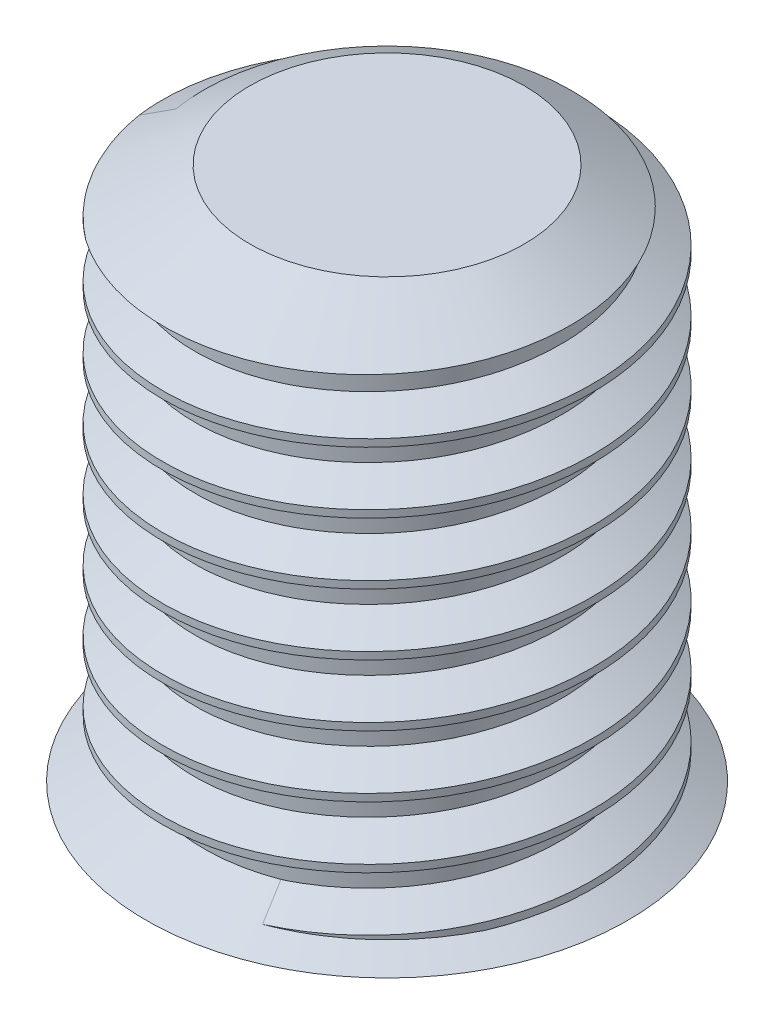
ISO-10303-21;
HEADER;
FILE_DESCRIPTION(('STEP AP214'),'2;1');
FILE_NAME('part.step','',(''),(''),'','','');
FILE_SCHEMA(('AUTOMOTIVE_DESIGN { 1 0 10303 214 1 1 1 1 }'));
ENDSEC;
DATA;
#1=APPLICATION_CONTEXT('core data for automotive mechanical design processes');
#2=APPLICATION_PROTOCOL_DEFINITION('international standard','automotive_design',2000,#1);
#3=PRODUCT_CONTEXT('',#1,'mechanical');
#4=PRODUCT('Part','Part','',(#3));
#5=PRODUCT_RELATED_PRODUCT_CATEGORY('part','',(#4));
#6=PRODUCT_DEFINITION_FORMATION('','',#4);
#7=PRODUCT_DEFINITION_CONTEXT('part definition',#1,'design');
#8=PRODUCT_DEFINITION('design','',#6,#7);
#9=PRODUCT_DEFINITION_SHAPE('','',#8);
#10=(LENGTH_UNIT() NAMED_UNIT(*) SI_UNIT(.MILLI.,.METRE.));
#11=(NAMED_UNIT(*) PLANE_ANGLE_UNIT() SI_UNIT($,.RADIAN.));
#12=(NAMED_UNIT(*) SI_UNIT($,.STERADIAN.) SOLID_ANGLE_UNIT());
#13=UNCERTAINTY_MEASURE_WITH_UNIT(LENGTH_MEASURE(1.E-05),#10,'distance_accuracy_value','');
#14=(GEOMETRIC_REPRESENTATION_CONTEXT(3) GLOBAL_UNCERTAINTY_ASSIGNED_CONTEXT((#13)) GLOBAL_UNIT_ASSIGNED_CONTEXT((#10,
#11,#12)) REPRESENTATION_CONTEXT('',''));
#15=CARTESIAN_POINT('',(0.,0.,0.));
#16=DIRECTION('',(0.,0.,1.));
#17=DIRECTION('',(1.,0.,0.));
#18=AXIS2_PLACEMENT_3D('',#15,#16,#17);
#19=CARTESIAN_POINT('',(0.,0.,0.));
#20=DIRECTION('',(0.,-1.,0.));
#21=DIRECTION('',(0.,0.,-1.));
#22=AXIS2_PLACEMENT_3D('',#19,#20,#21);
#23=PLANE('',#22);
#24=CARTESIAN_POINT('',(0.,0.,0.));
#25=DIRECTION('',(0.,-1.,0.));
#26=DIRECTION('',(0.,0.,-1.));
#27=AXIS2_PLACEMENT_3D('',#24,#25,#26);
#28=CIRCLE('',#27,3.556);
#29=CARTESIAN_POINT('',(0.,0.,-3.556));
#30=VERTEX_POINT('',#29);
#31=EDGE_CURVE('E159',#30,#30,#28,.T.);
#32=ORIENTED_EDGE('',*,*,#31,.T.);
#33=EDGE_LOOP('',(#32));
#34=FACE_BOUND('',#33,.T.);
#35=ADVANCED_FACE('F33',(#34),#23,.T.);
#36=CARTESIAN_POINT('',(0.,0.,0.));
#37=DIRECTION('',(0.,-1.,0.));
#38=DIRECTION('',(0.,0.,-1.));
#39=AXIS2_PLACEMENT_3D('',#36,#37,#38);
#40=CONICAL_SURFACE('',#39,3.556,1.0471975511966);
#41=ORIENTED_EDGE('',*,*,#31,.F.);
#42=EDGE_LOOP('',(#41));
#43=FACE_BOUND('',#42,.T.);
#44=CARTESIAN_POINT('',(0.,0.491267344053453,0.));
#45=DIRECTION('',(0.,-1.,0.));
#46=DIRECTION('',(0.,0.,-1.));
#47=AXIS2_PLACEMENT_3D('',#44,#45,#46);
#48=CIRCLE('',#47,2.7051);
#49=CARTESIAN_POINT('',(0.961613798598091,0.491267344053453,2.52841153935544));
#50=VERTEX_POINT('',#49);
#51=CARTESIAN_POINT('',(-2.66903831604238,0.491267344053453,0.440227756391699));
#52=VERTEX_POINT('',#51);
#53=EDGE_CURVE('E156',#50,#52,#48,.T.);
#54=ORIENTED_EDGE('',*,*,#53,.T.);
#55=CARTESIAN_POINT('',(-2.66903831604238,0.491267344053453,0.4402277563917));
#56=CARTESIAN_POINT('',(-2.67694317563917,0.490255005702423,0.403078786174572));
#57=CARTESIAN_POINT('',(-2.68405406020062,0.489249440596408,0.365761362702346));
#58=CARTESIAN_POINT('',(-2.69667970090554,0.487251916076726,0.290859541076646));
#59=CARTESIAN_POINT('',(-2.70219455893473,0.486259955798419,0.253275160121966));
#60=CARTESIAN_POINT('',(-2.71161969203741,0.484289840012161,0.177914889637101));
#61=CARTESIAN_POINT('',(-2.71553040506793,0.483311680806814,0.140139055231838));
#62=CARTESIAN_POINT('',(-2.72172889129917,0.481378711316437,0.0644561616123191));
#63=CARTESIAN_POINT('',(-2.72401662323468,0.480423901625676,0.026549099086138));
#64=CARTESIAN_POINT('',(-2.72851794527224,0.477549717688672,-0.0872258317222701));
#65=CARTESIAN_POINT('',(-2.72837638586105,0.475619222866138,-0.163202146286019));
#66=CARTESIAN_POINT('',(-2.72187968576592,0.471707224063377,-0.314863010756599));
#67=CARTESIAN_POINT('',(-2.7155240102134,0.469725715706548,-0.390547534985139));
#68=CARTESIAN_POINT('',(-2.68699073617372,0.463706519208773,-0.617645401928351));
#69=CARTESIAN_POINT('',(-2.65530291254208,0.459622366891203,-0.767984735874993));
#70=CARTESIAN_POINT('',(-2.56761130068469,0.451450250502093,-1.06123826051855));
#71=CARTESIAN_POINT('',(-2.5116139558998,0.44736228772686,-1.20415440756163));
#72=CARTESIAN_POINT('',(-2.37550543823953,0.439213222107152,-1.48143228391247));
#73=CARTESIAN_POINT('',(-2.29496736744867,0.435154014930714,-1.61558687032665));
#74=CARTESIAN_POINT('',(-2.15823581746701,0.429228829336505,-1.80515155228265));
#75=CARTESIAN_POINT('',(-2.10997063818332,0.4272799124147,-1.86642867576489));
#76=CARTESIAN_POINT('',(-2.00843545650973,0.423450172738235,-1.98471742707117));
#77=CARTESIAN_POINT('',(-1.95516509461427,0.421569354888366,-2.04172874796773));
#78=CARTESIAN_POINT('',(-1.84397803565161,0.417732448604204,-2.15144656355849));
#79=CARTESIAN_POINT('',(-1.78604483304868,0.415776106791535,-2.20413630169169));
#80=CARTESIAN_POINT('',(-1.66606150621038,0.411831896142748,-2.30460947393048));
#81=CARTESIAN_POINT('',(-1.60401011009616,0.40984401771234,-2.35239138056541));
#82=CARTESIAN_POINT('',(-1.41233352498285,0.403846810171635,-2.48784497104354));
#83=CARTESIAN_POINT('',(-1.2770723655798,0.39979998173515,-2.56773643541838));
#84=CARTESIAN_POINT('',(-0.99101598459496,0.391603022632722,-2.70651719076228));
#85=CARTESIAN_POINT('',(-0.839867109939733,0.387453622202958,-2.76467102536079));
#86=CARTESIAN_POINT('',(-0.529810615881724,0.379290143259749,-2.85477609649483));
#87=CARTESIAN_POINT('',(-0.370903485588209,0.375276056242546,-2.88672898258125));
#88=CARTESIAN_POINT('',(-0.170625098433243,0.370410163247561,-2.9097125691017));
#89=CARTESIAN_POINT('',(-0.130481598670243,0.369444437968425,-2.91346173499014));
#90=CARTESIAN_POINT('',(-0.0500730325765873,0.367535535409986,-2.91925759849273));
#91=CARTESIAN_POINT('',(-0.0098079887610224,0.366592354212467,-2.92130459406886));
#92=CARTESIAN_POINT('',(0.111067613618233,0.363745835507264,-2.92497444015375));
#93=CARTESIAN_POINT('',(0.191763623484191,0.361825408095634,-2.924126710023));
#94=CARTESIAN_POINT('',(0.352841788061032,0.357938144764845,-2.91586777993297));
#95=CARTESIAN_POINT('',(0.433223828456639,0.355971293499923,-2.90845437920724));
#96=CARTESIAN_POINT('',(0.593097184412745,0.352009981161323,-2.88711340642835));
#97=CARTESIAN_POINT('',(0.672588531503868,0.350015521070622,-2.87318606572));
#98=CARTESIAN_POINT('',(0.91319872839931,0.343901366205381,-2.82082123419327));
#99=CARTESIAN_POINT('',(1.07218255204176,0.339754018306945,-2.7720144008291));
#100=CARTESIAN_POINT('',(1.37971935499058,0.331513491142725,-2.64856778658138));
#101=CARTESIAN_POINT('',(1.52827580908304,0.327420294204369,-2.57393666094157));
#102=CARTESIAN_POINT('',(1.74064706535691,0.321389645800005,-2.44400128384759));
#103=CARTESIAN_POINT('',(1.80995611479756,0.31938964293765,-2.39746292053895));
#104=CARTESIAN_POINT('',(1.94442747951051,0.315444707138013,-2.29870299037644));
#105=CARTESIAN_POINT('',(2.00958982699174,0.313499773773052,-2.24648146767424));
#106=CARTESIAN_POINT('',(2.13530986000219,0.309670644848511,-2.13672715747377));
#107=CARTESIAN_POINT('',(2.19586573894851,0.307786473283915,-2.07919230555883));
#108=CARTESIAN_POINT('',(2.31211222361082,0.303947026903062,-1.95940191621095));
#109=CARTESIAN_POINT('',(2.36780254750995,0.301991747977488,-1.89714610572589));
#110=CARTESIAN_POINT('',(2.4745998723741,0.298025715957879,-1.76745511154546));
#111=CARTESIAN_POINT('',(2.52563839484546,0.296014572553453,-1.69996342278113));
#112=CARTESIAN_POINT('',(2.6219572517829,0.291969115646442,-1.56101883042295));
#113=CARTESIAN_POINT('',(2.66723783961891,0.289934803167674,-1.48956610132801));
#114=CARTESIAN_POINT('',(2.7939347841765,0.283822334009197,-1.27001971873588));
#115=CARTESIAN_POINT('',(2.86632853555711,0.27973010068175,-1.11658915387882));
#116=CARTESIAN_POINT('',(2.98601923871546,0.271542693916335,-0.796719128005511));
#117=CARTESIAN_POINT('',(3.03278626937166,0.267449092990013,-0.630081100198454));
#118=CARTESIAN_POINT('',(3.08147445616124,0.261457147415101,-0.37611682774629));
#119=CARTESIAN_POINT('',(3.09412810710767,0.259483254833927,-0.290733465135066));
#120=CARTESIAN_POINT('',(3.10768901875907,0.256565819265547,-0.162086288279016));
#121=CARTESIAN_POINT('',(3.11130615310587,0.25560047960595,-0.119104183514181));
#122=CARTESIAN_POINT('',(3.11671758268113,0.253690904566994,-0.0330246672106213));
#123=CARTESIAN_POINT('',(3.11851177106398,0.252746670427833,0.010072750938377));
#124=CARTESIAN_POINT('',(3.12125180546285,0.24989048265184,0.13949241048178));
#125=CARTESIAN_POINT('',(3.1195492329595,0.247956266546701,0.225884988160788));
#126=CARTESIAN_POINT('',(3.10908619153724,0.244046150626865,0.398240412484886));
#127=CARTESIAN_POINT('',(3.10032494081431,0.24207024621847,0.484203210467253));
#128=CARTESIAN_POINT('',(3.07581957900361,0.23809224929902,0.655022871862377));
#129=CARTESIAN_POINT('',(3.0600838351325,0.236090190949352,0.739880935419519));
#130=CARTESIAN_POINT('',(3.02174152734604,0.2320723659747,0.907995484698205));
#131=CARTESIAN_POINT('',(2.99913811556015,0.230056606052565,0.991252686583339));
#132=CARTESIAN_POINT('',(2.95581435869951,0.226692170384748,1.12841157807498));
#133=CARTESIAN_POINT('',(2.93694810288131,0.225343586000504,1.18290636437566));
#134=CARTESIAN_POINT('',(2.8963026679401,0.222652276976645,1.29069320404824));
#135=CARTESIAN_POINT('',(2.87452847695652,0.221309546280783,1.34398713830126));
#136=CARTESIAN_POINT('',(2.85131327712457,0.219970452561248,1.39665228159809));
#137=B_SPLINE_CURVE_WITH_KNOTS('',3,(#55,#56,#57,#58,#59,#60,#61,#62,#63,#64,#65,#66,#67,#68,
#69,#70,#71,#72,#73,#74,#75,#76,#77,#78,#79,#80,#81,#82,#83,#84,#85,#86,#87,#88,#89,#90,#91,#92,
#93,#94,#95,#96,#97,#98,#99,#100,#101,#102,#103,#104,#105,#106,#107,#108,#109,#110,#111,#112,
#113,#114,#115,#116,#117,#118,#119,#120,#121,#122,#123,#124,#125,#126,#127,#128,#129,#130,#131,
#132,#133,#134,#135,#136),.UNSPECIFIED.,.F.,.F.,(4,2,2,2,2,2,2,2,2,2,2,2,2,2,2,2,2,2,2,2,2,2,2,
2,2,2,2,2,2,2,2,2,2,2,2,2,2,2,2,2,4),(0.,0.113972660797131,0.227938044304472,0.341872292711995,
0.45580943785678,0.68351883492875,0.911247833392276,1.37002430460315,1.82867924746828,
2.29581841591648,2.52967023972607,2.76353887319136,2.99827520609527,3.23308437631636,
3.70222991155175,4.18605644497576,4.66985251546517,4.79082395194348,4.91177420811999,
5.15365972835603,5.39562635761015,5.63758439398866,6.13417767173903,6.6306046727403,
6.8808804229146,7.13115422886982,7.38152568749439,7.63191163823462,7.88553115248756,
8.13913950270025,8.64578565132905,9.16254712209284,9.42128773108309,9.55068409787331,
9.68008804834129,9.93906758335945,10.1980758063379,10.4567741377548,10.7153539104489,
10.8883253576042,11.0610038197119),.UNSPECIFIED.);
#138=CARTESIAN_POINT('',(2.85131327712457,0.219970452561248,1.39665228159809));
#139=VERTEX_POINT('',#138);
#140=EDGE_CURVE('E59',#52,#139,#137,.T.);
#141=ORIENTED_EDGE('',*,*,#140,.T.);
#142=CARTESIAN_POINT('',(2.85131327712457,0.219970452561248,1.39665228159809));
#143=CARTESIAN_POINT('',(2.81949546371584,0.219970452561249,1.4616217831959));
#144=CARTESIAN_POINT('',(2.78544583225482,0.219970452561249,1.52550354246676));
#145=CARTESIAN_POINT('',(2.71299712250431,0.219970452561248,1.65091347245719));
#146=CARTESIAN_POINT('',(2.67458989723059,0.219970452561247,1.71243693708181));
#147=CARTESIAN_POINT('',(2.59362594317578,0.219970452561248,1.83275725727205));
#148=CARTESIAN_POINT('',(2.55106549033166,0.219970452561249,1.891551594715));
#149=CARTESIAN_POINT('',(2.41667157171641,0.219970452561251,2.06439491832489));
#150=CARTESIAN_POINT('',(2.31875972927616,0.219970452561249,2.1738060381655));
#151=CARTESIAN_POINT('',(2.10877059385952,0.219970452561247,2.3780589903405));
#152=CARTESIAN_POINT('',(1.99669384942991,0.219970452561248,2.47290138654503));
#153=CARTESIAN_POINT('',(1.82165180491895,0.219970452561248,2.60138967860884));
#154=CARTESIAN_POINT('',(1.76322352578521,0.219970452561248,2.64133997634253));
#155=CARTESIAN_POINT('',(1.64387009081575,0.219970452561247,2.71722448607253));
#156=CARTESIAN_POINT('',(1.58294706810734,0.219970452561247,2.75316203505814));
#157=CARTESIAN_POINT('',(1.4576955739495,0.219970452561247,2.82151230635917));
#158=CARTESIAN_POINT('',(1.39332503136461,0.219970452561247,2.85384785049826));
#159=CARTESIAN_POINT('',(1.26248105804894,0.219970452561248,2.91409754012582));
#160=CARTESIAN_POINT('',(1.19600589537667,0.219970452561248,2.94200792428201));
#161=CARTESIAN_POINT('',(1.12865469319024,0.219970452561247,2.96761917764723));
#162=B_SPLINE_CURVE_WITH_KNOTS('',3,(#142,#143,#144,#145,#146,#147,#148,#149,#150,#151,#152,
#153,#154,#155,#156,#157,#158,#159,#160,#161),.UNSPECIFIED.,.F.,.F.,(4,2,2,2,2,2,2,2,2,4),(0.,
0.216994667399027,0.434401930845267,0.65200595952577,1.09098601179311,1.52994906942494,
1.742160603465,1.95419432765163,2.17013622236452,2.38626069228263),.UNSPECIFIED.);
#163=CARTESIAN_POINT('',(1.1286546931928,0.219970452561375,2.96761917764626));
#164=VERTEX_POINT('',#163);
#165=EDGE_CURVE('E45',#139,#164,#162,.T.);
#166=ORIENTED_EDGE('',*,*,#165,.T.);
#167=CARTESIAN_POINT('',(1.12865469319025,0.219970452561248,2.96761917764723));
#168=CARTESIAN_POINT('',(1.11306671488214,0.245287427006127,2.92663305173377));
#169=CARTESIAN_POINT('',(1.09747873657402,0.270604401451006,2.88564692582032));
#170=CARTESIAN_POINT('',(1.06630277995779,0.321238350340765,2.8036746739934));
#171=CARTESIAN_POINT('',(1.05071480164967,0.346555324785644,2.76268854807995));
#172=CARTESIAN_POINT('',(1.0106224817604,0.411670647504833,2.65727212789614));
#173=CARTESIAN_POINT('',(0.98611814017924,0.451468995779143,2.59284183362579));
#174=CARTESIAN_POINT('',(0.961613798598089,0.491267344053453,2.52841153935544));
#175=B_SPLINE_CURVE_WITH_KNOTS('',3,(#167,#168,#169,#170,#171,#172,#173,#174),.UNSPECIFIED.,.F.,
.F.,(4,2,2,4),(0.,0.151901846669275,0.30380369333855,0.54259378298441),.UNSPECIFIED.);
#176=EDGE_CURVE('E94',#164,#50,#175,.T.);
#177=ORIENTED_EDGE('',*,*,#176,.T.);
#178=EDGE_LOOP('',(#54,#141,#166,#177));
#179=FACE_BOUND('',#178,.T.);
#180=ADVANCED_FACE('F122',(#43,#179),#40,.T.);
#181=CARTESIAN_POINT('',(0.,7.493,0.));
#182=DIRECTION('',(0.,-1.,0.));
#183=DIRECTION('',(0.,0.,-1.));
#184=AXIS2_PLACEMENT_3D('',#181,#182,#183);
#185=CONICAL_SURFACE('',#184,2.7051,1.0471975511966);
#186=CARTESIAN_POINT('',(0.,7.49579663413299,-2.70025608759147));
#187=CARTESIAN_POINT('',(0.0772042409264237,7.49383987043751,-2.7036528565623));
#188=CARTESIAN_POINT('',(0.154548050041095,7.49185217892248,-2.70377705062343));
#189=CARTESIAN_POINT('',(0.308967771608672,7.48783025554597,-2.69751329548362));
#190=CARTESIAN_POINT('',(0.386043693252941,7.48579602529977,-2.69112557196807));
#191=CARTESIAN_POINT('',(0.53934301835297,7.48169735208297,-2.67187662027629));
#192=CARTESIAN_POINT('',(0.61556687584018,7.47963292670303,-2.65901902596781));
#193=CARTESIAN_POINT('',(0.766640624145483,7.47548873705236,-2.62693714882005));
#194=CARTESIAN_POINT('',(0.841490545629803,7.47340897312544,-2.60771300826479));
#195=CARTESIAN_POINT('',(1.06324993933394,7.46716669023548,-2.54065009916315));
#196=CARTESIAN_POINT('',(1.20743194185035,7.46299949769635,-2.48341288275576));
#197=CARTESIAN_POINT('',(1.48404732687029,7.45478219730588,-2.34552869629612));
#198=CARTESIAN_POINT('',(1.61648574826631,7.45073203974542,-2.26489183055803));
#199=CARTESIAN_POINT('',(1.80345906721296,7.44481859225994,-2.12826799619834));
#200=CARTESIAN_POINT('',(1.86383822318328,7.44287433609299,-2.08011313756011));
#201=CARTESIAN_POINT('',(1.95119744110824,7.44001847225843,-2.00418972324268));
#202=CARTESIAN_POINT('',(1.97978443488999,7.43907653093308,-1.97826449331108));
#203=CARTESIAN_POINT('',(2.03588343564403,7.43718019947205,-1.92526697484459));
#204=CARTESIAN_POINT('',(2.06339518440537,7.4362258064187,-1.89819441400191));
#205=CARTESIAN_POINT('',(2.14425564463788,7.43334349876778,-1.81531771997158));
#206=CARTESIAN_POINT('',(2.19592812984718,7.43139650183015,-1.75785582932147));
#207=CARTESIAN_POINT('',(2.29442967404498,7.42746810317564,-1.63892895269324));
#208=CARTESIAN_POINT('',(2.34125713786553,7.4254866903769,-1.57746265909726));
#209=CARTESIAN_POINT('',(2.47606113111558,7.41941722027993,-1.3846703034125));
#210=CARTESIAN_POINT('',(2.55588218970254,7.41529217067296,-1.24748364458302));
#211=CARTESIAN_POINT('',(2.69157400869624,7.40707374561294,-0.961937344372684));
#212=CARTESIAN_POINT('',(2.74745481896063,7.40298035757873,-0.813582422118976));
#213=CARTESIAN_POINT('',(2.83437387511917,7.39487980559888,-0.507653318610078));
#214=CARTESIAN_POINT('',(2.86510228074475,7.39087429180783,-0.349989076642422));
#215=CARTESIAN_POINT('',(2.88670604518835,7.38602191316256,-0.151327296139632));
#216=CARTESIAN_POINT('',(2.89018891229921,7.38505804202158,-0.111468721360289));
#217=CARTESIAN_POINT('',(2.89546554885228,7.3831515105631,-0.0316410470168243));
#218=CARTESIAN_POINT('',(2.8972596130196,7.38220884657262,0.00832803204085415));
#219=CARTESIAN_POINT('',(2.9001957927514,7.37935929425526,0.128301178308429));
#220=CARTESIAN_POINT('',(2.89889235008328,7.37743074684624,0.2083754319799));
#221=CARTESIAN_POINT('',(2.88972264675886,7.37351452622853,0.368882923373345));
#222=CARTESIAN_POINT('',(2.88179611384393,7.37152647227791,0.449312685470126));
#223=CARTESIAN_POINT('',(2.85936564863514,7.36752253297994,0.609227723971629));
#224=CARTESIAN_POINT('',(2.84486207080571,7.36550664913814,0.688713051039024));
#225=CARTESIAN_POINT('',(2.79161648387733,7.3594392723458,0.92491944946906));
#226=CARTESIAN_POINT('',(2.74313033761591,7.35536415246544,1.07955070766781));
#227=CARTESIAN_POINT('',(2.61990296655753,7.34716517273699,1.38253811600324));
#228=CARTESIAN_POINT('',(2.54453331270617,7.34304265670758,1.53063935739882));
#229=CARTESIAN_POINT('',(2.41374657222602,7.33699036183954,1.74160959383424));
#230=CARTESIAN_POINT('',(2.36716832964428,7.33499389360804,1.81010034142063));
#231=CARTESIAN_POINT('',(2.26839229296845,7.33105299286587,1.94294474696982));
#232=CARTESIAN_POINT('',(2.21619455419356,7.3291085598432,2.00729844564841));
#233=CARTESIAN_POINT('',(2.13401339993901,7.3262513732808,2.10029408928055));
#234=CARTESIAN_POINT('',(2.10598712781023,7.32530934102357,2.1306892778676));
#235=CARTESIAN_POINT('',(2.04872236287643,7.32340940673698,2.19031520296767));
#236=CARTESIAN_POINT('',(2.0194838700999,7.32245150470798,2.21954593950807));
#237=CARTESIAN_POINT('',(1.93001704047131,7.31956027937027,2.30541181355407));
#238=CARTESIAN_POINT('',(1.86802796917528,7.31760911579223,2.36023121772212));
#239=CARTESIAN_POINT('',(1.73977894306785,7.31367155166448,2.4646456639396));
#240=CARTESIAN_POINT('',(1.67351801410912,7.31168514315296,2.51423950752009));
#241=CARTESIAN_POINT('',(1.53719568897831,7.30769219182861,2.60785677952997));
#242=CARTESIAN_POINT('',(1.4671343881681,7.30568564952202,2.65188034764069));
#243=CARTESIAN_POINT('',(1.24732643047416,7.2995270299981,2.7777736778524));
#244=CARTESIAN_POINT('',(1.0920029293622,7.29536040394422,2.85015959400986));
#245=CARTESIAN_POINT('',(0.771459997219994,7.28711502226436,2.96782244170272));
#246=CARTESIAN_POINT('',(0.606243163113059,7.28303624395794,3.01310645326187));
#247=CARTESIAN_POINT('',(0.354489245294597,7.27706539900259,3.05983174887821));
#248=CARTESIAN_POINT('',(0.269809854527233,7.27509734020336,3.07187510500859));
#249=CARTESIAN_POINT('',(0.142254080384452,7.27219084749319,3.08456919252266));
#250=CARTESIAN_POINT('',(0.0996409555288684,7.27122950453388,3.08790547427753));
#251=CARTESIAN_POINT('',(0.0143112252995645,7.26932512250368,3.09277817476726));
#252=CARTESIAN_POINT('',(-0.0284053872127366,7.2683820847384,3.09431446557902));
#253=CARTESIAN_POINT('',(-0.156638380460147,7.26552741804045,3.09631128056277));
#254=CARTESIAN_POINT('',(-0.242212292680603,7.26359078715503,3.09415725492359));
#255=CARTESIAN_POINT('',(-0.412865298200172,7.25967992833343,3.08287482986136));
#256=CARTESIAN_POINT('',(-0.497944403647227,7.25770570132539,3.07374660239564));
#257=CARTESIAN_POINT('',(-0.754723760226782,7.25166868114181,3.03551273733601));
#258=CARTESIAN_POINT('',(-0.924925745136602,7.24755933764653,2.99550871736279));
#259=CARTESIAN_POINT('',(-1.25611270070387,7.23934929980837,2.88788520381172));
#260=CARTESIAN_POINT('',(-1.41711008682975,7.23524860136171,2.82030395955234));
#261=CARTESIAN_POINT('',(-1.63262227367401,7.22960030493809,2.70800606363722));
#262=CARTESIAN_POINT('',(-1.69289837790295,7.2280017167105,2.67401336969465));
#263=CARTESIAN_POINT('',(-1.81097940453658,7.22483155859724,2.60218220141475));
#264=CARTESIAN_POINT('',(-1.86878820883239,7.22325994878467,2.56435011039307));
#265=CARTESIAN_POINT('',(-1.92531164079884,7.2217031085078,2.52463860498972));
#266=B_SPLINE_CURVE_WITH_KNOTS('',3,(#186,#187,#188,#189,#190,#191,#192,#193,#194,#195,#196,
#197,#198,#199,#200,#201,#202,#203,#204,#205,#206,#207,#208,#209,#210,#211,#212,#213,#214,#215,
#216,#217,#218,#219,#220,#221,#222,#223,#224,#225,#226,#227,#228,#229,#230,#231,#232,#233,#234,
#235,#236,#237,#238,#239,#240,#241,#242,#243,#244,#245,#246,#247,#248,#249,#250,#251,#252,#253,
#254,#255,#256,#257,#258,#259,#260,#261,#262,#263,#264,#265),.UNSPECIFIED.,.F.,.F.,(4,2,2,2,2,2,
2,2,2,2,2,2,2,2,2,2,2,2,2,2,2,2,2,2,2,2,2,2,2,2,2,2,2,2,2,2,2,2,2,4),(0.,0.231836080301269,
0.463664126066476,0.695362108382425,0.927054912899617,1.39025266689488,1.85325070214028,
2.08476756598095,2.20054465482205,2.3163493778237,2.5479645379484,2.77965571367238,
3.25354373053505,3.72723261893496,4.20667237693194,4.32672104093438,4.44674875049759,
4.68679130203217,4.9290424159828,5.17128047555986,5.65528218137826,6.15143178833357,
6.39975104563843,6.64806785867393,6.77210321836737,6.89613857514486,7.14416693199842,
7.39225205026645,7.6403309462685,8.15198006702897,8.66349546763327,8.91988500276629,
9.04811018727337,9.17634448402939,9.43289010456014,9.68942939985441,10.2115220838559,
10.7328930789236,10.9404278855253,11.1476231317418),.UNSPECIFIED.);
#267=CARTESIAN_POINT('',(0.10961915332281,7.493,-2.70287803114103));
#268=VERTEX_POINT('',#267);
#269=CARTESIAN_POINT('',(-1.92531164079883,7.2217031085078,2.52463860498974));
#270=VERTEX_POINT('',#269);
#271=EDGE_CURVE('E79',#268,#270,#266,.T.);
#272=ORIENTED_EDGE('',*,*,#271,.F.);
#273=CARTESIAN_POINT('',(0.,7.493,0.));
#274=DIRECTION('',(0.,-1.,0.));
#275=DIRECTION('',(0.,0.,-1.));
#276=AXIS2_PLACEMENT_3D('',#273,#274,#275);
#277=CIRCLE('',#276,2.7051);
#278=CARTESIAN_POINT('',(-2.66685689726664,7.493,0.453255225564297));
#279=VERTEX_POINT('',#278);
#280=EDGE_CURVE('E154',#279,#268,#277,.T.);
#281=ORIENTED_EDGE('',*,*,#280,.F.);
#282=CARTESIAN_POINT('',(-3.13011372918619,7.2217031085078,0.531989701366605));
#283=CARTESIAN_POINT('',(-3.08688337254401,7.24702008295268,0.524642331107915));
#284=CARTESIAN_POINT('',(-3.04365301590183,7.27233705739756,0.517294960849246));
#285=CARTESIAN_POINT('',(-2.95719230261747,7.32297100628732,0.502600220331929));
#286=CARTESIAN_POINT('',(-2.91396194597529,7.3482879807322,0.495252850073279));
#287=CARTESIAN_POINT('',(-2.79442638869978,7.41829153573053,0.474936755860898));
#288=CARTESIAN_POINT('',(-2.71812118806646,7.46297811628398,0.461968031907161));
#289=CARTESIAN_POINT('',(-2.64181598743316,7.50766469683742,0.448999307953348));
#290=B_SPLINE_CURVE_WITH_KNOTS('',3,(#282,#283,#284,#285,#286,#287,#288,#289),.UNSPECIFIED.,.F.,
.F.,(4,2,2,4),(0.,0.151901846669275,0.30380369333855,0.571923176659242),.UNSPECIFIED.);
#291=CARTESIAN_POINT('',(-3.13011372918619,7.2217031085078,0.531989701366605));
#292=VERTEX_POINT('',#291);
#293=EDGE_CURVE('E52',#292,#279,#290,.T.);
#294=ORIENTED_EDGE('',*,*,#293,.F.);
#295=CARTESIAN_POINT('',(-1.92531164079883,7.2217031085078,2.52463860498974));
#296=CARTESIAN_POINT('',(-1.98283877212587,7.2217031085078,2.48077473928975));
#297=CARTESIAN_POINT('',(-2.03886425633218,7.2217031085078,2.43493369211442));
#298=CARTESIAN_POINT('',(-2.14775946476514,7.2217031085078,2.33944394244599));
#299=CARTESIAN_POINT('',(-2.20062298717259,7.2217031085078,2.28978816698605));
#300=CARTESIAN_POINT('',(-2.30286740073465,7.2217031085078,2.18693768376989));
#301=CARTESIAN_POINT('',(-2.35224509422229,7.2217031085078,2.13373981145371));
#302=CARTESIAN_POINT('',(-2.49559885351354,7.2217031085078,1.96825158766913));
#303=CARTESIAN_POINT('',(-2.58384184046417,7.2217031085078,1.85090271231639));
#304=CARTESIAN_POINT('',(-2.74327803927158,7.2217031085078,1.60514905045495));
#305=CARTESIAN_POINT('',(-2.81447196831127,7.22170310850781,1.47674472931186));
#306=CARTESIAN_POINT('',(-2.90629677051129,7.22170310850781,1.2802528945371));
#307=CARTESIAN_POINT('',(-2.93401024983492,7.2217031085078,1.21539409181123));
#308=CARTESIAN_POINT('',(-2.98504308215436,7.2217031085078,1.08402054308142));
#309=CARTESIAN_POINT('',(-3.00836609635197,7.2217031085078,1.01750722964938));
#310=CARTESIAN_POINT('',(-3.05092017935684,7.2217031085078,0.881848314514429));
#311=CARTESIAN_POINT('',(-3.07006856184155,7.2217031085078,0.812676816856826));
#312=CARTESIAN_POINT('',(-3.10365441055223,7.2217031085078,0.673137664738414));
#313=CARTESIAN_POINT('',(-3.11808788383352,7.2217031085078,0.60276904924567));
#314=CARTESIAN_POINT('',(-3.13011372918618,7.2217031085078,0.531989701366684));
#315=B_SPLINE_CURVE_WITH_KNOTS('',3,(#295,#296,#297,#298,#299,#300,#301,#302,#303,#304,#305,
#306,#307,#308,#309,#310,#311,#312,#313,#314),.UNSPECIFIED.,.F.,.F.,(4,2,2,2,2,2,2,2,2,4),(0.,
0.216994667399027,0.434401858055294,0.652005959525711,1.09098674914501,1.52994906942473,
1.7414151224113,1.95270404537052,2.16785925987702,2.38319621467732),.UNSPECIFIED.);
#316=EDGE_CURVE('E11',#270,#292,#315,.T.);
#317=ORIENTED_EDGE('',*,*,#316,.F.);
#318=EDGE_LOOP('',(#272,#281,#294,#317));
#319=FACE_BOUND('',#318,.T.);
#320=CARTESIAN_POINT('',(0.,7.88518805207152,0.));
#321=DIRECTION('',(0.,-1.,0.));
#322=DIRECTION('',(0.,0.,-1.));
#323=AXIS2_PLACEMENT_3D('',#320,#321,#322);
#324=CIRCLE('',#323,2.02581036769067);
#325=CARTESIAN_POINT('',(0.,7.88518805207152,-2.02581036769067));
#326=VERTEX_POINT('',#325);
#327=EDGE_CURVE('E157',#326,#326,#324,.T.);
#328=ORIENTED_EDGE('',*,*,#327,.T.);
#329=EDGE_LOOP('',(#328));
#330=FACE_BOUND('',#329,.T.);
#331=ADVANCED_FACE('F77',(#319,#330),#185,.T.);
#332=CARTESIAN_POINT('',(0.,0.,0.));
#333=DIRECTION('',(0.,-1.,0.));
#334=DIRECTION('',(0.,0.,-1.));
#335=AXIS2_PLACEMENT_3D('',#332,#333,#334);
#336=CYLINDRICAL_SURFACE('',#335,2.7051);
#337=CARTESIAN_POINT('',(0.,-0.665692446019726,-2.7051));
#338=CARTESIAN_POINT('',(-1.12048910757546,-0.608996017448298,-2.7051));
#339=CARTESIAN_POINT('',(-1.91279455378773,-0.552299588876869,-1.91279455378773));
#340=CARTESIAN_POINT('',(-2.7051,-0.495603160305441,-1.12048910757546));
#341=CARTESIAN_POINT('',(-2.7051,-0.438906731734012,0.));
#342=CARTESIAN_POINT('',(-2.7051,-0.382210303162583,1.12048910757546));
#343=CARTESIAN_POINT('',(-1.91279455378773,-0.325513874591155,1.91279455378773));
#344=CARTESIAN_POINT('',(-1.12048910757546,-0.268817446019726,2.7051));
#345=CARTESIAN_POINT('',(0.,-0.212121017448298,2.7051));
#346=CARTESIAN_POINT('',(1.12048910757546,-0.155424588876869,2.7051));
#347=CARTESIAN_POINT('',(1.91279455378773,-0.0987281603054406,1.91279455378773));
#348=CARTESIAN_POINT('',(2.7051,-0.042031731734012,1.12048910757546));
#349=CARTESIAN_POINT('',(2.7051,0.0146646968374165,0.));
#350=CARTESIAN_POINT('',(2.7051,0.0713611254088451,-1.12048910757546));
#351=CARTESIAN_POINT('',(1.91279455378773,0.128057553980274,-1.91279455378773));
#352=CARTESIAN_POINT('',(1.12048910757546,0.184753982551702,-2.7051));
#353=CARTESIAN_POINT('',(0.,0.241450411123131,-2.7051));
#354=CARTESIAN_POINT('',(-1.12048910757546,0.298146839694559,-2.7051));
#355=CARTESIAN_POINT('',(-1.91279455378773,0.354843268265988,-1.91279455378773));
#356=CARTESIAN_POINT('',(-2.7051,0.411539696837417,-1.12048910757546));
#357=CARTESIAN_POINT('',(-2.7051,0.468236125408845,0.));
#358=CARTESIAN_POINT('',(-2.7051,0.524932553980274,1.12048910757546));
#359=CARTESIAN_POINT('',(-1.91279455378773,0.581628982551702,1.91279455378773));
#360=CARTESIAN_POINT('',(-1.12048910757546,0.638325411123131,2.7051));
#361=CARTESIAN_POINT('',(0.,0.695021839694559,2.7051));
#362=CARTESIAN_POINT('',(1.12048910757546,0.751718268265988,2.7051));
#363=CARTESIAN_POINT('',(1.91279455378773,0.808414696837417,1.91279455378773));
#364=CARTESIAN_POINT('',(2.7051,0.865111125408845,1.12048910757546));
#365=CARTESIAN_POINT('',(2.7051,0.921807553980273,0.));
#366=CARTESIAN_POINT('',(2.7051,0.978503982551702,-1.12048910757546));
#367=CARTESIAN_POINT('',(1.91279455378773,1.03520041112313,-1.91279455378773));
#368=CARTESIAN_POINT('',(1.12048910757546,1.09189683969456,-2.7051));
#369=CARTESIAN_POINT('',(0.,1.14859326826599,-2.7051));
#370=CARTESIAN_POINT('',(-1.12048910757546,1.20528969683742,-2.7051));
#371=CARTESIAN_POINT('',(-1.91279455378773,1.26198612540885,-1.91279455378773));
#372=CARTESIAN_POINT('',(-2.7051,1.31868255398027,-1.12048910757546));
#373=CARTESIAN_POINT('',(-2.7051,1.3753789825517,0.));
#374=CARTESIAN_POINT('',(-2.7051,1.43207541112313,1.12048910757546));
#375=CARTESIAN_POINT('',(-1.91279455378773,1.48877183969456,1.91279455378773));
#376=CARTESIAN_POINT('',(-1.12048910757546,1.54546826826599,2.7051));
#377=CARTESIAN_POINT('',(0.,1.60216469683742,2.7051));
#378=CARTESIAN_POINT('',(1.12048910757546,1.65886112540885,2.7051));
#379=CARTESIAN_POINT('',(1.91279455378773,1.71555755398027,1.91279455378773));
#380=CARTESIAN_POINT('',(2.7051,1.7722539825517,1.12048910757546));
#381=CARTESIAN_POINT('',(2.7051,1.82895041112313,0.));
#382=CARTESIAN_POINT('',(2.7051,1.88564683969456,-1.12048910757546));
#383=CARTESIAN_POINT('',(1.91279455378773,1.94234326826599,-1.91279455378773));
#384=CARTESIAN_POINT('',(1.12048910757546,1.99903969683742,-2.7051));
#385=CARTESIAN_POINT('',(0.,2.05573612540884,-2.7051));
#386=CARTESIAN_POINT('',(-1.12048910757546,2.11243255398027,-2.7051));
#387=CARTESIAN_POINT('',(-1.91279455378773,2.1691289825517,-1.91279455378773));
#388=CARTESIAN_POINT('',(-2.7051,2.22582541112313,-1.12048910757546));
#389=CARTESIAN_POINT('',(-2.7051,2.28252183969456,0.));
#390=CARTESIAN_POINT('',(-2.7051,2.33921826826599,1.12048910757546));
#391=CARTESIAN_POINT('',(-1.91279455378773,2.39591469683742,1.91279455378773));
#392=CARTESIAN_POINT('',(-1.12048910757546,2.45261112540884,2.7051));
#393=CARTESIAN_POINT('',(0.,2.50930755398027,2.7051));
#394=CARTESIAN_POINT('',(1.12048910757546,2.5660039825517,2.7051));
#395=CARTESIAN_POINT('',(1.91279455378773,2.62270041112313,1.91279455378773));
#396=CARTESIAN_POINT('',(2.7051,2.67939683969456,1.12048910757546));
#397=CARTESIAN_POINT('',(2.7051,2.73609326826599,0.));
#398=CARTESIAN_POINT('',(2.7051,2.79278969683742,-1.12048910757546));
#399=CARTESIAN_POINT('',(1.91279455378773,2.84948612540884,-1.91279455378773));
#400=CARTESIAN_POINT('',(1.12048910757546,2.90618255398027,-2.7051));
#401=CARTESIAN_POINT('',(0.,2.9628789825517,-2.7051));
#402=CARTESIAN_POINT('',(-1.12048910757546,3.01957541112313,-2.7051));
#403=CARTESIAN_POINT('',(-1.91279455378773,3.07627183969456,-1.91279455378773));
#404=CARTESIAN_POINT('',(-2.7051,3.13296826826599,-1.12048910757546));
#405=CARTESIAN_POINT('',(-2.7051,3.18966469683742,0.));
#406=CARTESIAN_POINT('',(-2.7051,3.24636112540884,1.12048910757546));
#407=CARTESIAN_POINT('',(-1.91279455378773,3.30305755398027,1.91279455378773));
#408=CARTESIAN_POINT('',(-1.12048910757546,3.3597539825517,2.7051));
#409=CARTESIAN_POINT('',(0.,3.41645041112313,2.7051));
#410=CARTESIAN_POINT('',(1.12048910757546,3.47314683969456,2.7051));
#411=CARTESIAN_POINT('',(1.91279455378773,3.52984326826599,1.91279455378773));
#412=CARTESIAN_POINT('',(2.7051,3.58653969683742,1.12048910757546));
#413=CARTESIAN_POINT('',(2.7051,3.64323612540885,0.));
#414=CARTESIAN_POINT('',(2.7051,3.69993255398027,-1.12048910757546));
#415=CARTESIAN_POINT('',(1.91279455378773,3.7566289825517,-1.91279455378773));
#416=CARTESIAN_POINT('',(1.12048910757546,3.81332541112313,-2.7051));
#417=CARTESIAN_POINT('',(0.,3.87002183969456,-2.7051));
#418=CARTESIAN_POINT('',(-1.12048910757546,3.92671826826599,-2.7051));
#419=CARTESIAN_POINT('',(-1.91279455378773,3.98341469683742,-1.91279455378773));
#420=CARTESIAN_POINT('',(-2.7051,4.04011112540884,-1.12048910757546));
#421=CARTESIAN_POINT('',(-2.7051,4.09680755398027,0.));
#422=CARTESIAN_POINT('',(-2.7051,4.1535039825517,1.12048910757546));
#423=CARTESIAN_POINT('',(-1.91279455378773,4.21020041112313,1.91279455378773));
#424=CARTESIAN_POINT('',(-1.12048910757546,4.26689683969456,2.7051));
#425=CARTESIAN_POINT('',(0.,4.32359326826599,2.7051));
#426=CARTESIAN_POINT('',(1.12048910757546,4.38028969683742,2.7051));
#427=CARTESIAN_POINT('',(1.91279455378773,4.43698612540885,1.91279455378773));
#428=CARTESIAN_POINT('',(2.7051,4.49368255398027,1.12048910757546));
#429=CARTESIAN_POINT('',(2.7051,4.5503789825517,0.));
#430=CARTESIAN_POINT('',(2.7051,4.60707541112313,-1.12048910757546));
#431=CARTESIAN_POINT('',(1.91279455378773,4.66377183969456,-1.91279455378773));
#432=CARTESIAN_POINT('',(1.12048910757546,4.72046826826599,-2.7051));
#433=CARTESIAN_POINT('',(0.,4.77716469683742,-2.7051));
#434=CARTESIAN_POINT('',(-1.12048910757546,4.83386112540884,-2.7051));
#435=CARTESIAN_POINT('',(-1.91279455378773,4.89055755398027,-1.91279455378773));
#436=CARTESIAN_POINT('',(-2.7051,4.9472539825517,-1.12048910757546));
#437=CARTESIAN_POINT('',(-2.7051,5.00395041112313,0.));
#438=CARTESIAN_POINT('',(-2.7051,5.06064683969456,1.12048910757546));
#439=CARTESIAN_POINT('',(-1.91279455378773,5.11734326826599,1.91279455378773));
#440=CARTESIAN_POINT('',(-1.12048910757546,5.17403969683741,2.7051));
#441=CARTESIAN_POINT('',(0.,5.23073612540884,2.7051));
#442=CARTESIAN_POINT('',(1.12048910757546,5.28743255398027,2.7051));
#443=CARTESIAN_POINT('',(1.91279455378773,5.3441289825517,1.91279455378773));
#444=CARTESIAN_POINT('',(2.7051,5.40082541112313,1.12048910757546));
#445=CARTESIAN_POINT('',(2.7051,5.45752183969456,0.));
#446=CARTESIAN_POINT('',(2.7051,5.51421826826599,-1.12048910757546));
#447=CARTESIAN_POINT('',(1.91279455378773,5.57091469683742,-1.91279455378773));
#448=CARTESIAN_POINT('',(1.12048910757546,5.62761112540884,-2.7051));
#449=CARTESIAN_POINT('',(0.,5.68430755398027,-2.7051));
#450=CARTESIAN_POINT('',(-1.12048910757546,5.7410039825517,-2.7051));
#451=CARTESIAN_POINT('',(-1.91279455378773,5.79770041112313,-1.91279455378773));
#452=CARTESIAN_POINT('',(-2.7051,5.85439683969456,-1.12048910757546));
#453=CARTESIAN_POINT('',(-2.7051,5.91109326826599,0.));
#454=CARTESIAN_POINT('',(-2.7051,5.96778969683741,1.12048910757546));
#455=CARTESIAN_POINT('',(-1.91279455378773,6.02448612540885,1.91279455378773));
#456=CARTESIAN_POINT('',(-1.12048910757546,6.08118255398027,2.7051));
#457=CARTESIAN_POINT('',(0.,6.1378789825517,2.7051));
#458=CARTESIAN_POINT('',(1.12048910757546,6.19457541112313,2.7051));
#459=CARTESIAN_POINT('',(1.91279455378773,6.25127183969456,1.91279455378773));
#460=CARTESIAN_POINT('',(2.7051,6.30796826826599,1.12048910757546));
#461=CARTESIAN_POINT('',(2.7051,6.36466469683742,0.));
#462=CARTESIAN_POINT('',(2.7051,6.42136112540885,-1.12048910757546));
#463=CARTESIAN_POINT('',(1.91279455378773,6.47805755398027,-1.91279455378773));
#464=CARTESIAN_POINT('',(1.12048910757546,6.5347539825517,-2.7051));
#465=CARTESIAN_POINT('',(0.,6.59145041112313,-2.7051));
#466=CARTESIAN_POINT('',(-1.12048910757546,6.64814683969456,-2.7051));
#467=CARTESIAN_POINT('',(-1.91279455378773,6.70484326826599,-1.91279455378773));
#468=CARTESIAN_POINT('',(-2.7051,6.76153969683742,-1.12048910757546));
#469=CARTESIAN_POINT('',(-2.7051,6.81823612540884,0.));
#470=CARTESIAN_POINT('',(-2.7051,6.87493255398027,1.12048910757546));
#471=CARTESIAN_POINT('',(-1.91279455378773,6.9316289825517,1.91279455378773));
#472=CARTESIAN_POINT('',(-1.12048910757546,6.98832541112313,2.7051));
#473=CARTESIAN_POINT('',(0.,7.04502183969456,2.7051));
#474=CARTESIAN_POINT('',(1.12048910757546,7.10171826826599,2.7051));
#475=CARTESIAN_POINT('',(1.91279455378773,7.15841469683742,1.91279455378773));
#476=CARTESIAN_POINT('',(2.7051,7.21511112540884,1.12048910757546));
#477=CARTESIAN_POINT('',(2.7051,7.27180755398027,0.));
#478=CARTESIAN_POINT('',(2.7051,7.3285039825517,-1.12048910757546));
#479=CARTESIAN_POINT('',(1.91279455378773,7.38520041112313,-1.91279455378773));
#480=CARTESIAN_POINT('',(1.12048910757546,7.44189683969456,-2.7051));
#481=CARTESIAN_POINT('',(0.,7.49859326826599,-2.7051));
#482=(BOUNDED_CURVE() B_SPLINE_CURVE(2,(#337,#338,#339,#340,#341,#342,#343,#344,#345,#346,#347,
#348,#349,#350,#351,#352,#353,#354,#355,#356,#357,#358,#359,#360,#361,#362,#363,#364,#365,#366,
#367,#368,#369,#370,#371,#372,#373,#374,#375,#376,#377,#378,#379,#380,#381,#382,#383,#384,#385,
#386,#387,#388,#389,#390,#391,#392,#393,#394,#395,#396,#397,#398,#399,#400,#401,#402,#403,#404,
#405,#406,#407,#408,#409,#410,#411,#412,#413,#414,#415,#416,#417,#418,#419,#420,#421,#422,#423,
#424,#425,#426,#427,#428,#429,#430,#431,#432,#433,#434,#435,#436,#437,#438,#439,#440,#441,#442,
#443,#444,#445,#446,#447,#448,#449,#450,#451,#452,#453,#454,#455,#456,#457,#458,#459,#460,#461,
#462,#463,#464,#465,#466,#467,#468,#469,#470,#471,#472,#473,#474,#475,#476,#477,#478,#479,#480,
#481),.UNSPECIFIED.,.F.,.F.) B_SPLINE_CURVE_WITH_KNOTS((3,2,2,2,2,2,2,2,2,2,2,2,2,2,2,2,2,2,2,2,
2,2,2,2,2,2,2,2,2,2,2,2,2,2,2,2,2,2,2,2,2,2,2,2,2,2,2,2,2,2,2,2,2,2,2,2,2,2,2,2,2,2,2,2,2,2,2,2,
2,2,2,2,3),(0.,0.0138888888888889,0.0277777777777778,0.0416666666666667,0.0555555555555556,
0.0694444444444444,0.0833333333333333,0.0972222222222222,0.111111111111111,0.125,
0.138888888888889,0.152777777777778,0.166666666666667,0.180555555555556,0.194444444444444,
0.208333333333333,0.222222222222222,0.236111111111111,0.25,0.263888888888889,0.277777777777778,
0.291666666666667,0.305555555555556,0.319444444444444,0.333333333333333,0.347222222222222,
0.361111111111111,0.375,0.388888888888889,0.402777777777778,0.416666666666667,0.430555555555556,
0.444444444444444,0.458333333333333,0.472222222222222,0.486111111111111,0.5,0.513888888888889,
0.527777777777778,0.541666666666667,0.555555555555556,0.569444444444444,0.583333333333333,
0.597222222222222,0.611111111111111,0.625,0.638888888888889,0.652777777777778,0.666666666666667,
0.680555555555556,0.694444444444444,0.708333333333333,0.722222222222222,0.736111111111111,0.75,
0.763888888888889,0.777777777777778,0.791666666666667,0.805555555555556,0.819444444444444,
0.833333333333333,0.847222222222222,0.861111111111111,0.875,0.888888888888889,0.902777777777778,
0.916666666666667,0.930555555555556,0.944444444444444,0.958333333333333,0.972222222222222,
0.986111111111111,1.),
.UNSPECIFIED.) CURVE() GEOMETRIC_REPRESENTATION_ITEM() RATIONAL_B_SPLINE_CURVE((1.,
0.923879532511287,1.,0.923879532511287,1.,0.923879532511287,1.,0.923879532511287,1.,
0.923879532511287,1.,0.923879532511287,1.,0.923879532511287,1.,0.923879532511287,1.,
0.923879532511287,1.,0.923879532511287,1.,0.923879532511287,1.,0.923879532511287,1.,
0.923879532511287,1.,0.923879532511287,1.,0.923879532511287,1.,0.923879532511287,1.,
0.923879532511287,1.,0.923879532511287,1.,0.923879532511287,1.,0.923879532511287,1.,
0.923879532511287,1.,0.923879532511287,1.,0.923879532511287,1.,0.923879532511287,1.,
0.923879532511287,1.,0.923879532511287,1.,0.923879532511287,1.,0.923879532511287,1.,
0.923879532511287,1.,0.923879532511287,1.,0.923879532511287,1.,0.923879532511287,1.,
0.923879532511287,1.,0.923879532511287,1.,0.923879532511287,1.,0.923879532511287,1.,
0.923879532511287,1.,0.923879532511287,1.,0.923879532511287,1.,0.923879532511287,1.,
0.923879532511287,1.,0.923879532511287,1.,0.923879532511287,1.,0.923879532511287,1.,
0.923879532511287,1.,0.923879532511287,1.,0.923879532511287,1.,0.923879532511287,1.,
0.923879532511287,1.,0.923879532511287,1.,0.923879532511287,1.,0.923879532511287,1.,
0.923879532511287,1.,0.923879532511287,1.,0.923879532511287,1.,0.923879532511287,1.,
0.923879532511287,1.,0.923879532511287,1.,0.923879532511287,1.,0.923879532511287,1.,
0.923879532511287,1.,0.923879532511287,1.,0.923879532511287,1.,0.923879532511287,1.,
0.923879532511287,1.,0.923879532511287,1.,0.923879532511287,1.,0.923879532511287,1.,
0.923879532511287,1.,0.923879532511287,1.,0.923879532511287,1.,0.923879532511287,1.)) REPRESENTATION_ITEM(''));
#483=EDGE_CURVE('E86',#52,#268,#482,.T.);
#484=ORIENTED_EDGE('',*,*,#483,.F.);
#485=ORIENTED_EDGE('',*,*,#53,.F.);
#486=CARTESIAN_POINT('',(0.,-0.0146646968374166,-2.7051));
#487=CARTESIAN_POINT('',(-1.12048910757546,0.042031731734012,-2.7051));
#488=CARTESIAN_POINT('',(-1.91279455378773,0.0987281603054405,-1.91279455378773));
#489=CARTESIAN_POINT('',(-2.7051,0.155424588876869,-1.12048910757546));
#490=CARTESIAN_POINT('',(-2.7051,0.212121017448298,0.));
#491=CARTESIAN_POINT('',(-2.7051,0.268817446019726,1.12048910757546));
#492=CARTESIAN_POINT('',(-1.91279455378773,0.325513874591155,1.91279455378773));
#493=CARTESIAN_POINT('',(-1.12048910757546,0.382210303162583,2.7051));
#494=CARTESIAN_POINT('',(0.,0.438906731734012,2.7051));
#495=CARTESIAN_POINT('',(1.12048910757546,0.49560316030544,2.7051));
#496=CARTESIAN_POINT('',(1.91279455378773,0.552299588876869,1.91279455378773));
#497=CARTESIAN_POINT('',(2.7051,0.608996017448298,1.12048910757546));
#498=CARTESIAN_POINT('',(2.7051,0.665692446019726,0.));
#499=CARTESIAN_POINT('',(2.7051,0.722388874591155,-1.12048910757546));
#500=CARTESIAN_POINT('',(1.91279455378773,0.779085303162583,-1.91279455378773));
#501=CARTESIAN_POINT('',(1.12048910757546,0.835781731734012,-2.7051));
#502=CARTESIAN_POINT('',(0.,0.89247816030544,-2.7051));
#503=CARTESIAN_POINT('',(-1.12048910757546,0.949174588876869,-2.7051));
#504=CARTESIAN_POINT('',(-1.91279455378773,1.0058710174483,-1.91279455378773));
#505=CARTESIAN_POINT('',(-2.7051,1.06256744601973,-1.12048910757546));
#506=CARTESIAN_POINT('',(-2.7051,1.11926387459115,0.));
#507=CARTESIAN_POINT('',(-2.7051,1.17596030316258,1.12048910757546));
#508=CARTESIAN_POINT('',(-1.91279455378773,1.23265673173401,1.91279455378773));
#509=CARTESIAN_POINT('',(-1.12048910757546,1.28935316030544,2.7051));
#510=CARTESIAN_POINT('',(0.,1.34604958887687,2.7051));
#511=CARTESIAN_POINT('',(1.12048910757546,1.4027460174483,2.7051));
#512=CARTESIAN_POINT('',(1.91279455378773,1.45944244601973,1.91279455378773));
#513=CARTESIAN_POINT('',(2.7051,1.51613887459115,1.12048910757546));
#514=CARTESIAN_POINT('',(2.7051,1.57283530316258,0.));
#515=CARTESIAN_POINT('',(2.7051,1.62953173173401,-1.12048910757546));
#516=CARTESIAN_POINT('',(1.91279455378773,1.68622816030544,-1.91279455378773));
#517=CARTESIAN_POINT('',(1.12048910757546,1.74292458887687,-2.7051));
#518=CARTESIAN_POINT('',(0.,1.7996210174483,-2.7051));
#519=CARTESIAN_POINT('',(-1.12048910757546,1.85631744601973,-2.7051));
#520=CARTESIAN_POINT('',(-1.91279455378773,1.91301387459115,-1.91279455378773));
#521=CARTESIAN_POINT('',(-2.7051,1.96971030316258,-1.12048910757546));
#522=CARTESIAN_POINT('',(-2.7051,2.02640673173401,0.));
#523=CARTESIAN_POINT('',(-2.7051,2.08310316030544,1.12048910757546));
#524=CARTESIAN_POINT('',(-1.91279455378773,2.13979958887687,1.91279455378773));
#525=CARTESIAN_POINT('',(-1.12048910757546,2.1964960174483,2.7051));
#526=CARTESIAN_POINT('',(0.,2.25319244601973,2.7051));
#527=CARTESIAN_POINT('',(1.12048910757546,2.30988887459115,2.7051));
#528=CARTESIAN_POINT('',(1.91279455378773,2.36658530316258,1.91279455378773));
#529=CARTESIAN_POINT('',(2.7051,2.42328173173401,1.12048910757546));
#530=CARTESIAN_POINT('',(2.7051,2.47997816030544,0.));
#531=CARTESIAN_POINT('',(2.7051,2.53667458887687,-1.12048910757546));
#532=CARTESIAN_POINT('',(1.91279455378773,2.5933710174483,-1.91279455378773));
#533=CARTESIAN_POINT('',(1.12048910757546,2.65006744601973,-2.7051));
#534=CARTESIAN_POINT('',(0.,2.70676387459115,-2.7051));
#535=CARTESIAN_POINT('',(-1.12048910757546,2.76346030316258,-2.7051));
#536=CARTESIAN_POINT('',(-1.91279455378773,2.82015673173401,-1.91279455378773));
#537=CARTESIAN_POINT('',(-2.7051,2.87685316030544,-1.12048910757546));
#538=CARTESIAN_POINT('',(-2.7051,2.93354958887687,0.));
#539=CARTESIAN_POINT('',(-2.7051,2.9902460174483,1.12048910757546));
#540=CARTESIAN_POINT('',(-1.91279455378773,3.04694244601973,1.91279455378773));
#541=CARTESIAN_POINT('',(-1.12048910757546,3.10363887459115,2.7051));
#542=CARTESIAN_POINT('',(0.,3.16033530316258,2.7051));
#543=CARTESIAN_POINT('',(1.12048910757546,3.21703173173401,2.7051));
#544=CARTESIAN_POINT('',(1.91279455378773,3.27372816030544,1.91279455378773));
#545=CARTESIAN_POINT('',(2.7051,3.33042458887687,1.12048910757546));
#546=CARTESIAN_POINT('',(2.7051,3.3871210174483,0.));
#547=CARTESIAN_POINT('',(2.7051,3.44381744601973,-1.12048910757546));
#548=CARTESIAN_POINT('',(1.91279455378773,3.50051387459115,-1.91279455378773));
#549=CARTESIAN_POINT('',(1.12048910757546,3.55721030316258,-2.7051));
#550=CARTESIAN_POINT('',(0.,3.61390673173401,-2.7051));
#551=CARTESIAN_POINT('',(-1.12048910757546,3.67060316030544,-2.7051));
#552=CARTESIAN_POINT('',(-1.91279455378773,3.72729958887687,-1.91279455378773));
#553=CARTESIAN_POINT('',(-2.7051,3.7839960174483,-1.12048910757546));
#554=CARTESIAN_POINT('',(-2.7051,3.84069244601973,0.));
#555=CARTESIAN_POINT('',(-2.7051,3.89738887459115,1.12048910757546));
#556=CARTESIAN_POINT('',(-1.91279455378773,3.95408530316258,1.91279455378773));
#557=CARTESIAN_POINT('',(-1.12048910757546,4.01078173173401,2.7051));
#558=CARTESIAN_POINT('',(0.,4.06747816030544,2.7051));
#559=CARTESIAN_POINT('',(1.12048910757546,4.12417458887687,2.7051));
#560=CARTESIAN_POINT('',(1.91279455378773,4.1808710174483,1.91279455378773));
#561=CARTESIAN_POINT('',(2.7051,4.23756744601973,1.12048910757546));
#562=CARTESIAN_POINT('',(2.7051,4.29426387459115,0.));
#563=CARTESIAN_POINT('',(2.7051,4.35096030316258,-1.12048910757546));
#564=CARTESIAN_POINT('',(1.91279455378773,4.40765673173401,-1.91279455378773));
#565=CARTESIAN_POINT('',(1.12048910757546,4.46435316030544,-2.7051));
#566=CARTESIAN_POINT('',(0.,4.52104958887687,-2.7051));
#567=CARTESIAN_POINT('',(-1.12048910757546,4.5777460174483,-2.7051));
#568=CARTESIAN_POINT('',(-1.91279455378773,4.63444244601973,-1.91279455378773));
#569=CARTESIAN_POINT('',(-2.7051,4.69113887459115,-1.12048910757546));
#570=CARTESIAN_POINT('',(-2.7051,4.74783530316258,0.));
#571=CARTESIAN_POINT('',(-2.7051,4.80453173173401,1.12048910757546));
#572=CARTESIAN_POINT('',(-1.91279455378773,4.86122816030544,1.91279455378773));
#573=CARTESIAN_POINT('',(-1.12048910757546,4.91792458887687,2.7051));
#574=CARTESIAN_POINT('',(0.,4.9746210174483,2.7051));
#575=CARTESIAN_POINT('',(1.12048910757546,5.03131744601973,2.7051));
#576=CARTESIAN_POINT('',(1.91279455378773,5.08801387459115,1.91279455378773));
#577=CARTESIAN_POINT('',(2.7051,5.14471030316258,1.12048910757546));
#578=CARTESIAN_POINT('',(2.7051,5.20140673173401,0.));
#579=CARTESIAN_POINT('',(2.7051,5.25810316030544,-1.12048910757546));
#580=CARTESIAN_POINT('',(1.91279455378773,5.31479958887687,-1.91279455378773));
#581=CARTESIAN_POINT('',(1.12048910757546,5.3714960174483,-2.7051));
#582=CARTESIAN_POINT('',(0.,5.42819244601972,-2.7051));
#583=CARTESIAN_POINT('',(-1.12048910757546,5.48488887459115,-2.7051));
#584=CARTESIAN_POINT('',(-1.91279455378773,5.54158530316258,-1.91279455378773));
#585=CARTESIAN_POINT('',(-2.7051,5.59828173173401,-1.12048910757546));
#586=CARTESIAN_POINT('',(-2.7051,5.65497816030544,0.));
#587=CARTESIAN_POINT('',(-2.7051,5.71167458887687,1.12048910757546));
#588=CARTESIAN_POINT('',(-1.91279455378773,5.7683710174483,1.91279455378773));
#589=CARTESIAN_POINT('',(-1.12048910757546,5.82506744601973,2.7051));
#590=CARTESIAN_POINT('',(0.,5.88176387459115,2.7051));
#591=CARTESIAN_POINT('',(1.12048910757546,5.93846030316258,2.7051));
#592=CARTESIAN_POINT('',(1.91279455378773,5.99515673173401,1.91279455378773));
#593=CARTESIAN_POINT('',(2.7051,6.05185316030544,1.12048910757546));
#594=CARTESIAN_POINT('',(2.7051,6.10854958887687,0.));
#595=CARTESIAN_POINT('',(2.7051,6.1652460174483,-1.12048910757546));
#596=CARTESIAN_POINT('',(1.91279455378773,6.22194244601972,-1.91279455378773));
#597=CARTESIAN_POINT('',(1.12048910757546,6.27863887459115,-2.7051));
#598=CARTESIAN_POINT('',(0.,6.33533530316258,-2.7051));
#599=CARTESIAN_POINT('',(-1.12048910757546,6.39203173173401,-2.7051));
#600=CARTESIAN_POINT('',(-1.91279455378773,6.44872816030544,-1.91279455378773));
#601=CARTESIAN_POINT('',(-2.7051,6.50542458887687,-1.12048910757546));
#602=CARTESIAN_POINT('',(-2.7051,6.5621210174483,0.));
#603=CARTESIAN_POINT('',(-2.7051,6.61881744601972,1.12048910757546));
#604=CARTESIAN_POINT('',(-1.91279455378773,6.67551387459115,1.91279455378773));
#605=CARTESIAN_POINT('',(-1.12048910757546,6.73221030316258,2.7051));
#606=CARTESIAN_POINT('',(0.,6.78890673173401,2.7051));
#607=CARTESIAN_POINT('',(1.12048910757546,6.84560316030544,2.7051));
#608=CARTESIAN_POINT('',(1.91279455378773,6.90229958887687,1.91279455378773));
#609=CARTESIAN_POINT('',(2.7051,6.9589960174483,1.12048910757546));
#610=CARTESIAN_POINT('',(2.7051,7.01569244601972,0.));
#611=CARTESIAN_POINT('',(2.7051,7.07238887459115,-1.12048910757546));
#612=CARTESIAN_POINT('',(1.91279455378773,7.12908530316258,-1.91279455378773));
#613=CARTESIAN_POINT('',(1.12048910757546,7.18578173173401,-2.7051));
#614=CARTESIAN_POINT('',(0.,7.24247816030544,-2.7051));
#615=CARTESIAN_POINT('',(-1.12048910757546,7.29917458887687,-2.7051));
#616=CARTESIAN_POINT('',(-1.91279455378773,7.3558710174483,-1.91279455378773));
#617=CARTESIAN_POINT('',(-2.7051,7.41256744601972,-1.12048910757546));
#618=CARTESIAN_POINT('',(-2.7051,7.46926387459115,0.));
#619=CARTESIAN_POINT('',(-2.7051,7.52596030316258,1.12048910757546));
#620=CARTESIAN_POINT('',(-1.91279455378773,7.58265673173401,1.91279455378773));
#621=CARTESIAN_POINT('',(-1.12048910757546,7.63935316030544,2.7051));
#622=CARTESIAN_POINT('',(0.,7.69604958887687,2.7051));
#623=CARTESIAN_POINT('',(1.12048910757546,7.7527460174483,2.7051));
#624=CARTESIAN_POINT('',(1.91279455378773,7.80944244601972,1.91279455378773));
#625=CARTESIAN_POINT('',(2.7051,7.86613887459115,1.12048910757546));
#626=CARTESIAN_POINT('',(2.7051,7.92283530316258,0.));
#627=CARTESIAN_POINT('',(2.7051,7.97953173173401,-1.12048910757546));
#628=CARTESIAN_POINT('',(1.91279455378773,8.03622816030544,-1.91279455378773));
#629=CARTESIAN_POINT('',(1.12048910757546,8.09292458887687,-2.7051));
#630=CARTESIAN_POINT('',(0.,8.1496210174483,-2.7051));
#631=(BOUNDED_CURVE() B_SPLINE_CURVE(2,(#486,#487,#488,#489,#490,#491,#492,#493,#494,#495,#496,
#497,#498,#499,#500,#501,#502,#503,#504,#505,#506,#507,#508,#509,#510,#511,#512,#513,#514,#515,
#516,#517,#518,#519,#520,#521,#522,#523,#524,#525,#526,#527,#528,#529,#530,#531,#532,#533,#534,
#535,#536,#537,#538,#539,#540,#541,#542,#543,#544,#545,#546,#547,#548,#549,#550,#551,#552,#553,
#554,#555,#556,#557,#558,#559,#560,#561,#562,#563,#564,#565,#566,#567,#568,#569,#570,#571,#572,
#573,#574,#575,#576,#577,#578,#579,#580,#581,#582,#583,#584,#585,#586,#587,#588,#589,#590,#591,
#592,#593,#594,#595,#596,#597,#598,#599,#600,#601,#602,#603,#604,#605,#606,#607,#608,#609,#610,
#611,#612,#613,#614,#615,#616,#617,#618,#619,#620,#621,#622,#623,#624,#625,#626,#627,#628,#629,
#630),.UNSPECIFIED.,.F.,.F.) B_SPLINE_CURVE_WITH_KNOTS((3,2,2,2,2,2,2,2,2,2,2,2,2,2,2,2,2,2,2,2,
2,2,2,2,2,2,2,2,2,2,2,2,2,2,2,2,2,2,2,2,2,2,2,2,2,2,2,2,2,2,2,2,2,2,2,2,2,2,2,2,2,2,2,2,2,2,2,2,
2,2,2,2,3),(0.,0.0138888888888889,0.0277777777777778,0.0416666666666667,0.0555555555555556,
0.0694444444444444,0.0833333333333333,0.0972222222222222,0.111111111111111,0.125,
0.138888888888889,0.152777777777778,0.166666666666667,0.180555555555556,0.194444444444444,
0.208333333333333,0.222222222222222,0.236111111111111,0.25,0.263888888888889,0.277777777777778,
0.291666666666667,0.305555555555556,0.319444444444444,0.333333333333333,0.347222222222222,
0.361111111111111,0.375,0.388888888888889,0.402777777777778,0.416666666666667,0.430555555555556,
0.444444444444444,0.458333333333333,0.472222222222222,0.486111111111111,0.5,0.513888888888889,
0.527777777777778,0.541666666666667,0.555555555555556,0.569444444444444,0.583333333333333,
0.597222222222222,0.611111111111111,0.625,0.638888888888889,0.652777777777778,0.666666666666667,
0.680555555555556,0.694444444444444,0.708333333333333,0.722222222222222,0.736111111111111,0.75,
0.763888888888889,0.777777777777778,0.791666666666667,0.805555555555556,0.819444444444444,
0.833333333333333,0.847222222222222,0.861111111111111,0.875,0.888888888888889,0.902777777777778,
0.916666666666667,0.930555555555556,0.944444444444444,0.958333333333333,0.972222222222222,
0.986111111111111,1.),
.UNSPECIFIED.) CURVE() GEOMETRIC_REPRESENTATION_ITEM() RATIONAL_B_SPLINE_CURVE((1.,
0.923879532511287,1.,0.923879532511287,1.,0.923879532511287,1.,0.923879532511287,1.,
0.923879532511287,1.,0.923879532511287,1.,0.923879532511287,1.,0.923879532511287,1.,
0.923879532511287,1.,0.923879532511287,1.,0.923879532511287,1.,0.923879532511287,1.,
0.923879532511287,1.,0.923879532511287,1.,0.923879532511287,1.,0.923879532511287,1.,
0.923879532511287,1.,0.923879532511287,1.,0.923879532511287,1.,0.923879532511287,1.,
0.923879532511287,1.,0.923879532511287,1.,0.923879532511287,1.,0.923879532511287,1.,
0.923879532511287,1.,0.923879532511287,1.,0.923879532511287,1.,0.923879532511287,1.,
0.923879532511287,1.,0.923879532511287,1.,0.923879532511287,1.,0.923879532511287,1.,
0.923879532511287,1.,0.923879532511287,1.,0.923879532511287,1.,0.923879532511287,1.,
0.923879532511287,1.,0.923879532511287,1.,0.923879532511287,1.,0.923879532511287,1.,
0.923879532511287,1.,0.923879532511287,1.,0.923879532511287,1.,0.923879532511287,1.,
0.923879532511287,1.,0.923879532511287,1.,0.923879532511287,1.,0.923879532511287,1.,
0.923879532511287,1.,0.923879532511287,1.,0.923879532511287,1.,0.923879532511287,1.,
0.923879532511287,1.,0.923879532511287,1.,0.923879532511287,1.,0.923879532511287,1.,
0.923879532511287,1.,0.923879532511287,1.,0.923879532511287,1.,0.923879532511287,1.,
0.923879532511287,1.,0.923879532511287,1.,0.923879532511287,1.,0.923879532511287,1.,
0.923879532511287,1.,0.923879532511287,1.,0.923879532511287,1.,0.923879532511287,1.,
0.923879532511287,1.,0.923879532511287,1.,0.923879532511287,1.,0.923879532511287,1.)) REPRESENTATION_ITEM(''));
#632=EDGE_CURVE('E91',#279,#50,#631,.F.);
#633=ORIENTED_EDGE('',*,*,#632,.F.);
#634=ORIENTED_EDGE('',*,*,#280,.T.);
#635=EDGE_LOOP('',(#484,#485,#633,#634));
#636=FACE_BOUND('',#635,.T.);
#637=ADVANCED_FACE('F153',(#636),#336,.T.);
#638=CARTESIAN_POINT('',(2.02581036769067,7.88518805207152,0.));
#639=DIRECTION('',(0.,1.,0.));
#640=DIRECTION('',(0.,0.,1.));
#641=AXIS2_PLACEMENT_3D('',#638,#639,#640);
#642=PLANE('',#641);
#643=ORIENTED_EDGE('',*,*,#327,.F.);
#644=EDGE_LOOP('',(#643));
#645=FACE_BOUND('',#644,.T.);
#646=ADVANCED_FACE('F131',(#645),#642,.T.);
#647=CARTESIAN_POINT('',(0.,-0.285961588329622,-3.175));
#648=CARTESIAN_POINT('',(-1.31512806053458,-0.229265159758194,-3.175));
#649=CARTESIAN_POINT('',(-2.24506403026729,-0.172568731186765,-2.24506403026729));
#650=CARTESIAN_POINT('',(-3.175,-0.115872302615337,-1.31512806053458));
#651=CARTESIAN_POINT('',(-3.175,-0.0591758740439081,0.));
#652=CARTESIAN_POINT('',(-3.175,-0.00247944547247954,1.31512806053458));
#653=CARTESIAN_POINT('',(-2.24506403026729,0.054216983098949,2.24506403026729));
#654=CARTESIAN_POINT('',(-1.31512806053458,0.110913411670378,3.175));
#655=CARTESIAN_POINT('',(0.,0.167609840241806,3.175));
#656=CARTESIAN_POINT('',(1.31512806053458,0.224306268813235,3.175));
#657=CARTESIAN_POINT('',(2.24506403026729,0.281002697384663,2.24506403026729));
#658=CARTESIAN_POINT('',(3.175,0.337699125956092,1.31512806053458));
#659=CARTESIAN_POINT('',(3.175,0.39439555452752,0.));
#660=CARTESIAN_POINT('',(3.175,0.451091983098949,-1.31512806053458));
#661=CARTESIAN_POINT('',(2.24506403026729,0.507788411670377,-2.24506403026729));
#662=CARTESIAN_POINT('',(1.31512806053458,0.564484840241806,-3.175));
#663=CARTESIAN_POINT('',(0.,0.621181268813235,-3.175));
#664=CARTESIAN_POINT('',(-1.31512806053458,0.677877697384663,-3.175));
#665=CARTESIAN_POINT('',(-2.24506403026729,0.734574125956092,-2.24506403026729));
#666=CARTESIAN_POINT('',(-3.175,0.79127055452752,-1.31512806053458));
#667=CARTESIAN_POINT('',(-3.175,0.847966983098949,0.));
#668=CARTESIAN_POINT('',(-3.175,0.904663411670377,1.31512806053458));
#669=CARTESIAN_POINT('',(-2.24506403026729,0.961359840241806,2.24506403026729));
#670=CARTESIAN_POINT('',(-1.31512806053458,1.01805626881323,3.175));
#671=CARTESIAN_POINT('',(0.,1.07475269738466,3.175));
#672=CARTESIAN_POINT('',(1.31512806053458,1.13144912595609,3.175));
#673=CARTESIAN_POINT('',(2.24506403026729,1.18814555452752,2.24506403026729));
#674=CARTESIAN_POINT('',(3.175,1.24484198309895,1.31512806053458));
#675=CARTESIAN_POINT('',(3.175,1.30153841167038,0.));
#676=CARTESIAN_POINT('',(3.175,1.35823484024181,-1.31512806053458));
#677=CARTESIAN_POINT('',(2.24506403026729,1.41493126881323,-2.24506403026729));
#678=CARTESIAN_POINT('',(1.31512806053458,1.47162769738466,-3.175));
#679=CARTESIAN_POINT('',(0.,1.52832412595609,-3.175));
#680=CARTESIAN_POINT('',(-1.31512806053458,1.58502055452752,-3.175));
#681=CARTESIAN_POINT('',(-2.24506403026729,1.64171698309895,-2.24506403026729));
#682=CARTESIAN_POINT('',(-3.175,1.69841341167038,-1.31512806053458));
#683=CARTESIAN_POINT('',(-3.175,1.75510984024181,0.));
#684=CARTESIAN_POINT('',(-3.175,1.81180626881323,1.31512806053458));
#685=CARTESIAN_POINT('',(-2.24506403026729,1.86850269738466,2.24506403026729));
#686=CARTESIAN_POINT('',(-1.31512806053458,1.92519912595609,3.175));
#687=CARTESIAN_POINT('',(0.,1.98189555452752,3.175));
#688=CARTESIAN_POINT('',(1.31512806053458,2.03859198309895,3.175));
#689=CARTESIAN_POINT('',(2.24506403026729,2.09528841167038,2.24506403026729));
#690=CARTESIAN_POINT('',(3.175,2.15198484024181,1.31512806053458));
#691=CARTESIAN_POINT('',(3.175,2.20868126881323,0.));
#692=CARTESIAN_POINT('',(3.175,2.26537769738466,-1.31512806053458));
#693=CARTESIAN_POINT('',(2.24506403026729,2.32207412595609,-2.24506403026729));
#694=CARTESIAN_POINT('',(1.31512806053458,2.37877055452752,-3.175));
#695=CARTESIAN_POINT('',(0.,2.43546698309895,-3.175));
#696=CARTESIAN_POINT('',(-1.31512806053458,2.49216341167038,-3.175));
#697=CARTESIAN_POINT('',(-2.24506403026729,2.54885984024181,-2.24506403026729));
#698=CARTESIAN_POINT('',(-3.175,2.60555626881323,-1.31512806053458));
#699=CARTESIAN_POINT('',(-3.175,2.66225269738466,0.));
#700=CARTESIAN_POINT('',(-3.175,2.71894912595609,1.31512806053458));
#701=CARTESIAN_POINT('',(-2.24506403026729,2.77564555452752,2.24506403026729));
#702=CARTESIAN_POINT('',(-1.31512806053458,2.83234198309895,3.175));
#703=CARTESIAN_POINT('',(0.,2.88903841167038,3.175));
#704=CARTESIAN_POINT('',(1.31512806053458,2.94573484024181,3.175));
#705=CARTESIAN_POINT('',(2.24506403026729,3.00243126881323,2.24506403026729));
#706=CARTESIAN_POINT('',(3.175,3.05912769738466,1.31512806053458));
#707=CARTESIAN_POINT('',(3.175,3.11582412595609,0.));
#708=CARTESIAN_POINT('',(3.175,3.17252055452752,-1.31512806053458));
#709=CARTESIAN_POINT('',(2.24506403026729,3.22921698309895,-2.24506403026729));
#710=CARTESIAN_POINT('',(1.31512806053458,3.28591341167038,-3.175));
#711=CARTESIAN_POINT('',(0.,3.34260984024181,-3.175));
#712=CARTESIAN_POINT('',(-1.31512806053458,3.39930626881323,-3.175));
#713=CARTESIAN_POINT('',(-2.24506403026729,3.45600269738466,-2.24506403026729));
#714=CARTESIAN_POINT('',(-3.175,3.51269912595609,-1.31512806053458));
#715=CARTESIAN_POINT('',(-3.175,3.56939555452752,0.));
#716=CARTESIAN_POINT('',(-3.175,3.62609198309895,1.31512806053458));
#717=CARTESIAN_POINT('',(-2.24506403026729,3.68278841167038,2.24506403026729));
#718=CARTESIAN_POINT('',(-1.31512806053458,3.73948484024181,3.175));
#719=CARTESIAN_POINT('',(0.,3.79618126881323,3.175));
#720=CARTESIAN_POINT('',(1.31512806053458,3.85287769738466,3.175));
#721=CARTESIAN_POINT('',(2.24506403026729,3.90957412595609,2.24506403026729));
#722=CARTESIAN_POINT('',(3.175,3.96627055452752,1.31512806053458));
#723=CARTESIAN_POINT('',(3.175,4.02296698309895,0.));
#724=CARTESIAN_POINT('',(3.175,4.07966341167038,-1.31512806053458));
#725=CARTESIAN_POINT('',(2.24506403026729,4.13635984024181,-2.24506403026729));
#726=CARTESIAN_POINT('',(1.31512806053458,4.19305626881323,-3.175));
#727=CARTESIAN_POINT('',(0.,4.24975269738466,-3.175));
#728=CARTESIAN_POINT('',(-1.31512806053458,4.30644912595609,-3.175));
#729=CARTESIAN_POINT('',(-2.24506403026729,4.36314555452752,-2.24506403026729));
#730=CARTESIAN_POINT('',(-3.175,4.41984198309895,-1.31512806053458));
#731=CARTESIAN_POINT('',(-3.175,4.47653841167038,0.));
#732=CARTESIAN_POINT('',(-3.175,4.53323484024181,1.31512806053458));
#733=CARTESIAN_POINT('',(-2.24506403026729,4.58993126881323,2.24506403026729));
#734=CARTESIAN_POINT('',(-1.31512806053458,4.64662769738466,3.175));
#735=CARTESIAN_POINT('',(0.,4.70332412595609,3.175));
#736=CARTESIAN_POINT('',(1.31512806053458,4.76002055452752,3.175));
#737=CARTESIAN_POINT('',(2.24506403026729,4.81671698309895,2.24506403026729));
#738=CARTESIAN_POINT('',(3.175,4.87341341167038,1.31512806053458));
#739=CARTESIAN_POINT('',(3.175,4.9301098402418,0.));
#740=CARTESIAN_POINT('',(3.175,4.98680626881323,-1.31512806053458));
#741=CARTESIAN_POINT('',(2.24506403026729,5.04350269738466,-2.24506403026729));
#742=CARTESIAN_POINT('',(1.31512806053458,5.10019912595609,-3.175));
#743=CARTESIAN_POINT('',(0.,5.15689555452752,-3.175));
#744=CARTESIAN_POINT('',(-1.31512806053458,5.21359198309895,-3.175));
#745=CARTESIAN_POINT('',(-2.24506403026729,5.27028841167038,-2.24506403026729));
#746=CARTESIAN_POINT('',(-3.175,5.32698484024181,-1.31512806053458));
#747=CARTESIAN_POINT('',(-3.175,5.38368126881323,0.));
#748=CARTESIAN_POINT('',(-3.175,5.44037769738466,1.31512806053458));
#749=CARTESIAN_POINT('',(-2.24506403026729,5.49707412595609,2.24506403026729));
#750=CARTESIAN_POINT('',(-1.31512806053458,5.55377055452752,3.175));
#751=CARTESIAN_POINT('',(0.,5.61046698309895,3.175));
#752=CARTESIAN_POINT('',(1.31512806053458,5.66716341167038,3.175));
#753=CARTESIAN_POINT('',(2.24506403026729,5.72385984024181,2.24506403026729));
#754=CARTESIAN_POINT('',(3.175,5.78055626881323,1.31512806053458));
#755=CARTESIAN_POINT('',(3.175,5.83725269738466,0.));
#756=CARTESIAN_POINT('',(3.175,5.89394912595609,-1.31512806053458));
#757=CARTESIAN_POINT('',(2.24506403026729,5.95064555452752,-2.24506403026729));
#758=CARTESIAN_POINT('',(1.31512806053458,6.00734198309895,-3.175));
#759=CARTESIAN_POINT('',(0.,6.06403841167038,-3.175));
#760=CARTESIAN_POINT('',(-1.31512806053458,6.1207348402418,-3.175));
#761=CARTESIAN_POINT('',(-2.24506403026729,6.17743126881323,-2.24506403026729));
#762=CARTESIAN_POINT('',(-3.175,6.23412769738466,-1.31512806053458));
#763=CARTESIAN_POINT('',(-3.175,6.29082412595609,0.));
#764=CARTESIAN_POINT('',(-3.175,6.34752055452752,1.31512806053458));
#765=CARTESIAN_POINT('',(-2.24506403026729,6.40421698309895,2.24506403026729));
#766=CARTESIAN_POINT('',(-1.31512806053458,6.46091341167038,3.175));
#767=CARTESIAN_POINT('',(0.,6.51760984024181,3.175));
#768=CARTESIAN_POINT('',(1.31512806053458,6.57430626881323,3.175));
#769=CARTESIAN_POINT('',(2.24506403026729,6.63100269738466,2.24506403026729));
#770=CARTESIAN_POINT('',(3.175,6.68769912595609,1.31512806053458));
#771=CARTESIAN_POINT('',(3.175,6.74439555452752,0.));
#772=CARTESIAN_POINT('',(3.175,6.80109198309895,-1.31512806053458));
#773=CARTESIAN_POINT('',(2.24506403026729,6.85778841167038,-2.24506403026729));
#774=CARTESIAN_POINT('',(1.31512806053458,6.9144848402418,-3.175));
#775=CARTESIAN_POINT('',(0.,6.97118126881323,-3.175));
#776=CARTESIAN_POINT('',(-1.31512806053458,7.02787769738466,-3.175));
#777=CARTESIAN_POINT('',(-2.24506403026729,7.08457412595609,-2.24506403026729));
#778=CARTESIAN_POINT('',(-3.175,7.14127055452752,-1.31512806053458));
#779=CARTESIAN_POINT('',(-3.175,7.19796698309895,0.));
#780=CARTESIAN_POINT('',(-3.175,7.25466341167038,1.31512806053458));
#781=CARTESIAN_POINT('',(-2.24506403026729,7.3113598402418,2.24506403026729));
#782=CARTESIAN_POINT('',(-1.31512806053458,7.36805626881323,3.175));
#783=CARTESIAN_POINT('',(0.,7.42475269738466,3.175));
#784=CARTESIAN_POINT('',(1.31512806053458,7.48144912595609,3.175));
#785=CARTESIAN_POINT('',(2.24506403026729,7.53814555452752,2.24506403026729));
#786=CARTESIAN_POINT('',(3.175,7.59484198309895,1.31512806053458));
#787=CARTESIAN_POINT('',(3.175,7.65153841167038,0.));
#788=CARTESIAN_POINT('',(3.175,7.7082348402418,-1.31512806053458));
#789=CARTESIAN_POINT('',(2.24506403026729,7.76493126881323,-2.24506403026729));
#790=CARTESIAN_POINT('',(1.31512806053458,7.82162769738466,-3.175));
#791=CARTESIAN_POINT('',(0.,7.87832412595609,-3.175));
#792=CARTESIAN_POINT('',(0.,0.,-2.6797));
#793=CARTESIAN_POINT('',(-1.10996808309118,0.0566964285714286,-2.6797));
#794=CARTESIAN_POINT('',(-1.89483404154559,0.113392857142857,-1.89483404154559));
#795=CARTESIAN_POINT('',(-2.6797,0.170089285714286,-1.10996808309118));
#796=CARTESIAN_POINT('',(-2.6797,0.226785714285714,0.));
#797=CARTESIAN_POINT('',(-2.6797,0.283482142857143,1.10996808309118));
#798=CARTESIAN_POINT('',(-1.89483404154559,0.340178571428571,1.89483404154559));
#799=CARTESIAN_POINT('',(-1.10996808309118,0.396875,2.6797));
#800=CARTESIAN_POINT('',(0.,0.453571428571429,2.6797));
#801=CARTESIAN_POINT('',(1.10996808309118,0.510267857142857,2.6797));
#802=CARTESIAN_POINT('',(1.89483404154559,0.566964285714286,1.89483404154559));
#803=CARTESIAN_POINT('',(2.6797,0.623660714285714,1.10996808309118));
#804=CARTESIAN_POINT('',(2.6797,0.680357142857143,0.));
#805=CARTESIAN_POINT('',(2.6797,0.737053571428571,-1.10996808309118));
#806=CARTESIAN_POINT('',(1.89483404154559,0.79375,-1.89483404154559));
#807=CARTESIAN_POINT('',(1.10996808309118,0.850446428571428,-2.6797));
#808=CARTESIAN_POINT('',(0.,0.907142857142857,-2.6797));
#809=CARTESIAN_POINT('',(-1.10996808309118,0.963839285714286,-2.6797));
#810=CARTESIAN_POINT('',(-1.89483404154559,1.02053571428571,-1.89483404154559));
#811=CARTESIAN_POINT('',(-2.6797,1.07723214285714,-1.10996808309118));
#812=CARTESIAN_POINT('',(-2.6797,1.13392857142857,0.));
#813=CARTESIAN_POINT('',(-2.6797,1.190625,1.10996808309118));
#814=CARTESIAN_POINT('',(-1.89483404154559,1.24732142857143,1.89483404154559));
#815=CARTESIAN_POINT('',(-1.10996808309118,1.30401785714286,2.6797));
#816=CARTESIAN_POINT('',(0.,1.36071428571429,2.6797));
#817=CARTESIAN_POINT('',(1.10996808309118,1.41741071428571,2.6797));
#818=CARTESIAN_POINT('',(1.89483404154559,1.47410714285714,1.89483404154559));
#819=CARTESIAN_POINT('',(2.6797,1.53080357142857,1.10996808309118));
#820=CARTESIAN_POINT('',(2.6797,1.5875,0.));
#821=CARTESIAN_POINT('',(2.6797,1.64419642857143,-1.10996808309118));
#822=CARTESIAN_POINT('',(1.89483404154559,1.70089285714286,-1.89483404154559));
#823=CARTESIAN_POINT('',(1.10996808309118,1.75758928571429,-2.6797));
#824=CARTESIAN_POINT('',(0.,1.81428571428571,-2.6797));
#825=CARTESIAN_POINT('',(-1.10996808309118,1.87098214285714,-2.6797));
#826=CARTESIAN_POINT('',(-1.89483404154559,1.92767857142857,-1.89483404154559));
#827=CARTESIAN_POINT('',(-2.6797,1.984375,-1.10996808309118));
#828=CARTESIAN_POINT('',(-2.6797,2.04107142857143,0.));
#829=CARTESIAN_POINT('',(-2.6797,2.09776785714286,1.10996808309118));
#830=CARTESIAN_POINT('',(-1.89483404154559,2.15446428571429,1.89483404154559));
#831=CARTESIAN_POINT('',(-1.10996808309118,2.21116071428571,2.6797));
#832=CARTESIAN_POINT('',(0.,2.26785714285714,2.6797));
#833=CARTESIAN_POINT('',(1.10996808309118,2.32455357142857,2.6797));
#834=CARTESIAN_POINT('',(1.89483404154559,2.38125,1.89483404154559));
#835=CARTESIAN_POINT('',(2.6797,2.43794642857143,1.10996808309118));
#836=CARTESIAN_POINT('',(2.6797,2.49464285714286,0.));
#837=CARTESIAN_POINT('',(2.6797,2.55133928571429,-1.10996808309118));
#838=CARTESIAN_POINT('',(1.89483404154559,2.60803571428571,-1.89483404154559));
#839=CARTESIAN_POINT('',(1.10996808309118,2.66473214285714,-2.6797));
#840=CARTESIAN_POINT('',(0.,2.72142857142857,-2.6797));
#841=CARTESIAN_POINT('',(-1.10996808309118,2.778125,-2.6797));
#842=CARTESIAN_POINT('',(-1.89483404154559,2.83482142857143,-1.89483404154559));
#843=CARTESIAN_POINT('',(-2.6797,2.89151785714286,-1.10996808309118));
#844=CARTESIAN_POINT('',(-2.6797,2.94821428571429,0.));
#845=CARTESIAN_POINT('',(-2.6797,3.00491071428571,1.10996808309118));
#846=CARTESIAN_POINT('',(-1.89483404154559,3.06160714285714,1.89483404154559));
#847=CARTESIAN_POINT('',(-1.10996808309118,3.11830357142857,2.6797));
#848=CARTESIAN_POINT('',(0.,3.175,2.6797));
#849=CARTESIAN_POINT('',(1.10996808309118,3.23169642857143,2.6797));
#850=CARTESIAN_POINT('',(1.89483404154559,3.28839285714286,1.89483404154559));
#851=CARTESIAN_POINT('',(2.6797,3.34508928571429,1.10996808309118));
#852=CARTESIAN_POINT('',(2.6797,3.40178571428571,0.));
#853=CARTESIAN_POINT('',(2.6797,3.45848214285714,-1.10996808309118));
#854=CARTESIAN_POINT('',(1.89483404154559,3.51517857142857,-1.89483404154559));
#855=CARTESIAN_POINT('',(1.10996808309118,3.571875,-2.6797));
#856=CARTESIAN_POINT('',(0.,3.62857142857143,-2.6797));
#857=CARTESIAN_POINT('',(-1.10996808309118,3.68526785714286,-2.6797));
#858=CARTESIAN_POINT('',(-1.89483404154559,3.74196428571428,-1.89483404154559));
#859=CARTESIAN_POINT('',(-2.6797,3.79866071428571,-1.10996808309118));
#860=CARTESIAN_POINT('',(-2.6797,3.85535714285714,0.));
#861=CARTESIAN_POINT('',(-2.6797,3.91205357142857,1.10996808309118));
#862=CARTESIAN_POINT('',(-1.89483404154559,3.96875,1.89483404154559));
#863=CARTESIAN_POINT('',(-1.10996808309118,4.02544642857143,2.6797));
#864=CARTESIAN_POINT('',(0.,4.08214285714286,2.6797));
#865=CARTESIAN_POINT('',(1.10996808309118,4.13883928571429,2.6797));
#866=CARTESIAN_POINT('',(1.89483404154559,4.19553571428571,1.89483404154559));
#867=CARTESIAN_POINT('',(2.6797,4.25223214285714,1.10996808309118));
#868=CARTESIAN_POINT('',(2.6797,4.30892857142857,0.));
#869=CARTESIAN_POINT('',(2.6797,4.365625,-1.10996808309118));
#870=CARTESIAN_POINT('',(1.89483404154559,4.42232142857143,-1.89483404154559));
#871=CARTESIAN_POINT('',(1.10996808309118,4.47901785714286,-2.6797));
#872=CARTESIAN_POINT('',(0.,4.53571428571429,-2.6797));
#873=CARTESIAN_POINT('',(-1.10996808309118,4.59241071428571,-2.6797));
#874=CARTESIAN_POINT('',(-1.89483404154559,4.64910714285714,-1.89483404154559));
#875=CARTESIAN_POINT('',(-2.6797,4.70580357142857,-1.10996808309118));
#876=CARTESIAN_POINT('',(-2.6797,4.7625,0.));
#877=CARTESIAN_POINT('',(-2.6797,4.81919642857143,1.10996808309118));
#878=CARTESIAN_POINT('',(-1.89483404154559,4.87589285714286,1.89483404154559));
#879=CARTESIAN_POINT('',(-1.10996808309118,4.93258928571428,2.6797));
#880=CARTESIAN_POINT('',(0.,4.98928571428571,2.6797));
#881=CARTESIAN_POINT('',(1.10996808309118,5.04598214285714,2.6797));
#882=CARTESIAN_POINT('',(1.89483404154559,5.10267857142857,1.89483404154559));
#883=CARTESIAN_POINT('',(2.6797,5.159375,1.10996808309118));
#884=CARTESIAN_POINT('',(2.6797,5.21607142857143,0.));
#885=CARTESIAN_POINT('',(2.6797,5.27276785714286,-1.10996808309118));
#886=CARTESIAN_POINT('',(1.89483404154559,5.32946428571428,-1.89483404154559));
#887=CARTESIAN_POINT('',(1.10996808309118,5.38616071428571,-2.6797));
#888=CARTESIAN_POINT('',(0.,5.44285714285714,-2.6797));
#889=CARTESIAN_POINT('',(-1.10996808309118,5.49955357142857,-2.6797));
#890=CARTESIAN_POINT('',(-1.89483404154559,5.55625,-1.89483404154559));
#891=CARTESIAN_POINT('',(-2.6797,5.61294642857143,-1.10996808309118));
#892=CARTESIAN_POINT('',(-2.6797,5.66964285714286,0.));
#893=CARTESIAN_POINT('',(-2.6797,5.72633928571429,1.10996808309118));
#894=CARTESIAN_POINT('',(-1.89483404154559,5.78303571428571,1.89483404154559));
#895=CARTESIAN_POINT('',(-1.10996808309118,5.83973214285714,2.6797));
#896=CARTESIAN_POINT('',(0.,5.89642857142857,2.6797));
#897=CARTESIAN_POINT('',(1.10996808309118,5.953125,2.6797));
#898=CARTESIAN_POINT('',(1.89483404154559,6.00982142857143,1.89483404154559));
#899=CARTESIAN_POINT('',(2.6797,6.06651785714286,1.10996808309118));
#900=CARTESIAN_POINT('',(2.6797,6.12321428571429,0.));
#901=CARTESIAN_POINT('',(2.6797,6.17991071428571,-1.10996808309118));
#902=CARTESIAN_POINT('',(1.89483404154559,6.23660714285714,-1.89483404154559));
#903=CARTESIAN_POINT('',(1.10996808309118,6.29330357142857,-2.6797));
#904=CARTESIAN_POINT('',(0.,6.35,-2.6797));
#905=CARTESIAN_POINT('',(-1.10996808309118,6.40669642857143,-2.6797));
#906=CARTESIAN_POINT('',(-1.89483404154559,6.46339285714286,-1.89483404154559));
#907=CARTESIAN_POINT('',(-2.6797,6.52008928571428,-1.10996808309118));
#908=CARTESIAN_POINT('',(-2.6797,6.57678571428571,0.));
#909=CARTESIAN_POINT('',(-2.6797,6.63348214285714,1.10996808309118));
#910=CARTESIAN_POINT('',(-1.89483404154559,6.69017857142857,1.89483404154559));
#911=CARTESIAN_POINT('',(-1.10996808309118,6.746875,2.6797));
#912=CARTESIAN_POINT('',(0.,6.80357142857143,2.6797));
#913=CARTESIAN_POINT('',(1.10996808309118,6.86026785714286,2.6797));
#914=CARTESIAN_POINT('',(1.89483404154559,6.91696428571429,1.89483404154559));
#915=CARTESIAN_POINT('',(2.6797,6.97366071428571,1.10996808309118));
#916=CARTESIAN_POINT('',(2.6797,7.03035714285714,0.));
#917=CARTESIAN_POINT('',(2.6797,7.08705357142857,-1.10996808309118));
#918=CARTESIAN_POINT('',(1.89483404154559,7.14375,-1.89483404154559));
#919=CARTESIAN_POINT('',(1.10996808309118,7.20044642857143,-2.6797));
#920=CARTESIAN_POINT('',(0.,7.25714285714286,-2.6797));
#921=CARTESIAN_POINT('',(-1.10996808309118,7.31383928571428,-2.6797));
#922=CARTESIAN_POINT('',(-1.89483404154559,7.37053571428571,-1.89483404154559));
#923=CARTESIAN_POINT('',(-2.6797,7.42723214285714,-1.10996808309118));
#924=CARTESIAN_POINT('',(-2.6797,7.48392857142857,0.));
#925=CARTESIAN_POINT('',(-2.6797,7.540625,1.10996808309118));
#926=CARTESIAN_POINT('',(-1.89483404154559,7.59732142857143,1.89483404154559));
#927=CARTESIAN_POINT('',(-1.10996808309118,7.65401785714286,2.6797));
#928=CARTESIAN_POINT('',(0.,7.71071428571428,2.6797));
#929=CARTESIAN_POINT('',(1.10996808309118,7.76741071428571,2.6797));
#930=CARTESIAN_POINT('',(1.89483404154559,7.82410714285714,1.89483404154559));
#931=CARTESIAN_POINT('',(2.6797,7.88080357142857,1.10996808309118));
#932=CARTESIAN_POINT('',(2.6797,7.9375,0.));
#933=CARTESIAN_POINT('',(2.6797,7.99419642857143,-1.10996808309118));
#934=CARTESIAN_POINT('',(1.89483404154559,8.05089285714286,-1.89483404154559));
#935=CARTESIAN_POINT('',(1.10996808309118,8.10758928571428,-2.6797));
#936=CARTESIAN_POINT('',(0.,8.16428571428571,-2.6797));
#937=(BOUNDED_SURFACE() B_SPLINE_SURFACE(1,2,((#647,#648,#649,#650,#651,#652,#653,#654,#655,
#656,#657,#658,#659,#660,#661,#662,#663,#664,#665,#666,#667,#668,#669,#670,#671,#672,#673,#674,
#675,#676,#677,#678,#679,#680,#681,#682,#683,#684,#685,#686,#687,#688,#689,#690,#691,#692,#693,
#694,#695,#696,#697,#698,#699,#700,#701,#702,#703,#704,#705,#706,#707,#708,#709,#710,#711,#712,
#713,#714,#715,#716,#717,#718,#719,#720,#721,#722,#723,#724,#725,#726,#727,#728,#729,#730,#731,
#732,#733,#734,#735,#736,#737,#738,#739,#740,#741,#742,#743,#744,#745,#746,#747,#748,#749,#750,
#751,#752,#753,#754,#755,#756,#757,#758,#759,#760,#761,#762,#763,#764,#765,#766,#767,#768,#769,
#770,#771,#772,#773,#774,#775,#776,#777,#778,#779,#780,#781,#782,#783,#784,#785,#786,#787,#788,
#789,#790,#791),(#792,#793,#794,#795,#796,#797,#798,#799,#800,#801,#802,#803,#804,#805,#806,
#807,#808,#809,#810,#811,#812,#813,#814,#815,#816,#817,#818,#819,#820,#821,#822,#823,#824,#825,
#826,#827,#828,#829,#830,#831,#832,#833,#834,#835,#836,#837,#838,#839,#840,#841,#842,#843,#844,
#845,#846,#847,#848,#849,#850,#851,#852,#853,#854,#855,#856,#857,#858,#859,#860,#861,#862,#863,
#864,#865,#866,#867,#868,#869,#870,#871,#872,#873,#874,#875,#876,#877,#878,#879,#880,#881,#882,
#883,#884,#885,#886,#887,#888,#889,#890,#891,#892,#893,#894,#895,#896,#897,#898,#899,#900,#901,
#902,#903,#904,#905,#906,#907,#908,#909,#910,#911,#912,#913,#914,#915,#916,#917,#918,#919,#920,
#921,#922,#923,#924,#925,#926,#927,#928,#929,#930,#931,#932,#933,#934,#935,#936)),.UNSPECIFIED.,
.F.,.F.,.F.) B_SPLINE_SURFACE_WITH_KNOTS((2,2),(3,2,2,2,2,2,2,2,2,2,2,2,2,2,2,2,2,2,2,2,2,2,2,2,
2,2,2,2,2,2,2,2,2,2,2,2,2,2,2,2,2,2,2,2,2,2,2,2,2,2,2,2,2,2,2,2,2,2,2,2,2,2,2,2,2,2,2,2,2,2,2,2,
3),(0.,1.),(0.,0.0138888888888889,0.0277777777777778,0.0416666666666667,0.0555555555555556,
0.0694444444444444,0.0833333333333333,0.0972222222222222,0.111111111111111,0.125,
0.138888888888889,0.152777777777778,0.166666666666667,0.180555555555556,0.194444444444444,
0.208333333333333,0.222222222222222,0.236111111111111,0.25,0.263888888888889,0.277777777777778,
0.291666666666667,0.305555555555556,0.319444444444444,0.333333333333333,0.347222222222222,
0.361111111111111,0.375,0.388888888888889,0.402777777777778,0.416666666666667,0.430555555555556,
0.444444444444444,0.458333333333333,0.472222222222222,0.486111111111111,0.5,0.513888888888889,
0.527777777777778,0.541666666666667,0.555555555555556,0.569444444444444,0.583333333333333,
0.597222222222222,0.611111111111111,0.625,0.638888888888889,0.652777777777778,0.666666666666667,
0.680555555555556,0.694444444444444,0.708333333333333,0.722222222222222,0.736111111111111,0.75,
0.763888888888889,0.777777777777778,0.791666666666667,0.805555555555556,0.819444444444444,
0.833333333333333,0.847222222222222,0.861111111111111,0.875,0.888888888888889,0.902777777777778,
0.916666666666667,0.930555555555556,0.944444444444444,0.958333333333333,0.972222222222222,
0.986111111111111,1.),
.UNSPECIFIED.) GEOMETRIC_REPRESENTATION_ITEM() RATIONAL_B_SPLINE_SURFACE(((1.,0.923879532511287,
1.,0.923879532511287,1.,0.923879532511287,1.,0.923879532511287,1.,0.923879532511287,1.,
0.923879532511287,1.,0.923879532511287,1.,0.923879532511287,1.,0.923879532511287,1.,
0.923879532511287,1.,0.923879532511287,1.,0.923879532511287,1.,0.923879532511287,1.,
0.923879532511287,1.,0.923879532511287,1.,0.923879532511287,1.,0.923879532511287,1.,
0.923879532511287,1.,0.923879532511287,1.,0.923879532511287,1.,0.923879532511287,1.,
0.923879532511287,1.,0.923879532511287,1.,0.923879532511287,1.,0.923879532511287,1.,
0.923879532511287,1.,0.923879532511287,1.,0.923879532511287,1.,0.923879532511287,1.,
0.923879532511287,1.,0.923879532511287,1.,0.923879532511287,1.,0.923879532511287,1.,
0.923879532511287,1.,0.923879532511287,1.,0.923879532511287,1.,0.923879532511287,1.,
0.923879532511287,1.,0.923879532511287,1.,0.923879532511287,1.,0.923879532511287,1.,
0.923879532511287,1.,0.923879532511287,1.,0.923879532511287,1.,0.923879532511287,1.,
0.923879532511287,1.,0.923879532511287,1.,0.923879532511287,1.,0.923879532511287,1.,
0.923879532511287,1.,0.923879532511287,1.,0.923879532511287,1.,0.923879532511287,1.,
0.923879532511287,1.,0.923879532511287,1.,0.923879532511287,1.,0.923879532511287,1.,
0.923879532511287,1.,0.923879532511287,1.,0.923879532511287,1.,0.923879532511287,1.,
0.923879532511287,1.,0.923879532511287,1.,0.923879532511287,1.,0.923879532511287,1.,
0.923879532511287,1.,0.923879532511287,1.,0.923879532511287,1.,0.923879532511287,1.,
0.923879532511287,1.,0.923879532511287,1.,0.923879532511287,1.),(1.,0.923879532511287,1.,
0.923879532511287,1.,0.923879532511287,1.,0.923879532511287,1.,0.923879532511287,1.,
0.923879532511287,1.,0.923879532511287,1.,0.923879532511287,1.,0.923879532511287,1.,
0.923879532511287,1.,0.923879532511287,1.,0.923879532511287,1.,0.923879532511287,1.,
0.923879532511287,1.,0.923879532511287,1.,0.923879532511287,1.,0.923879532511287,1.,
0.923879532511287,1.,0.923879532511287,1.,0.923879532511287,1.,0.923879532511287,1.,
0.923879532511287,1.,0.923879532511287,1.,0.923879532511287,1.,0.923879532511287,1.,
0.923879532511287,1.,0.923879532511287,1.,0.923879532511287,1.,0.923879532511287,1.,
0.923879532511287,1.,0.923879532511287,1.,0.923879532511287,1.,0.923879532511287,1.,
0.923879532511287,1.,0.923879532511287,1.,0.923879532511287,1.,0.923879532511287,1.,
0.923879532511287,1.,0.923879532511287,1.,0.923879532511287,1.,0.923879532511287,1.,
0.923879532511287,1.,0.923879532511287,1.,0.923879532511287,1.,0.923879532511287,1.,
0.923879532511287,1.,0.923879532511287,1.,0.923879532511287,1.,0.923879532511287,1.,
0.923879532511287,1.,0.923879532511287,1.,0.923879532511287,1.,0.923879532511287,1.,
0.923879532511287,1.,0.923879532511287,1.,0.923879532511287,1.,0.923879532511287,1.,
0.923879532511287,1.,0.923879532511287,1.,0.923879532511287,1.,0.923879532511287,1.,
0.923879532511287,1.,0.923879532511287,1.,0.923879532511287,1.,0.923879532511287,1.,
0.923879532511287,1.,0.923879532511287,1.,0.923879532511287,1.,0.923879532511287,1.,
0.923879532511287,1.,0.923879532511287,1.,0.923879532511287,1.))) REPRESENTATION_ITEM('') SURFACE());
#938=CARTESIAN_POINT('',(0.,-0.285961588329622,-3.175));
#939=CARTESIAN_POINT('',(-1.31512806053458,-0.229265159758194,-3.175));
#940=CARTESIAN_POINT('',(-2.24506403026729,-0.172568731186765,-2.24506403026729));
#941=CARTESIAN_POINT('',(-3.175,-0.115872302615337,-1.31512806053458));
#942=CARTESIAN_POINT('',(-3.175,-0.059175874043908,0.));
#943=CARTESIAN_POINT('',(-3.175,-0.00247944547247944,1.31512806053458));
#944=CARTESIAN_POINT('',(-2.24506403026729,0.0542169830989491,2.24506403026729));
#945=CARTESIAN_POINT('',(-1.31512806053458,0.110913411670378,3.175));
#946=CARTESIAN_POINT('',(0.,0.167609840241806,3.175));
#947=CARTESIAN_POINT('',(1.31512806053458,0.224306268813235,3.175));
#948=CARTESIAN_POINT('',(2.24506403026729,0.281002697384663,2.24506403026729));
#949=CARTESIAN_POINT('',(3.175,0.337699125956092,1.31512806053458));
#950=CARTESIAN_POINT('',(3.175,0.39439555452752,0.));
#951=CARTESIAN_POINT('',(3.175,0.451091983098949,-1.31512806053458));
#952=CARTESIAN_POINT('',(2.24506403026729,0.507788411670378,-2.24506403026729));
#953=CARTESIAN_POINT('',(1.31512806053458,0.564484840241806,-3.175));
#954=CARTESIAN_POINT('',(0.,0.621181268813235,-3.175));
#955=CARTESIAN_POINT('',(-1.31512806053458,0.677877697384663,-3.175));
#956=CARTESIAN_POINT('',(-2.24506403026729,0.734574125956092,-2.24506403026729));
#957=CARTESIAN_POINT('',(-3.175,0.79127055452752,-1.31512806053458));
#958=CARTESIAN_POINT('',(-3.175,0.847966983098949,0.));
#959=CARTESIAN_POINT('',(-3.175,0.904663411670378,1.31512806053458));
#960=CARTESIAN_POINT('',(-2.24506403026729,0.961359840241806,2.24506403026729));
#961=CARTESIAN_POINT('',(-1.31512806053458,1.01805626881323,3.175));
#962=CARTESIAN_POINT('',(0.,1.07475269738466,3.175));
#963=CARTESIAN_POINT('',(1.31512806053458,1.13144912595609,3.175));
#964=CARTESIAN_POINT('',(2.24506403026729,1.18814555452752,2.24506403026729));
#965=CARTESIAN_POINT('',(3.175,1.24484198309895,1.31512806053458));
#966=CARTESIAN_POINT('',(3.175,1.30153841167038,0.));
#967=CARTESIAN_POINT('',(3.175,1.35823484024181,-1.31512806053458));
#968=CARTESIAN_POINT('',(2.24506403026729,1.41493126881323,-2.24506403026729));
#969=CARTESIAN_POINT('',(1.31512806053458,1.47162769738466,-3.175));
#970=CARTESIAN_POINT('',(0.,1.52832412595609,-3.175));
#971=CARTESIAN_POINT('',(-1.31512806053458,1.58502055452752,-3.175));
#972=CARTESIAN_POINT('',(-2.24506403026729,1.64171698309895,-2.24506403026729));
#973=CARTESIAN_POINT('',(-3.175,1.69841341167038,-1.31512806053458));
#974=CARTESIAN_POINT('',(-3.175,1.75510984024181,0.));
#975=CARTESIAN_POINT('',(-3.175,1.81180626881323,1.31512806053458));
#976=CARTESIAN_POINT('',(-2.24506403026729,1.86850269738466,2.24506403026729));
#977=CARTESIAN_POINT('',(-1.31512806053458,1.92519912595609,3.175));
#978=CARTESIAN_POINT('',(0.,1.98189555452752,3.175));
#979=CARTESIAN_POINT('',(1.31512806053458,2.03859198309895,3.175));
#980=CARTESIAN_POINT('',(2.24506403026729,2.09528841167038,2.24506403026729));
#981=CARTESIAN_POINT('',(3.175,2.15198484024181,1.31512806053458));
#982=CARTESIAN_POINT('',(3.175,2.20868126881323,0.));
#983=CARTESIAN_POINT('',(3.175,2.26537769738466,-1.31512806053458));
#984=CARTESIAN_POINT('',(2.24506403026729,2.32207412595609,-2.24506403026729));
#985=CARTESIAN_POINT('',(1.31512806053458,2.37877055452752,-3.175));
#986=CARTESIAN_POINT('',(0.,2.43546698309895,-3.175));
#987=CARTESIAN_POINT('',(-1.31512806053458,2.49216341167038,-3.175));
#988=CARTESIAN_POINT('',(-2.24506403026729,2.54885984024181,-2.24506403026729));
#989=CARTESIAN_POINT('',(-3.175,2.60555626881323,-1.31512806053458));
#990=CARTESIAN_POINT('',(-3.175,2.66225269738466,0.));
#991=CARTESIAN_POINT('',(-3.175,2.71894912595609,1.31512806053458));
#992=CARTESIAN_POINT('',(-2.24506403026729,2.77564555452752,2.24506403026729));
#993=CARTESIAN_POINT('',(-1.31512806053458,2.83234198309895,3.175));
#994=CARTESIAN_POINT('',(0.,2.88903841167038,3.175));
#995=CARTESIAN_POINT('',(1.31512806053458,2.94573484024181,3.175));
#996=CARTESIAN_POINT('',(2.24506403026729,3.00243126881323,2.24506403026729));
#997=CARTESIAN_POINT('',(3.175,3.05912769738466,1.31512806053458));
#998=CARTESIAN_POINT('',(3.175,3.11582412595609,0.));
#999=CARTESIAN_POINT('',(3.175,3.17252055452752,-1.31512806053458));
#1000=CARTESIAN_POINT('',(2.24506403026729,3.22921698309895,-2.24506403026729));
#1001=CARTESIAN_POINT('',(1.31512806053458,3.28591341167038,-3.175));
#1002=CARTESIAN_POINT('',(0.,3.34260984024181,-3.175));
#1003=CARTESIAN_POINT('',(-1.31512806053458,3.39930626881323,-3.175));
#1004=CARTESIAN_POINT('',(-2.24506403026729,3.45600269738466,-2.24506403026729));
#1005=CARTESIAN_POINT('',(-3.175,3.51269912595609,-1.31512806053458));
#1006=CARTESIAN_POINT('',(-3.175,3.56939555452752,0.));
#1007=CARTESIAN_POINT('',(-3.175,3.62609198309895,1.31512806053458));
#1008=CARTESIAN_POINT('',(-2.24506403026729,3.68278841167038,2.24506403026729));
#1009=CARTESIAN_POINT('',(-1.31512806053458,3.73948484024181,3.175));
#1010=CARTESIAN_POINT('',(0.,3.79618126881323,3.175));
#1011=CARTESIAN_POINT('',(1.31512806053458,3.85287769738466,3.175));
#1012=CARTESIAN_POINT('',(2.24506403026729,3.90957412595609,2.24506403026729));
#1013=CARTESIAN_POINT('',(3.175,3.96627055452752,1.31512806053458));
#1014=CARTESIAN_POINT('',(3.175,4.02296698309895,0.));
#1015=CARTESIAN_POINT('',(3.175,4.07966341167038,-1.31512806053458));
#1016=CARTESIAN_POINT('',(2.24506403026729,4.13635984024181,-2.24506403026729));
#1017=CARTESIAN_POINT('',(1.31512806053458,4.19305626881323,-3.175));
#1018=CARTESIAN_POINT('',(0.,4.24975269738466,-3.175));
#1019=CARTESIAN_POINT('',(-1.31512806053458,4.30644912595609,-3.175));
#1020=CARTESIAN_POINT('',(-2.24506403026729,4.36314555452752,-2.24506403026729));
#1021=CARTESIAN_POINT('',(-3.175,4.41984198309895,-1.31512806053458));
#1022=CARTESIAN_POINT('',(-3.175,4.47653841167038,0.));
#1023=CARTESIAN_POINT('',(-3.175,4.53323484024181,1.31512806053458));
#1024=CARTESIAN_POINT('',(-2.24506403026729,4.58993126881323,2.24506403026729));
#1025=CARTESIAN_POINT('',(-1.31512806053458,4.64662769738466,3.175));
#1026=CARTESIAN_POINT('',(0.,4.70332412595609,3.175));
#1027=CARTESIAN_POINT('',(1.31512806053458,4.76002055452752,3.175));
#1028=CARTESIAN_POINT('',(2.24506403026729,4.81671698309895,2.24506403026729));
#1029=CARTESIAN_POINT('',(3.175,4.87341341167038,1.31512806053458));
#1030=CARTESIAN_POINT('',(3.175,4.9301098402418,0.));
#1031=CARTESIAN_POINT('',(3.175,4.98680626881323,-1.31512806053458));
#1032=CARTESIAN_POINT('',(2.24506403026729,5.04350269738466,-2.24506403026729));
#1033=CARTESIAN_POINT('',(1.31512806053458,5.10019912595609,-3.175));
#1034=CARTESIAN_POINT('',(0.,5.15689555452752,-3.175));
#1035=CARTESIAN_POINT('',(-1.31512806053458,5.21359198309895,-3.175));
#1036=CARTESIAN_POINT('',(-2.24506403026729,5.27028841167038,-2.24506403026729));
#1037=CARTESIAN_POINT('',(-3.175,5.32698484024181,-1.31512806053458));
#1038=CARTESIAN_POINT('',(-3.175,5.38368126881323,0.));
#1039=CARTESIAN_POINT('',(-3.175,5.44037769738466,1.31512806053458));
#1040=CARTESIAN_POINT('',(-2.24506403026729,5.49707412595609,2.24506403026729));
#1041=CARTESIAN_POINT('',(-1.31512806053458,5.55377055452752,3.175));
#1042=CARTESIAN_POINT('',(0.,5.61046698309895,3.175));
#1043=CARTESIAN_POINT('',(1.31512806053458,5.66716341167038,3.175));
#1044=CARTESIAN_POINT('',(2.24506403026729,5.72385984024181,2.24506403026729));
#1045=CARTESIAN_POINT('',(3.175,5.78055626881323,1.31512806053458));
#1046=CARTESIAN_POINT('',(3.175,5.83725269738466,0.));
#1047=CARTESIAN_POINT('',(3.175,5.89394912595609,-1.31512806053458));
#1048=CARTESIAN_POINT('',(2.24506403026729,5.95064555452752,-2.24506403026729));
#1049=CARTESIAN_POINT('',(1.31512806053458,6.00734198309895,-3.175));
#1050=CARTESIAN_POINT('',(0.,6.06403841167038,-3.175));
#1051=CARTESIAN_POINT('',(-1.31512806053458,6.1207348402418,-3.175));
#1052=CARTESIAN_POINT('',(-2.24506403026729,6.17743126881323,-2.24506403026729));
#1053=CARTESIAN_POINT('',(-3.175,6.23412769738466,-1.31512806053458));
#1054=CARTESIAN_POINT('',(-3.175,6.29082412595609,0.));
#1055=CARTESIAN_POINT('',(-3.175,6.34752055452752,1.31512806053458));
#1056=CARTESIAN_POINT('',(-2.24506403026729,6.40421698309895,2.24506403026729));
#1057=CARTESIAN_POINT('',(-1.31512806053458,6.46091341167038,3.175));
#1058=CARTESIAN_POINT('',(0.,6.51760984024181,3.175));
#1059=CARTESIAN_POINT('',(1.31512806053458,6.57430626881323,3.175));
#1060=CARTESIAN_POINT('',(2.24506403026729,6.63100269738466,2.24506403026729));
#1061=CARTESIAN_POINT('',(3.175,6.68769912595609,1.31512806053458));
#1062=CARTESIAN_POINT('',(3.175,6.74439555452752,0.));
#1063=CARTESIAN_POINT('',(3.175,6.80109198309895,-1.31512806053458));
#1064=CARTESIAN_POINT('',(2.24506403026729,6.85778841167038,-2.24506403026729));
#1065=CARTESIAN_POINT('',(1.31512806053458,6.9144848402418,-3.175));
#1066=CARTESIAN_POINT('',(0.,6.97118126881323,-3.175));
#1067=CARTESIAN_POINT('',(-1.31512806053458,7.02787769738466,-3.175));
#1068=CARTESIAN_POINT('',(-2.24506403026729,7.08457412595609,-2.24506403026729));
#1069=CARTESIAN_POINT('',(-3.175,7.14127055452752,-1.31512806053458));
#1070=CARTESIAN_POINT('',(-3.175,7.19796698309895,0.));
#1071=CARTESIAN_POINT('',(-3.175,7.25466341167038,1.31512806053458));
#1072=CARTESIAN_POINT('',(-2.24506403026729,7.3113598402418,2.24506403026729));
#1073=CARTESIAN_POINT('',(-1.31512806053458,7.36805626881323,3.175));
#1074=CARTESIAN_POINT('',(0.,7.42475269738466,3.175));
#1075=CARTESIAN_POINT('',(1.31512806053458,7.48144912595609,3.175));
#1076=CARTESIAN_POINT('',(2.24506403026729,7.53814555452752,2.24506403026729));
#1077=CARTESIAN_POINT('',(3.175,7.59484198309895,1.31512806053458));
#1078=CARTESIAN_POINT('',(3.175,7.65153841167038,0.));
#1079=CARTESIAN_POINT('',(3.175,7.7082348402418,-1.31512806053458));
#1080=CARTESIAN_POINT('',(2.24506403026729,7.76493126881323,-2.24506403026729));
#1081=CARTESIAN_POINT('',(1.31512806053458,7.82162769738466,-3.175));
#1082=CARTESIAN_POINT('',(0.,7.87832412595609,-3.175));
#1083=(BOUNDED_CURVE() B_SPLINE_CURVE(2,(#938,#939,#940,#941,#942,#943,#944,#945,#946,#947,#948,
#949,#950,#951,#952,#953,#954,#955,#956,#957,#958,#959,#960,#961,#962,#963,#964,#965,#966,#967,
#968,#969,#970,#971,#972,#973,#974,#975,#976,#977,#978,#979,#980,#981,#982,#983,#984,#985,#986,
#987,#988,#989,#990,#991,#992,#993,#994,#995,#996,#997,#998,#999,#1000,#1001,#1002,#1003,#1004,
#1005,#1006,#1007,#1008,#1009,#1010,#1011,#1012,#1013,#1014,#1015,#1016,#1017,#1018,#1019,#1020,
#1021,#1022,#1023,#1024,#1025,#1026,#1027,#1028,#1029,#1030,#1031,#1032,#1033,#1034,#1035,#1036,
#1037,#1038,#1039,#1040,#1041,#1042,#1043,#1044,#1045,#1046,#1047,#1048,#1049,#1050,#1051,#1052,
#1053,#1054,#1055,#1056,#1057,#1058,#1059,#1060,#1061,#1062,#1063,#1064,#1065,#1066,#1067,#1068,
#1069,#1070,#1071,#1072,#1073,#1074,#1075,#1076,#1077,#1078,#1079,#1080,#1081,#1082),
.UNSPECIFIED.,.F.,.F.) B_SPLINE_CURVE_WITH_KNOTS((3,2,2,2,2,2,2,2,2,2,2,2,2,2,2,2,2,2,2,2,2,2,2,
2,2,2,2,2,2,2,2,2,2,2,2,2,2,2,2,2,2,2,2,2,2,2,2,2,2,2,2,2,2,2,2,2,2,2,2,2,2,2,2,2,2,2,2,2,2,2,2,
2,3),(0.,0.0138888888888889,0.0277777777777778,0.0416666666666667,0.0555555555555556,
0.0694444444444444,0.0833333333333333,0.0972222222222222,0.111111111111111,0.125,
0.138888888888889,0.152777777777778,0.166666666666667,0.180555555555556,0.194444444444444,
0.208333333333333,0.222222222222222,0.236111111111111,0.25,0.263888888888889,0.277777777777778,
0.291666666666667,0.305555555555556,0.319444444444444,0.333333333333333,0.347222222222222,
0.361111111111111,0.375,0.388888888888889,0.402777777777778,0.416666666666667,0.430555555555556,
0.444444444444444,0.458333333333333,0.472222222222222,0.486111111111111,0.5,0.513888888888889,
0.527777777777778,0.541666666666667,0.555555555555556,0.569444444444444,0.583333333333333,
0.597222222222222,0.611111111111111,0.625,0.638888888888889,0.652777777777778,0.666666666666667,
0.680555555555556,0.694444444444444,0.708333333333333,0.722222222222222,0.736111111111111,0.75,
0.763888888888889,0.777777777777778,0.791666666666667,0.805555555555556,0.819444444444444,
0.833333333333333,0.847222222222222,0.861111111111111,0.875,0.888888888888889,0.902777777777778,
0.916666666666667,0.930555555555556,0.944444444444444,0.958333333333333,0.972222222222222,
0.986111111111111,1.),
.UNSPECIFIED.) CURVE() GEOMETRIC_REPRESENTATION_ITEM() RATIONAL_B_SPLINE_CURVE((1.,
0.923879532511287,1.,0.923879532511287,1.,0.923879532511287,1.,0.923879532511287,1.,
0.923879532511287,1.,0.923879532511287,1.,0.923879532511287,1.,0.923879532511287,1.,
0.923879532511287,1.,0.923879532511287,1.,0.923879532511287,1.,0.923879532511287,1.,
0.923879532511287,1.,0.923879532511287,1.,0.923879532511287,1.,0.923879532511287,1.,
0.923879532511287,1.,0.923879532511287,1.,0.923879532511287,1.,0.923879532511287,1.,
0.923879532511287,1.,0.923879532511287,1.,0.923879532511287,1.,0.923879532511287,1.,
0.923879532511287,1.,0.923879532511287,1.,0.923879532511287,1.,0.923879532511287,1.,
0.923879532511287,1.,0.923879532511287,1.,0.923879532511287,1.,0.923879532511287,1.,
0.923879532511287,1.,0.923879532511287,1.,0.923879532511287,1.,0.923879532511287,1.,
0.923879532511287,1.,0.923879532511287,1.,0.923879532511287,1.,0.923879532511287,1.,
0.923879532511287,1.,0.923879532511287,1.,0.923879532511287,1.,0.923879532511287,1.,
0.923879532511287,1.,0.923879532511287,1.,0.923879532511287,1.,0.923879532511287,1.,
0.923879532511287,1.,0.923879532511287,1.,0.923879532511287,1.,0.923879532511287,1.,
0.923879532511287,1.,0.923879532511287,1.,0.923879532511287,1.,0.923879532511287,1.,
0.923879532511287,1.,0.923879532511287,1.,0.923879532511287,1.,0.923879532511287,1.,
0.923879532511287,1.,0.923879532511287,1.,0.923879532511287,1.,0.923879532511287,1.,
0.923879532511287,1.,0.923879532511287,1.,0.923879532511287,1.,0.923879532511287,1.,
0.923879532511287,1.,0.923879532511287,1.,0.923879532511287,1.,0.923879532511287,1.)) REPRESENTATION_ITEM(''));
#1084=EDGE_CURVE('E92',#164,#292,#1083,.T.);
#1085=ORIENTED_EDGE('',*,*,#1084,.T.);
#1086=ORIENTED_EDGE('',*,*,#293,.T.);
#1087=ORIENTED_EDGE('',*,*,#632,.T.);
#1088=ORIENTED_EDGE('',*,*,#176,.F.);
#1089=EDGE_LOOP('',(#1085,#1086,#1087,#1088));
#1090=FACE_BOUND('',#1089,.T.);
#1091=ADVANCED_FACE('F125',(#1090),#937,.F.);
#1092=CARTESIAN_POINT('',(0.,-0.680357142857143,-2.6797));
#1093=CARTESIAN_POINT('',(-1.10996808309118,-0.623660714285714,-2.6797));
#1094=CARTESIAN_POINT('',(-1.89483404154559,-0.566964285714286,-1.89483404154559));
#1095=CARTESIAN_POINT('',(-2.6797,-0.510267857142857,-1.10996808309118));
#1096=CARTESIAN_POINT('',(-2.6797,-0.453571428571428,0.));
#1097=CARTESIAN_POINT('',(-2.6797,-0.396875,1.10996808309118));
#1098=CARTESIAN_POINT('',(-1.89483404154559,-0.340178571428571,1.89483404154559));
#1099=CARTESIAN_POINT('',(-1.10996808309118,-0.283482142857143,2.6797));
#1100=CARTESIAN_POINT('',(0.,-0.226785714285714,2.6797));
#1101=CARTESIAN_POINT('',(1.10996808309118,-0.170089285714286,2.6797));
#1102=CARTESIAN_POINT('',(1.89483404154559,-0.113392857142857,1.89483404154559));
#1103=CARTESIAN_POINT('',(2.6797,-0.0566964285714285,1.10996808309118));
#1104=CARTESIAN_POINT('',(2.6797,0.,0.));
#1105=CARTESIAN_POINT('',(2.6797,0.0566964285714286,-1.10996808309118));
#1106=CARTESIAN_POINT('',(1.89483404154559,0.113392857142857,-1.89483404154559));
#1107=CARTESIAN_POINT('',(1.10996808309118,0.170089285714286,-2.6797));
#1108=CARTESIAN_POINT('',(0.,0.226785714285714,-2.6797));
#1109=CARTESIAN_POINT('',(-1.10996808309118,0.283482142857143,-2.6797));
#1110=CARTESIAN_POINT('',(-1.89483404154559,0.340178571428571,-1.89483404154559));
#1111=CARTESIAN_POINT('',(-2.6797,0.396875,-1.10996808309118));
#1112=CARTESIAN_POINT('',(-2.6797,0.453571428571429,0.));
#1113=CARTESIAN_POINT('',(-2.6797,0.510267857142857,1.10996808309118));
#1114=CARTESIAN_POINT('',(-1.89483404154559,0.566964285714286,1.89483404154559));
#1115=CARTESIAN_POINT('',(-1.10996808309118,0.623660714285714,2.6797));
#1116=CARTESIAN_POINT('',(0.,0.680357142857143,2.6797));
#1117=CARTESIAN_POINT('',(1.10996808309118,0.737053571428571,2.6797));
#1118=CARTESIAN_POINT('',(1.89483404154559,0.79375,1.89483404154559));
#1119=CARTESIAN_POINT('',(2.6797,0.850446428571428,1.10996808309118));
#1120=CARTESIAN_POINT('',(2.6797,0.907142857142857,0.));
#1121=CARTESIAN_POINT('',(2.6797,0.963839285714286,-1.10996808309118));
#1122=CARTESIAN_POINT('',(1.89483404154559,1.02053571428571,-1.89483404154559));
#1123=CARTESIAN_POINT('',(1.10996808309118,1.07723214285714,-2.6797));
#1124=CARTESIAN_POINT('',(0.,1.13392857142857,-2.6797));
#1125=CARTESIAN_POINT('',(-1.10996808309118,1.190625,-2.6797));
#1126=CARTESIAN_POINT('',(-1.89483404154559,1.24732142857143,-1.89483404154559));
#1127=CARTESIAN_POINT('',(-2.6797,1.30401785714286,-1.10996808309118));
#1128=CARTESIAN_POINT('',(-2.6797,1.36071428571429,0.));
#1129=CARTESIAN_POINT('',(-2.6797,1.41741071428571,1.10996808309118));
#1130=CARTESIAN_POINT('',(-1.89483404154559,1.47410714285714,1.89483404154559));
#1131=CARTESIAN_POINT('',(-1.10996808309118,1.53080357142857,2.6797));
#1132=CARTESIAN_POINT('',(0.,1.5875,2.6797));
#1133=CARTESIAN_POINT('',(1.10996808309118,1.64419642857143,2.6797));
#1134=CARTESIAN_POINT('',(1.89483404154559,1.70089285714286,1.89483404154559));
#1135=CARTESIAN_POINT('',(2.6797,1.75758928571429,1.10996808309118));
#1136=CARTESIAN_POINT('',(2.6797,1.81428571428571,0.));
#1137=CARTESIAN_POINT('',(2.6797,1.87098214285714,-1.10996808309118));
#1138=CARTESIAN_POINT('',(1.89483404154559,1.92767857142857,-1.89483404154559));
#1139=CARTESIAN_POINT('',(1.10996808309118,1.984375,-2.6797));
#1140=CARTESIAN_POINT('',(0.,2.04107142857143,-2.6797));
#1141=CARTESIAN_POINT('',(-1.10996808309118,2.09776785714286,-2.6797));
#1142=CARTESIAN_POINT('',(-1.89483404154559,2.15446428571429,-1.89483404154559));
#1143=CARTESIAN_POINT('',(-2.6797,2.21116071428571,-1.10996808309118));
#1144=CARTESIAN_POINT('',(-2.6797,2.26785714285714,0.));
#1145=CARTESIAN_POINT('',(-2.6797,2.32455357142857,1.10996808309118));
#1146=CARTESIAN_POINT('',(-1.89483404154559,2.38125,1.89483404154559));
#1147=CARTESIAN_POINT('',(-1.10996808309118,2.43794642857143,2.6797));
#1148=CARTESIAN_POINT('',(0.,2.49464285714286,2.6797));
#1149=CARTESIAN_POINT('',(1.10996808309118,2.55133928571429,2.6797));
#1150=CARTESIAN_POINT('',(1.89483404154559,2.60803571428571,1.89483404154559));
#1151=CARTESIAN_POINT('',(2.6797,2.66473214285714,1.10996808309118));
#1152=CARTESIAN_POINT('',(2.6797,2.72142857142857,0.));
#1153=CARTESIAN_POINT('',(2.6797,2.778125,-1.10996808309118));
#1154=CARTESIAN_POINT('',(1.89483404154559,2.83482142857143,-1.89483404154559));
#1155=CARTESIAN_POINT('',(1.10996808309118,2.89151785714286,-2.6797));
#1156=CARTESIAN_POINT('',(0.,2.94821428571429,-2.6797));
#1157=CARTESIAN_POINT('',(-1.10996808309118,3.00491071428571,-2.6797));
#1158=CARTESIAN_POINT('',(-1.89483404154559,3.06160714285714,-1.89483404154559));
#1159=CARTESIAN_POINT('',(-2.6797,3.11830357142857,-1.10996808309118));
#1160=CARTESIAN_POINT('',(-2.6797,3.175,0.));
#1161=CARTESIAN_POINT('',(-2.6797,3.23169642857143,1.10996808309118));
#1162=CARTESIAN_POINT('',(-1.89483404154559,3.28839285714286,1.89483404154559));
#1163=CARTESIAN_POINT('',(-1.10996808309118,3.34508928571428,2.6797));
#1164=CARTESIAN_POINT('',(0.,3.40178571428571,2.6797));
#1165=CARTESIAN_POINT('',(1.10996808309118,3.45848214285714,2.6797));
#1166=CARTESIAN_POINT('',(1.89483404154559,3.51517857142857,1.89483404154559));
#1167=CARTESIAN_POINT('',(2.6797,3.571875,1.10996808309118));
#1168=CARTESIAN_POINT('',(2.6797,3.62857142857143,0.));
#1169=CARTESIAN_POINT('',(2.6797,3.68526785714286,-1.10996808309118));
#1170=CARTESIAN_POINT('',(1.89483404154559,3.74196428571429,-1.89483404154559));
#1171=CARTESIAN_POINT('',(1.10996808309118,3.79866071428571,-2.6797));
#1172=CARTESIAN_POINT('',(0.,3.85535714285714,-2.6797));
#1173=CARTESIAN_POINT('',(-1.10996808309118,3.91205357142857,-2.6797));
#1174=CARTESIAN_POINT('',(-1.89483404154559,3.96875,-1.89483404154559));
#1175=CARTESIAN_POINT('',(-2.6797,4.02544642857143,-1.10996808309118));
#1176=CARTESIAN_POINT('',(-2.6797,4.08214285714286,0.));
#1177=CARTESIAN_POINT('',(-2.6797,4.13883928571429,1.10996808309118));
#1178=CARTESIAN_POINT('',(-1.89483404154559,4.19553571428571,1.89483404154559));
#1179=CARTESIAN_POINT('',(-1.10996808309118,4.25223214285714,2.6797));
#1180=CARTESIAN_POINT('',(0.,4.30892857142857,2.6797));
#1181=CARTESIAN_POINT('',(1.10996808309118,4.365625,2.6797));
#1182=CARTESIAN_POINT('',(1.89483404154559,4.42232142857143,1.89483404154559));
#1183=CARTESIAN_POINT('',(2.6797,4.47901785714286,1.10996808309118));
#1184=CARTESIAN_POINT('',(2.6797,4.53571428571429,0.));
#1185=CARTESIAN_POINT('',(2.6797,4.59241071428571,-1.10996808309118));
#1186=CARTESIAN_POINT('',(1.89483404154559,4.64910714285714,-1.89483404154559));
#1187=CARTESIAN_POINT('',(1.10996808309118,4.70580357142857,-2.6797));
#1188=CARTESIAN_POINT('',(0.,4.7625,-2.6797));
#1189=CARTESIAN_POINT('',(-1.10996808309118,4.81919642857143,-2.6797));
#1190=CARTESIAN_POINT('',(-1.89483404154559,4.87589285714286,-1.89483404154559));
#1191=CARTESIAN_POINT('',(-2.6797,4.93258928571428,-1.10996808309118));
#1192=CARTESIAN_POINT('',(-2.6797,4.98928571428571,0.));
#1193=CARTESIAN_POINT('',(-2.6797,5.04598214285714,1.10996808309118));
#1194=CARTESIAN_POINT('',(-1.89483404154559,5.10267857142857,1.89483404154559));
#1195=CARTESIAN_POINT('',(-1.10996808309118,5.159375,2.6797));
#1196=CARTESIAN_POINT('',(0.,5.21607142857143,2.6797));
#1197=CARTESIAN_POINT('',(1.10996808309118,5.27276785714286,2.6797));
#1198=CARTESIAN_POINT('',(1.89483404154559,5.32946428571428,1.89483404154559));
#1199=CARTESIAN_POINT('',(2.6797,5.38616071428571,1.10996808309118));
#1200=CARTESIAN_POINT('',(2.6797,5.44285714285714,0.));
#1201=CARTESIAN_POINT('',(2.6797,5.49955357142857,-1.10996808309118));
#1202=CARTESIAN_POINT('',(1.89483404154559,5.55625,-1.89483404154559));
#1203=CARTESIAN_POINT('',(1.10996808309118,5.61294642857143,-2.6797));
#1204=CARTESIAN_POINT('',(0.,5.66964285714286,-2.6797));
#1205=CARTESIAN_POINT('',(-1.10996808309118,5.72633928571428,-2.6797));
#1206=CARTESIAN_POINT('',(-1.89483404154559,5.78303571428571,-1.89483404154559));
#1207=CARTESIAN_POINT('',(-2.6797,5.83973214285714,-1.10996808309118));
#1208=CARTESIAN_POINT('',(-2.6797,5.89642857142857,0.));
#1209=CARTESIAN_POINT('',(-2.6797,5.953125,1.10996808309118));
#1210=CARTESIAN_POINT('',(-1.89483404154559,6.00982142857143,1.89483404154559));
#1211=CARTESIAN_POINT('',(-1.10996808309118,6.06651785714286,2.6797));
#1212=CARTESIAN_POINT('',(0.,6.12321428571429,2.6797));
#1213=CARTESIAN_POINT('',(1.10996808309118,6.17991071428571,2.6797));
#1214=CARTESIAN_POINT('',(1.89483404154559,6.23660714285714,1.89483404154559));
#1215=CARTESIAN_POINT('',(2.6797,6.29330357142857,1.10996808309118));
#1216=CARTESIAN_POINT('',(2.6797,6.35,0.));
#1217=CARTESIAN_POINT('',(2.6797,6.40669642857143,-1.10996808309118));
#1218=CARTESIAN_POINT('',(1.89483404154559,6.46339285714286,-1.89483404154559));
#1219=CARTESIAN_POINT('',(1.10996808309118,6.52008928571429,-2.6797));
#1220=CARTESIAN_POINT('',(0.,6.57678571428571,-2.6797));
#1221=CARTESIAN_POINT('',(-1.10996808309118,6.63348214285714,-2.6797));
#1222=CARTESIAN_POINT('',(-1.89483404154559,6.69017857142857,-1.89483404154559));
#1223=CARTESIAN_POINT('',(-2.6797,6.746875,-1.10996808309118));
#1224=CARTESIAN_POINT('',(-2.6797,6.80357142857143,0.));
#1225=CARTESIAN_POINT('',(-2.6797,6.86026785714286,1.10996808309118));
#1226=CARTESIAN_POINT('',(-1.89483404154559,6.91696428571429,1.89483404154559));
#1227=CARTESIAN_POINT('',(-1.10996808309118,6.97366071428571,2.6797));
#1228=CARTESIAN_POINT('',(0.,7.03035714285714,2.6797));
#1229=CARTESIAN_POINT('',(1.10996808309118,7.08705357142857,2.6797));
#1230=CARTESIAN_POINT('',(1.89483404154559,7.14375,1.89483404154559));
#1231=CARTESIAN_POINT('',(2.6797,7.20044642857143,1.10996808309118));
#1232=CARTESIAN_POINT('',(2.6797,7.25714285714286,0.));
#1233=CARTESIAN_POINT('',(2.6797,7.31383928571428,-1.10996808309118));
#1234=CARTESIAN_POINT('',(1.89483404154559,7.37053571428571,-1.89483404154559));
#1235=CARTESIAN_POINT('',(1.10996808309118,7.42723214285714,-2.6797));
#1236=CARTESIAN_POINT('',(0.,7.48392857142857,-2.6797));
#1237=CARTESIAN_POINT('',(0.,-0.394395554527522,-3.175));
#1238=CARTESIAN_POINT('',(-1.31512806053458,-0.337699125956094,-3.175));
#1239=CARTESIAN_POINT('',(-2.24506403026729,-0.281002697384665,-2.24506403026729));
#1240=CARTESIAN_POINT('',(-3.175,-0.224306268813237,-1.31512806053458));
#1241=CARTESIAN_POINT('',(-3.175,-0.167609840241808,0.));
#1242=CARTESIAN_POINT('',(-3.175,-0.110913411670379,1.31512806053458));
#1243=CARTESIAN_POINT('',(-2.24506403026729,-0.0542169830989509,2.24506403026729));
#1244=CARTESIAN_POINT('',(-1.31512806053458,0.00247944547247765,3.175));
#1245=CARTESIAN_POINT('',(0.,0.0591758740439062,3.175));
#1246=CARTESIAN_POINT('',(1.31512806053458,0.115872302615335,3.175));
#1247=CARTESIAN_POINT('',(2.24506403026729,0.172568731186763,2.24506403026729));
#1248=CARTESIAN_POINT('',(3.175,0.229265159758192,1.31512806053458));
#1249=CARTESIAN_POINT('',(3.175,0.28596158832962,0.));
#1250=CARTESIAN_POINT('',(3.175,0.342658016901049,-1.31512806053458));
#1251=CARTESIAN_POINT('',(2.24506403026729,0.399354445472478,-2.24506403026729));
#1252=CARTESIAN_POINT('',(1.31512806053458,0.456050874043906,-3.175));
#1253=CARTESIAN_POINT('',(0.,0.512747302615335,-3.175));
#1254=CARTESIAN_POINT('',(-1.31512806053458,0.569443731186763,-3.175));
#1255=CARTESIAN_POINT('',(-2.24506403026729,0.626140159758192,-2.24506403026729));
#1256=CARTESIAN_POINT('',(-3.175,0.68283658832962,-1.31512806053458));
#1257=CARTESIAN_POINT('',(-3.175,0.739533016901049,0.));
#1258=CARTESIAN_POINT('',(-3.175,0.796229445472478,1.31512806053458));
#1259=CARTESIAN_POINT('',(-2.24506403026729,0.852925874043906,2.24506403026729));
#1260=CARTESIAN_POINT('',(-1.31512806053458,0.909622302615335,3.175));
#1261=CARTESIAN_POINT('',(0.,0.966318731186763,3.175));
#1262=CARTESIAN_POINT('',(1.31512806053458,1.02301515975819,3.175));
#1263=CARTESIAN_POINT('',(2.24506403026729,1.07971158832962,2.24506403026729));
#1264=CARTESIAN_POINT('',(3.175,1.13640801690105,1.31512806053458));
#1265=CARTESIAN_POINT('',(3.175,1.19310444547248,0.));
#1266=CARTESIAN_POINT('',(3.175,1.24980087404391,-1.31512806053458));
#1267=CARTESIAN_POINT('',(2.24506403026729,1.30649730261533,-2.24506403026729));
#1268=CARTESIAN_POINT('',(1.31512806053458,1.36319373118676,-3.175));
#1269=CARTESIAN_POINT('',(0.,1.41989015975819,-3.175));
#1270=CARTESIAN_POINT('',(-1.31512806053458,1.47658658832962,-3.175));
#1271=CARTESIAN_POINT('',(-2.24506403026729,1.53328301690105,-2.24506403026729));
#1272=CARTESIAN_POINT('',(-3.175,1.58997944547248,-1.31512806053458));
#1273=CARTESIAN_POINT('',(-3.175,1.64667587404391,0.));
#1274=CARTESIAN_POINT('',(-3.175,1.70337230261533,1.31512806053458));
#1275=CARTESIAN_POINT('',(-2.24506403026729,1.76006873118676,2.24506403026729));
#1276=CARTESIAN_POINT('',(-1.31512806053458,1.81676515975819,3.175));
#1277=CARTESIAN_POINT('',(0.,1.87346158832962,3.175));
#1278=CARTESIAN_POINT('',(1.31512806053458,1.93015801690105,3.175));
#1279=CARTESIAN_POINT('',(2.24506403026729,1.98685444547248,2.24506403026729));
#1280=CARTESIAN_POINT('',(3.175,2.04355087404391,1.31512806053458));
#1281=CARTESIAN_POINT('',(3.175,2.10024730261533,0.));
#1282=CARTESIAN_POINT('',(3.175,2.15694373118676,-1.31512806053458));
#1283=CARTESIAN_POINT('',(2.24506403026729,2.21364015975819,-2.24506403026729));
#1284=CARTESIAN_POINT('',(1.31512806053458,2.27033658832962,-3.175));
#1285=CARTESIAN_POINT('',(0.,2.32703301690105,-3.175));
#1286=CARTESIAN_POINT('',(-1.31512806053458,2.38372944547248,-3.175));
#1287=CARTESIAN_POINT('',(-2.24506403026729,2.44042587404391,-2.24506403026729));
#1288=CARTESIAN_POINT('',(-3.175,2.49712230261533,-1.31512806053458));
#1289=CARTESIAN_POINT('',(-3.175,2.55381873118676,0.));
#1290=CARTESIAN_POINT('',(-3.175,2.61051515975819,1.31512806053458));
#1291=CARTESIAN_POINT('',(-2.24506403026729,2.66721158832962,2.24506403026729));
#1292=CARTESIAN_POINT('',(-1.31512806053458,2.72390801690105,3.175));
#1293=CARTESIAN_POINT('',(0.,2.78060444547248,3.175));
#1294=CARTESIAN_POINT('',(1.31512806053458,2.83730087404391,3.175));
#1295=CARTESIAN_POINT('',(2.24506403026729,2.89399730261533,2.24506403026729));
#1296=CARTESIAN_POINT('',(3.175,2.95069373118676,1.31512806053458));
#1297=CARTESIAN_POINT('',(3.175,3.00739015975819,0.));
#1298=CARTESIAN_POINT('',(3.175,3.06408658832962,-1.31512806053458));
#1299=CARTESIAN_POINT('',(2.24506403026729,3.12078301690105,-2.24506403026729));
#1300=CARTESIAN_POINT('',(1.31512806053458,3.17747944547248,-3.175));
#1301=CARTESIAN_POINT('',(0.,3.23417587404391,-3.175));
#1302=CARTESIAN_POINT('',(-1.31512806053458,3.29087230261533,-3.175));
#1303=CARTESIAN_POINT('',(-2.24506403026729,3.34756873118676,-2.24506403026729));
#1304=CARTESIAN_POINT('',(-3.175,3.40426515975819,-1.31512806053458));
#1305=CARTESIAN_POINT('',(-3.175,3.46096158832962,0.));
#1306=CARTESIAN_POINT('',(-3.175,3.51765801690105,1.31512806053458));
#1307=CARTESIAN_POINT('',(-2.24506403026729,3.57435444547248,2.24506403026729));
#1308=CARTESIAN_POINT('',(-1.31512806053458,3.63105087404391,3.175));
#1309=CARTESIAN_POINT('',(0.,3.68774730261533,3.175));
#1310=CARTESIAN_POINT('',(1.31512806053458,3.74444373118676,3.175));
#1311=CARTESIAN_POINT('',(2.24506403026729,3.80114015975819,2.24506403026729));
#1312=CARTESIAN_POINT('',(3.175,3.85783658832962,1.31512806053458));
#1313=CARTESIAN_POINT('',(3.175,3.91453301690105,0.));
#1314=CARTESIAN_POINT('',(3.175,3.97122944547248,-1.31512806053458));
#1315=CARTESIAN_POINT('',(2.24506403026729,4.02792587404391,-2.24506403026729));
#1316=CARTESIAN_POINT('',(1.31512806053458,4.08462230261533,-3.175));
#1317=CARTESIAN_POINT('',(0.,4.14131873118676,-3.175));
#1318=CARTESIAN_POINT('',(-1.31512806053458,4.19801515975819,-3.175));
#1319=CARTESIAN_POINT('',(-2.24506403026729,4.25471158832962,-2.24506403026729));
#1320=CARTESIAN_POINT('',(-3.175,4.31140801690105,-1.31512806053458));
#1321=CARTESIAN_POINT('',(-3.175,4.36810444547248,0.));
#1322=CARTESIAN_POINT('',(-3.175,4.42480087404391,1.31512806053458));
#1323=CARTESIAN_POINT('',(-2.24506403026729,4.48149730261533,2.24506403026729));
#1324=CARTESIAN_POINT('',(-1.31512806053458,4.53819373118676,3.175));
#1325=CARTESIAN_POINT('',(0.,4.59489015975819,3.175));
#1326=CARTESIAN_POINT('',(1.31512806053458,4.65158658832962,3.175));
#1327=CARTESIAN_POINT('',(2.24506403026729,4.70828301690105,2.24506403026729));
#1328=CARTESIAN_POINT('',(3.175,4.76497944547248,1.31512806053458));
#1329=CARTESIAN_POINT('',(3.175,4.8216758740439,0.));
#1330=CARTESIAN_POINT('',(3.175,4.87837230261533,-1.31512806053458));
#1331=CARTESIAN_POINT('',(2.24506403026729,4.93506873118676,-2.24506403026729));
#1332=CARTESIAN_POINT('',(1.31512806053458,4.99176515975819,-3.175));
#1333=CARTESIAN_POINT('',(0.,5.04846158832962,-3.175));
#1334=CARTESIAN_POINT('',(-1.31512806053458,5.10515801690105,-3.175));
#1335=CARTESIAN_POINT('',(-2.24506403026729,5.16185444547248,-2.24506403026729));
#1336=CARTESIAN_POINT('',(-3.175,5.21855087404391,-1.31512806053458));
#1337=CARTESIAN_POINT('',(-3.175,5.27524730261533,0.));
#1338=CARTESIAN_POINT('',(-3.175,5.33194373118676,1.31512806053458));
#1339=CARTESIAN_POINT('',(-2.24506403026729,5.38864015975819,2.24506403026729));
#1340=CARTESIAN_POINT('',(-1.31512806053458,5.44533658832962,3.175));
#1341=CARTESIAN_POINT('',(0.,5.50203301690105,3.175));
#1342=CARTESIAN_POINT('',(1.31512806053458,5.55872944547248,3.175));
#1343=CARTESIAN_POINT('',(2.24506403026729,5.6154258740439,2.24506403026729));
#1344=CARTESIAN_POINT('',(3.175,5.67212230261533,1.31512806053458));
#1345=CARTESIAN_POINT('',(3.175,5.72881873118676,0.));
#1346=CARTESIAN_POINT('',(3.175,5.78551515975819,-1.31512806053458));
#1347=CARTESIAN_POINT('',(2.24506403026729,5.84221158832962,-2.24506403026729));
#1348=CARTESIAN_POINT('',(1.31512806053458,5.89890801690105,-3.175));
#1349=CARTESIAN_POINT('',(0.,5.95560444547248,-3.175));
#1350=CARTESIAN_POINT('',(-1.31512806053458,6.0123008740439,-3.175));
#1351=CARTESIAN_POINT('',(-2.24506403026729,6.06899730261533,-2.24506403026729));
#1352=CARTESIAN_POINT('',(-3.175,6.12569373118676,-1.31512806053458));
#1353=CARTESIAN_POINT('',(-3.175,6.18239015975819,0.));
#1354=CARTESIAN_POINT('',(-3.175,6.23908658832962,1.31512806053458));
#1355=CARTESIAN_POINT('',(-2.24506403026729,6.29578301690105,2.24506403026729));
#1356=CARTESIAN_POINT('',(-1.31512806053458,6.35247944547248,3.175));
#1357=CARTESIAN_POINT('',(0.,6.40917587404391,3.175));
#1358=CARTESIAN_POINT('',(1.31512806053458,6.46587230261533,3.175));
#1359=CARTESIAN_POINT('',(2.24506403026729,6.52256873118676,2.24506403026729));
#1360=CARTESIAN_POINT('',(3.175,6.57926515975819,1.31512806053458));
#1361=CARTESIAN_POINT('',(3.175,6.63596158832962,0.));
#1362=CARTESIAN_POINT('',(3.175,6.69265801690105,-1.31512806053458));
#1363=CARTESIAN_POINT('',(2.24506403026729,6.74935444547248,-2.24506403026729));
#1364=CARTESIAN_POINT('',(1.31512806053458,6.8060508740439,-3.175));
#1365=CARTESIAN_POINT('',(0.,6.86274730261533,-3.175));
#1366=CARTESIAN_POINT('',(-1.31512806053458,6.91944373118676,-3.175));
#1367=CARTESIAN_POINT('',(-2.24506403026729,6.97614015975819,-2.24506403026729));
#1368=CARTESIAN_POINT('',(-3.175,7.03283658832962,-1.31512806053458));
#1369=CARTESIAN_POINT('',(-3.175,7.08953301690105,0.));
#1370=CARTESIAN_POINT('',(-3.175,7.14622944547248,1.31512806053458));
#1371=CARTESIAN_POINT('',(-2.24506403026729,7.2029258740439,2.24506403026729));
#1372=CARTESIAN_POINT('',(-1.31512806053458,7.25962230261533,3.175));
#1373=CARTESIAN_POINT('',(0.,7.31631873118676,3.175));
#1374=CARTESIAN_POINT('',(1.31512806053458,7.37301515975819,3.175));
#1375=CARTESIAN_POINT('',(2.24506403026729,7.42971158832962,2.24506403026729));
#1376=CARTESIAN_POINT('',(3.175,7.48640801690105,1.31512806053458));
#1377=CARTESIAN_POINT('',(3.175,7.54310444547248,0.));
#1378=CARTESIAN_POINT('',(3.175,7.5998008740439,-1.31512806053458));
#1379=CARTESIAN_POINT('',(2.24506403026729,7.65649730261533,-2.24506403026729));
#1380=CARTESIAN_POINT('',(1.31512806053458,7.71319373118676,-3.175));
#1381=CARTESIAN_POINT('',(0.,7.76989015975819,-3.175));
#1382=(BOUNDED_SURFACE() B_SPLINE_SURFACE(1,2,((#1092,#1093,#1094,#1095,#1096,#1097,#1098,#1099,
#1100,#1101,#1102,#1103,#1104,#1105,#1106,#1107,#1108,#1109,#1110,#1111,#1112,#1113,#1114,#1115,
#1116,#1117,#1118,#1119,#1120,#1121,#1122,#1123,#1124,#1125,#1126,#1127,#1128,#1129,#1130,#1131,
#1132,#1133,#1134,#1135,#1136,#1137,#1138,#1139,#1140,#1141,#1142,#1143,#1144,#1145,#1146,#1147,
#1148,#1149,#1150,#1151,#1152,#1153,#1154,#1155,#1156,#1157,#1158,#1159,#1160,#1161,#1162,#1163,
#1164,#1165,#1166,#1167,#1168,#1169,#1170,#1171,#1172,#1173,#1174,#1175,#1176,#1177,#1178,#1179,
#1180,#1181,#1182,#1183,#1184,#1185,#1186,#1187,#1188,#1189,#1190,#1191,#1192,#1193,#1194,#1195,
#1196,#1197,#1198,#1199,#1200,#1201,#1202,#1203,#1204,#1205,#1206,#1207,#1208,#1209,#1210,#1211,
#1212,#1213,#1214,#1215,#1216,#1217,#1218,#1219,#1220,#1221,#1222,#1223,#1224,#1225,#1226,#1227,
#1228,#1229,#1230,#1231,#1232,#1233,#1234,#1235,#1236),(#1237,#1238,#1239,#1240,#1241,#1242,
#1243,#1244,#1245,#1246,#1247,#1248,#1249,#1250,#1251,#1252,#1253,#1254,#1255,#1256,#1257,#1258,
#1259,#1260,#1261,#1262,#1263,#1264,#1265,#1266,#1267,#1268,#1269,#1270,#1271,#1272,#1273,#1274,
#1275,#1276,#1277,#1278,#1279,#1280,#1281,#1282,#1283,#1284,#1285,#1286,#1287,#1288,#1289,#1290,
#1291,#1292,#1293,#1294,#1295,#1296,#1297,#1298,#1299,#1300,#1301,#1302,#1303,#1304,#1305,#1306,
#1307,#1308,#1309,#1310,#1311,#1312,#1313,#1314,#1315,#1316,#1317,#1318,#1319,#1320,#1321,#1322,
#1323,#1324,#1325,#1326,#1327,#1328,#1329,#1330,#1331,#1332,#1333,#1334,#1335,#1336,#1337,#1338,
#1339,#1340,#1341,#1342,#1343,#1344,#1345,#1346,#1347,#1348,#1349,#1350,#1351,#1352,#1353,#1354,
#1355,#1356,#1357,#1358,#1359,#1360,#1361,#1362,#1363,#1364,#1365,#1366,#1367,#1368,#1369,#1370,
#1371,#1372,#1373,#1374,#1375,#1376,#1377,#1378,#1379,#1380,#1381)),.UNSPECIFIED.,.F.,.F.,
.F.) B_SPLINE_SURFACE_WITH_KNOTS((2,2),(3,2,2,2,2,2,2,2,2,2,2,2,2,2,2,2,2,2,2,2,2,2,2,2,2,2,2,2,
2,2,2,2,2,2,2,2,2,2,2,2,2,2,2,2,2,2,2,2,2,2,2,2,2,2,2,2,2,2,2,2,2,2,2,2,2,2,2,2,2,2,2,2,3),(0.,
1.),(0.,0.0138888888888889,0.0277777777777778,0.0416666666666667,0.0555555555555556,
0.0694444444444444,0.0833333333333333,0.0972222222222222,0.111111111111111,0.125,
0.138888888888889,0.152777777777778,0.166666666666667,0.180555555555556,0.194444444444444,
0.208333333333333,0.222222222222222,0.236111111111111,0.25,0.263888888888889,0.277777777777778,
0.291666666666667,0.305555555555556,0.319444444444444,0.333333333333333,0.347222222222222,
0.361111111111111,0.375,0.388888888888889,0.402777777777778,0.416666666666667,0.430555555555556,
0.444444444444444,0.458333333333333,0.472222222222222,0.486111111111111,0.5,0.513888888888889,
0.527777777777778,0.541666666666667,0.555555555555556,0.569444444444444,0.583333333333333,
0.597222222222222,0.611111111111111,0.625,0.638888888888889,0.652777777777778,0.666666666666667,
0.680555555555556,0.694444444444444,0.708333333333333,0.722222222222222,0.736111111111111,0.75,
0.763888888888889,0.777777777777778,0.791666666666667,0.805555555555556,0.819444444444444,
0.833333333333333,0.847222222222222,0.861111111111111,0.875,0.888888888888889,0.902777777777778,
0.916666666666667,0.930555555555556,0.944444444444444,0.958333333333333,0.972222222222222,
0.986111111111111,1.),
.UNSPECIFIED.) GEOMETRIC_REPRESENTATION_ITEM() RATIONAL_B_SPLINE_SURFACE(((1.,0.923879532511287,
1.,0.923879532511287,1.,0.923879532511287,1.,0.923879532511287,1.,0.923879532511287,1.,
0.923879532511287,1.,0.923879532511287,1.,0.923879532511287,1.,0.923879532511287,1.,
0.923879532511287,1.,0.923879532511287,1.,0.923879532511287,1.,0.923879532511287,1.,
0.923879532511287,1.,0.923879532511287,1.,0.923879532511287,1.,0.923879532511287,1.,
0.923879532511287,1.,0.923879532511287,1.,0.923879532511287,1.,0.923879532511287,1.,
0.923879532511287,1.,0.923879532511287,1.,0.923879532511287,1.,0.923879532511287,1.,
0.923879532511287,1.,0.923879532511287,1.,0.923879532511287,1.,0.923879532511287,1.,
0.923879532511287,1.,0.923879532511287,1.,0.923879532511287,1.,0.923879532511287,1.,
0.923879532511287,1.,0.923879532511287,1.,0.923879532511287,1.,0.923879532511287,1.,
0.923879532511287,1.,0.923879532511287,1.,0.923879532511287,1.,0.923879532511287,1.,
0.923879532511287,1.,0.923879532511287,1.,0.923879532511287,1.,0.923879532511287,1.,
0.923879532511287,1.,0.923879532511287,1.,0.923879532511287,1.,0.923879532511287,1.,
0.923879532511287,1.,0.923879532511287,1.,0.923879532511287,1.,0.923879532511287,1.,
0.923879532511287,1.,0.923879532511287,1.,0.923879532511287,1.,0.923879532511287,1.,
0.923879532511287,1.,0.923879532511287,1.,0.923879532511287,1.,0.923879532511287,1.,
0.923879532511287,1.,0.923879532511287,1.,0.923879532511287,1.,0.923879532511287,1.,
0.923879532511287,1.,0.923879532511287,1.,0.923879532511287,1.,0.923879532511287,1.,
0.923879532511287,1.,0.923879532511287,1.,0.923879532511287,1.),(1.,0.923879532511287,1.,
0.923879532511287,1.,0.923879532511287,1.,0.923879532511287,1.,0.923879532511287,1.,
0.923879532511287,1.,0.923879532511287,1.,0.923879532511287,1.,0.923879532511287,1.,
0.923879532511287,1.,0.923879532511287,1.,0.923879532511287,1.,0.923879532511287,1.,
0.923879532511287,1.,0.923879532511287,1.,0.923879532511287,1.,0.923879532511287,1.,
0.923879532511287,1.,0.923879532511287,1.,0.923879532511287,1.,0.923879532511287,1.,
0.923879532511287,1.,0.923879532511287,1.,0.923879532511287,1.,0.923879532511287,1.,
0.923879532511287,1.,0.923879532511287,1.,0.923879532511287,1.,0.923879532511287,1.,
0.923879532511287,1.,0.923879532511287,1.,0.923879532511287,1.,0.923879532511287,1.,
0.923879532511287,1.,0.923879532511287,1.,0.923879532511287,1.,0.923879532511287,1.,
0.923879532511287,1.,0.923879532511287,1.,0.923879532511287,1.,0.923879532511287,1.,
0.923879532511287,1.,0.923879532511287,1.,0.923879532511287,1.,0.923879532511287,1.,
0.923879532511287,1.,0.923879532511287,1.,0.923879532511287,1.,0.923879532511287,1.,
0.923879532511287,1.,0.923879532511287,1.,0.923879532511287,1.,0.923879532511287,1.,
0.923879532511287,1.,0.923879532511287,1.,0.923879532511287,1.,0.923879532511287,1.,
0.923879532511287,1.,0.923879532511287,1.,0.923879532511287,1.,0.923879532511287,1.,
0.923879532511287,1.,0.923879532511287,1.,0.923879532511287,1.,0.923879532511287,1.,
0.923879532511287,1.,0.923879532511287,1.,0.923879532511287,1.,0.923879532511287,1.,
0.923879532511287,1.,0.923879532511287,1.,0.923879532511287,1.))) REPRESENTATION_ITEM('') SURFACE());
#1383=CARTESIAN_POINT('',(0.,-0.394395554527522,-3.175));
#1384=CARTESIAN_POINT('',(-1.31512806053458,-0.337699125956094,-3.175));
#1385=CARTESIAN_POINT('',(-2.24506403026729,-0.281002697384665,-2.24506403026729));
#1386=CARTESIAN_POINT('',(-3.175,-0.224306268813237,-1.31512806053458));
#1387=CARTESIAN_POINT('',(-3.175,-0.167609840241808,0.));
#1388=CARTESIAN_POINT('',(-3.175,-0.110913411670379,1.31512806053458));
#1389=CARTESIAN_POINT('',(-2.24506403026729,-0.0542169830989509,2.24506403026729));
#1390=CARTESIAN_POINT('',(-1.31512806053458,0.00247944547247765,3.175));
#1391=CARTESIAN_POINT('',(0.,0.0591758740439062,3.175));
#1392=CARTESIAN_POINT('',(1.31512806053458,0.115872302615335,3.175));
#1393=CARTESIAN_POINT('',(2.24506403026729,0.172568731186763,2.24506403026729));
#1394=CARTESIAN_POINT('',(3.175,0.229265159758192,1.31512806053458));
#1395=CARTESIAN_POINT('',(3.175,0.28596158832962,0.));
#1396=CARTESIAN_POINT('',(3.175,0.342658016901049,-1.31512806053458));
#1397=CARTESIAN_POINT('',(2.24506403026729,0.399354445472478,-2.24506403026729));
#1398=CARTESIAN_POINT('',(1.31512806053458,0.456050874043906,-3.175));
#1399=CARTESIAN_POINT('',(0.,0.512747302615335,-3.175));
#1400=CARTESIAN_POINT('',(-1.31512806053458,0.569443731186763,-3.175));
#1401=CARTESIAN_POINT('',(-2.24506403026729,0.626140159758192,-2.24506403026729));
#1402=CARTESIAN_POINT('',(-3.175,0.68283658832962,-1.31512806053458));
#1403=CARTESIAN_POINT('',(-3.175,0.739533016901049,0.));
#1404=CARTESIAN_POINT('',(-3.175,0.796229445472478,1.31512806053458));
#1405=CARTESIAN_POINT('',(-2.24506403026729,0.852925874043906,2.24506403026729));
#1406=CARTESIAN_POINT('',(-1.31512806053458,0.909622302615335,3.175));
#1407=CARTESIAN_POINT('',(0.,0.966318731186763,3.175));
#1408=CARTESIAN_POINT('',(1.31512806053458,1.02301515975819,3.175));
#1409=CARTESIAN_POINT('',(2.24506403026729,1.07971158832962,2.24506403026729));
#1410=CARTESIAN_POINT('',(3.175,1.13640801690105,1.31512806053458));
#1411=CARTESIAN_POINT('',(3.175,1.19310444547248,0.));
#1412=CARTESIAN_POINT('',(3.175,1.24980087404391,-1.31512806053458));
#1413=CARTESIAN_POINT('',(2.24506403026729,1.30649730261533,-2.24506403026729));
#1414=CARTESIAN_POINT('',(1.31512806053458,1.36319373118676,-3.175));
#1415=CARTESIAN_POINT('',(0.,1.41989015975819,-3.175));
#1416=CARTESIAN_POINT('',(-1.31512806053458,1.47658658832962,-3.175));
#1417=CARTESIAN_POINT('',(-2.24506403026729,1.53328301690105,-2.24506403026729));
#1418=CARTESIAN_POINT('',(-3.175,1.58997944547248,-1.31512806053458));
#1419=CARTESIAN_POINT('',(-3.175,1.64667587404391,0.));
#1420=CARTESIAN_POINT('',(-3.175,1.70337230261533,1.31512806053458));
#1421=CARTESIAN_POINT('',(-2.24506403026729,1.76006873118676,2.24506403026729));
#1422=CARTESIAN_POINT('',(-1.31512806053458,1.81676515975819,3.175));
#1423=CARTESIAN_POINT('',(0.,1.87346158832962,3.175));
#1424=CARTESIAN_POINT('',(1.31512806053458,1.93015801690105,3.175));
#1425=CARTESIAN_POINT('',(2.24506403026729,1.98685444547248,2.24506403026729));
#1426=CARTESIAN_POINT('',(3.175,2.04355087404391,1.31512806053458));
#1427=CARTESIAN_POINT('',(3.175,2.10024730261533,0.));
#1428=CARTESIAN_POINT('',(3.175,2.15694373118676,-1.31512806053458));
#1429=CARTESIAN_POINT('',(2.24506403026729,2.21364015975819,-2.24506403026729));
#1430=CARTESIAN_POINT('',(1.31512806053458,2.27033658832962,-3.175));
#1431=CARTESIAN_POINT('',(0.,2.32703301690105,-3.175));
#1432=CARTESIAN_POINT('',(-1.31512806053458,2.38372944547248,-3.175));
#1433=CARTESIAN_POINT('',(-2.24506403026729,2.44042587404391,-2.24506403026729));
#1434=CARTESIAN_POINT('',(-3.175,2.49712230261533,-1.31512806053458));
#1435=CARTESIAN_POINT('',(-3.175,2.55381873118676,0.));
#1436=CARTESIAN_POINT('',(-3.175,2.61051515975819,1.31512806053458));
#1437=CARTESIAN_POINT('',(-2.24506403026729,2.66721158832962,2.24506403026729));
#1438=CARTESIAN_POINT('',(-1.31512806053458,2.72390801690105,3.175));
#1439=CARTESIAN_POINT('',(0.,2.78060444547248,3.175));
#1440=CARTESIAN_POINT('',(1.31512806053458,2.83730087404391,3.175));
#1441=CARTESIAN_POINT('',(2.24506403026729,2.89399730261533,2.24506403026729));
#1442=CARTESIAN_POINT('',(3.175,2.95069373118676,1.31512806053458));
#1443=CARTESIAN_POINT('',(3.175,3.00739015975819,0.));
#1444=CARTESIAN_POINT('',(3.175,3.06408658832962,-1.31512806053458));
#1445=CARTESIAN_POINT('',(2.24506403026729,3.12078301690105,-2.24506403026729));
#1446=CARTESIAN_POINT('',(1.31512806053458,3.17747944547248,-3.175));
#1447=CARTESIAN_POINT('',(0.,3.23417587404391,-3.175));
#1448=CARTESIAN_POINT('',(-1.31512806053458,3.29087230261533,-3.175));
#1449=CARTESIAN_POINT('',(-2.24506403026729,3.34756873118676,-2.24506403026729));
#1450=CARTESIAN_POINT('',(-3.175,3.40426515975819,-1.31512806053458));
#1451=CARTESIAN_POINT('',(-3.175,3.46096158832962,0.));
#1452=CARTESIAN_POINT('',(-3.175,3.51765801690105,1.31512806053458));
#1453=CARTESIAN_POINT('',(-2.24506403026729,3.57435444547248,2.24506403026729));
#1454=CARTESIAN_POINT('',(-1.31512806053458,3.63105087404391,3.175));
#1455=CARTESIAN_POINT('',(0.,3.68774730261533,3.175));
#1456=CARTESIAN_POINT('',(1.31512806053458,3.74444373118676,3.175));
#1457=CARTESIAN_POINT('',(2.24506403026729,3.80114015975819,2.24506403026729));
#1458=CARTESIAN_POINT('',(3.175,3.85783658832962,1.31512806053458));
#1459=CARTESIAN_POINT('',(3.175,3.91453301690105,0.));
#1460=CARTESIAN_POINT('',(3.175,3.97122944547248,-1.31512806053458));
#1461=CARTESIAN_POINT('',(2.24506403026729,4.02792587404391,-2.24506403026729));
#1462=CARTESIAN_POINT('',(1.31512806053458,4.08462230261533,-3.175));
#1463=CARTESIAN_POINT('',(0.,4.14131873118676,-3.175));
#1464=CARTESIAN_POINT('',(-1.31512806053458,4.19801515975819,-3.175));
#1465=CARTESIAN_POINT('',(-2.24506403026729,4.25471158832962,-2.24506403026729));
#1466=CARTESIAN_POINT('',(-3.175,4.31140801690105,-1.31512806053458));
#1467=CARTESIAN_POINT('',(-3.175,4.36810444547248,0.));
#1468=CARTESIAN_POINT('',(-3.175,4.42480087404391,1.31512806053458));
#1469=CARTESIAN_POINT('',(-2.24506403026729,4.48149730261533,2.24506403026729));
#1470=CARTESIAN_POINT('',(-1.31512806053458,4.53819373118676,3.175));
#1471=CARTESIAN_POINT('',(0.,4.59489015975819,3.175));
#1472=CARTESIAN_POINT('',(1.31512806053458,4.65158658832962,3.175));
#1473=CARTESIAN_POINT('',(2.24506403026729,4.70828301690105,2.24506403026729));
#1474=CARTESIAN_POINT('',(3.175,4.76497944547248,1.31512806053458));
#1475=CARTESIAN_POINT('',(3.175,4.8216758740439,0.));
#1476=CARTESIAN_POINT('',(3.175,4.87837230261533,-1.31512806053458));
#1477=CARTESIAN_POINT('',(2.24506403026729,4.93506873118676,-2.24506403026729));
#1478=CARTESIAN_POINT('',(1.31512806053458,4.99176515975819,-3.175));
#1479=CARTESIAN_POINT('',(0.,5.04846158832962,-3.175));
#1480=CARTESIAN_POINT('',(-1.31512806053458,5.10515801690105,-3.175));
#1481=CARTESIAN_POINT('',(-2.24506403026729,5.16185444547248,-2.24506403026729));
#1482=CARTESIAN_POINT('',(-3.175,5.21855087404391,-1.31512806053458));
#1483=CARTESIAN_POINT('',(-3.175,5.27524730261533,0.));
#1484=CARTESIAN_POINT('',(-3.175,5.33194373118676,1.31512806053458));
#1485=CARTESIAN_POINT('',(-2.24506403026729,5.38864015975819,2.24506403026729));
#1486=CARTESIAN_POINT('',(-1.31512806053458,5.44533658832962,3.175));
#1487=CARTESIAN_POINT('',(0.,5.50203301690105,3.175));
#1488=CARTESIAN_POINT('',(1.31512806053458,5.55872944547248,3.175));
#1489=CARTESIAN_POINT('',(2.24506403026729,5.6154258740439,2.24506403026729));
#1490=CARTESIAN_POINT('',(3.175,5.67212230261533,1.31512806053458));
#1491=CARTESIAN_POINT('',(3.175,5.72881873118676,0.));
#1492=CARTESIAN_POINT('',(3.175,5.78551515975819,-1.31512806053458));
#1493=CARTESIAN_POINT('',(2.24506403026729,5.84221158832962,-2.24506403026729));
#1494=CARTESIAN_POINT('',(1.31512806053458,5.89890801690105,-3.175));
#1495=CARTESIAN_POINT('',(0.,5.95560444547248,-3.175));
#1496=CARTESIAN_POINT('',(-1.31512806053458,6.0123008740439,-3.175));
#1497=CARTESIAN_POINT('',(-2.24506403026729,6.06899730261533,-2.24506403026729));
#1498=CARTESIAN_POINT('',(-3.175,6.12569373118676,-1.31512806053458));
#1499=CARTESIAN_POINT('',(-3.175,6.18239015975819,0.));
#1500=CARTESIAN_POINT('',(-3.175,6.23908658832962,1.31512806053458));
#1501=CARTESIAN_POINT('',(-2.24506403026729,6.29578301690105,2.24506403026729));
#1502=CARTESIAN_POINT('',(-1.31512806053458,6.35247944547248,3.175));
#1503=CARTESIAN_POINT('',(0.,6.40917587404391,3.175));
#1504=CARTESIAN_POINT('',(1.31512806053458,6.46587230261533,3.175));
#1505=CARTESIAN_POINT('',(2.24506403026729,6.52256873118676,2.24506403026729));
#1506=CARTESIAN_POINT('',(3.175,6.57926515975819,1.31512806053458));
#1507=CARTESIAN_POINT('',(3.175,6.63596158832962,0.));
#1508=CARTESIAN_POINT('',(3.175,6.69265801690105,-1.31512806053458));
#1509=CARTESIAN_POINT('',(2.24506403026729,6.74935444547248,-2.24506403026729));
#1510=CARTESIAN_POINT('',(1.31512806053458,6.8060508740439,-3.175));
#1511=CARTESIAN_POINT('',(0.,6.86274730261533,-3.175));
#1512=CARTESIAN_POINT('',(-1.31512806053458,6.91944373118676,-3.175));
#1513=CARTESIAN_POINT('',(-2.24506403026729,6.97614015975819,-2.24506403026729));
#1514=CARTESIAN_POINT('',(-3.175,7.03283658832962,-1.31512806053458));
#1515=CARTESIAN_POINT('',(-3.175,7.08953301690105,0.));
#1516=CARTESIAN_POINT('',(-3.175,7.14622944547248,1.31512806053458));
#1517=CARTESIAN_POINT('',(-2.24506403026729,7.2029258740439,2.24506403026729));
#1518=CARTESIAN_POINT('',(-1.31512806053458,7.25962230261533,3.175));
#1519=CARTESIAN_POINT('',(0.,7.31631873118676,3.175));
#1520=CARTESIAN_POINT('',(1.31512806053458,7.37301515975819,3.175));
#1521=CARTESIAN_POINT('',(2.24506403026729,7.42971158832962,2.24506403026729));
#1522=CARTESIAN_POINT('',(3.175,7.48640801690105,1.31512806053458));
#1523=CARTESIAN_POINT('',(3.175,7.54310444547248,0.));
#1524=CARTESIAN_POINT('',(3.175,7.5998008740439,-1.31512806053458));
#1525=CARTESIAN_POINT('',(2.24506403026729,7.65649730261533,-2.24506403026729));
#1526=CARTESIAN_POINT('',(1.31512806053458,7.71319373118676,-3.175));
#1527=CARTESIAN_POINT('',(0.,7.76989015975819,-3.175));
#1528=(BOUNDED_CURVE() B_SPLINE_CURVE(2,(#1383,#1384,#1385,#1386,#1387,#1388,#1389,#1390,#1391,
#1392,#1393,#1394,#1395,#1396,#1397,#1398,#1399,#1400,#1401,#1402,#1403,#1404,#1405,#1406,#1407,
#1408,#1409,#1410,#1411,#1412,#1413,#1414,#1415,#1416,#1417,#1418,#1419,#1420,#1421,#1422,#1423,
#1424,#1425,#1426,#1427,#1428,#1429,#1430,#1431,#1432,#1433,#1434,#1435,#1436,#1437,#1438,#1439,
#1440,#1441,#1442,#1443,#1444,#1445,#1446,#1447,#1448,#1449,#1450,#1451,#1452,#1453,#1454,#1455,
#1456,#1457,#1458,#1459,#1460,#1461,#1462,#1463,#1464,#1465,#1466,#1467,#1468,#1469,#1470,#1471,
#1472,#1473,#1474,#1475,#1476,#1477,#1478,#1479,#1480,#1481,#1482,#1483,#1484,#1485,#1486,#1487,
#1488,#1489,#1490,#1491,#1492,#1493,#1494,#1495,#1496,#1497,#1498,#1499,#1500,#1501,#1502,#1503,
#1504,#1505,#1506,#1507,#1508,#1509,#1510,#1511,#1512,#1513,#1514,#1515,#1516,#1517,#1518,#1519,
#1520,#1521,#1522,#1523,#1524,#1525,#1526,#1527),.UNSPECIFIED.,.F.,
.F.) B_SPLINE_CURVE_WITH_KNOTS((3,2,2,2,2,2,2,2,2,2,2,2,2,2,2,2,2,2,2,2,2,2,2,2,2,2,2,2,2,2,2,2,
2,2,2,2,2,2,2,2,2,2,2,2,2,2,2,2,2,2,2,2,2,2,2,2,2,2,2,2,2,2,2,2,2,2,2,2,2,2,2,2,3),(0.,
0.0138888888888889,0.0277777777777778,0.0416666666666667,0.0555555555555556,0.0694444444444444,
0.0833333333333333,0.0972222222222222,0.111111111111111,0.125,0.138888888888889,
0.152777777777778,0.166666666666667,0.180555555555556,0.194444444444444,0.208333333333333,
0.222222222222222,0.236111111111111,0.25,0.263888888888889,0.277777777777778,0.291666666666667,
0.305555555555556,0.319444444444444,0.333333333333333,0.347222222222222,0.361111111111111,0.375,
0.388888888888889,0.402777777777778,0.416666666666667,0.430555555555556,0.444444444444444,
0.458333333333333,0.472222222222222,0.486111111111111,0.5,0.513888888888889,0.527777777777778,
0.541666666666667,0.555555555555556,0.569444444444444,0.583333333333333,0.597222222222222,
0.611111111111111,0.625,0.638888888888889,0.652777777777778,0.666666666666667,0.680555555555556,
0.694444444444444,0.708333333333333,0.722222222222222,0.736111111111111,0.75,0.763888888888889,
0.777777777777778,0.791666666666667,0.805555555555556,0.819444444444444,0.833333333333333,
0.847222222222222,0.861111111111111,0.875,0.888888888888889,0.902777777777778,0.916666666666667,
0.930555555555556,0.944444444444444,0.958333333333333,0.972222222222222,0.986111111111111,1.),
.UNSPECIFIED.) CURVE() GEOMETRIC_REPRESENTATION_ITEM() RATIONAL_B_SPLINE_CURVE((1.,
0.923879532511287,1.,0.923879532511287,1.,0.923879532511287,1.,0.923879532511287,1.,
0.923879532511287,1.,0.923879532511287,1.,0.923879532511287,1.,0.923879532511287,1.,
0.923879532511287,1.,0.923879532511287,1.,0.923879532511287,1.,0.923879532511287,1.,
0.923879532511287,1.,0.923879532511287,1.,0.923879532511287,1.,0.923879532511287,1.,
0.923879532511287,1.,0.923879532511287,1.,0.923879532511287,1.,0.923879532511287,1.,
0.923879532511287,1.,0.923879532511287,1.,0.923879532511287,1.,0.923879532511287,1.,
0.923879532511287,1.,0.923879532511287,1.,0.923879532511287,1.,0.923879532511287,1.,
0.923879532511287,1.,0.923879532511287,1.,0.923879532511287,1.,0.923879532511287,1.,
0.923879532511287,1.,0.923879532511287,1.,0.923879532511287,1.,0.923879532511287,1.,
0.923879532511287,1.,0.923879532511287,1.,0.923879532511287,1.,0.923879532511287,1.,
0.923879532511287,1.,0.923879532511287,1.,0.923879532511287,1.,0.923879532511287,1.,
0.923879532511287,1.,0.923879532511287,1.,0.923879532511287,1.,0.923879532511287,1.,
0.923879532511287,1.,0.923879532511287,1.,0.923879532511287,1.,0.923879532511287,1.,
0.923879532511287,1.,0.923879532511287,1.,0.923879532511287,1.,0.923879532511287,1.,
0.923879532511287,1.,0.923879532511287,1.,0.923879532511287,1.,0.923879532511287,1.,
0.923879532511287,1.,0.923879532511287,1.,0.923879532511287,1.,0.923879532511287,1.,
0.923879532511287,1.,0.923879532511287,1.,0.923879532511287,1.,0.923879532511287,1.,
0.923879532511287,1.,0.923879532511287,1.,0.923879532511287,1.,0.923879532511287,1.)) REPRESENTATION_ITEM(''));
#1529=EDGE_CURVE('E85',#139,#270,#1528,.T.);
#1530=ORIENTED_EDGE('',*,*,#483,.T.);
#1531=ORIENTED_EDGE('',*,*,#271,.T.);
#1532=ORIENTED_EDGE('',*,*,#1529,.F.);
#1533=ORIENTED_EDGE('',*,*,#140,.F.);
#1534=EDGE_LOOP('',(#1530,#1531,#1532,#1533));
#1535=FACE_BOUND('',#1534,.T.);
#1536=ADVANCED_FACE('F84',(#1535),#1382,.F.);
#1537=CARTESIAN_POINT('',(0.,-0.394395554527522,-3.175));
#1538=CARTESIAN_POINT('',(-1.31512806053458,-0.337699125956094,-3.175));
#1539=CARTESIAN_POINT('',(-2.24506403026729,-0.281002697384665,-2.24506403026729));
#1540=CARTESIAN_POINT('',(-3.175,-0.224306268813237,-1.31512806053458));
#1541=CARTESIAN_POINT('',(-3.175,-0.167609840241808,0.));
#1542=CARTESIAN_POINT('',(-3.175,-0.110913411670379,1.31512806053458));
#1543=CARTESIAN_POINT('',(-2.24506403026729,-0.0542169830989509,2.24506403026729));
#1544=CARTESIAN_POINT('',(-1.31512806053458,0.00247944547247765,3.175));
#1545=CARTESIAN_POINT('',(0.,0.0591758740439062,3.175));
#1546=CARTESIAN_POINT('',(1.31512806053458,0.115872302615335,3.175));
#1547=CARTESIAN_POINT('',(2.24506403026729,0.172568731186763,2.24506403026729));
#1548=CARTESIAN_POINT('',(3.175,0.229265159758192,1.31512806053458));
#1549=CARTESIAN_POINT('',(3.175,0.28596158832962,0.));
#1550=CARTESIAN_POINT('',(3.175,0.342658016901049,-1.31512806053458));
#1551=CARTESIAN_POINT('',(2.24506403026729,0.399354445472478,-2.24506403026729));
#1552=CARTESIAN_POINT('',(1.31512806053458,0.456050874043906,-3.175));
#1553=CARTESIAN_POINT('',(0.,0.512747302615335,-3.175));
#1554=CARTESIAN_POINT('',(-1.31512806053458,0.569443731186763,-3.175));
#1555=CARTESIAN_POINT('',(-2.24506403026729,0.626140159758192,-2.24506403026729));
#1556=CARTESIAN_POINT('',(-3.175,0.68283658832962,-1.31512806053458));
#1557=CARTESIAN_POINT('',(-3.175,0.739533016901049,0.));
#1558=CARTESIAN_POINT('',(-3.175,0.796229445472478,1.31512806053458));
#1559=CARTESIAN_POINT('',(-2.24506403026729,0.852925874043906,2.24506403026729));
#1560=CARTESIAN_POINT('',(-1.31512806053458,0.909622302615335,3.175));
#1561=CARTESIAN_POINT('',(0.,0.966318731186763,3.175));
#1562=CARTESIAN_POINT('',(1.31512806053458,1.02301515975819,3.175));
#1563=CARTESIAN_POINT('',(2.24506403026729,1.07971158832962,2.24506403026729));
#1564=CARTESIAN_POINT('',(3.175,1.13640801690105,1.31512806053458));
#1565=CARTESIAN_POINT('',(3.175,1.19310444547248,0.));
#1566=CARTESIAN_POINT('',(3.175,1.24980087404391,-1.31512806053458));
#1567=CARTESIAN_POINT('',(2.24506403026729,1.30649730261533,-2.24506403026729));
#1568=CARTESIAN_POINT('',(1.31512806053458,1.36319373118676,-3.175));
#1569=CARTESIAN_POINT('',(0.,1.41989015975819,-3.175));
#1570=CARTESIAN_POINT('',(-1.31512806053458,1.47658658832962,-3.175));
#1571=CARTESIAN_POINT('',(-2.24506403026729,1.53328301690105,-2.24506403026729));
#1572=CARTESIAN_POINT('',(-3.175,1.58997944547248,-1.31512806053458));
#1573=CARTESIAN_POINT('',(-3.175,1.64667587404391,0.));
#1574=CARTESIAN_POINT('',(-3.175,1.70337230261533,1.31512806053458));
#1575=CARTESIAN_POINT('',(-2.24506403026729,1.76006873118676,2.24506403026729));
#1576=CARTESIAN_POINT('',(-1.31512806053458,1.81676515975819,3.175));
#1577=CARTESIAN_POINT('',(0.,1.87346158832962,3.175));
#1578=CARTESIAN_POINT('',(1.31512806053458,1.93015801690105,3.175));
#1579=CARTESIAN_POINT('',(2.24506403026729,1.98685444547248,2.24506403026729));
#1580=CARTESIAN_POINT('',(3.175,2.04355087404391,1.31512806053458));
#1581=CARTESIAN_POINT('',(3.175,2.10024730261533,0.));
#1582=CARTESIAN_POINT('',(3.175,2.15694373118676,-1.31512806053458));
#1583=CARTESIAN_POINT('',(2.24506403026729,2.21364015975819,-2.24506403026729));
#1584=CARTESIAN_POINT('',(1.31512806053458,2.27033658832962,-3.175));
#1585=CARTESIAN_POINT('',(0.,2.32703301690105,-3.175));
#1586=CARTESIAN_POINT('',(-1.31512806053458,2.38372944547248,-3.175));
#1587=CARTESIAN_POINT('',(-2.24506403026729,2.44042587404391,-2.24506403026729));
#1588=CARTESIAN_POINT('',(-3.175,2.49712230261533,-1.31512806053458));
#1589=CARTESIAN_POINT('',(-3.175,2.55381873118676,0.));
#1590=CARTESIAN_POINT('',(-3.175,2.61051515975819,1.31512806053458));
#1591=CARTESIAN_POINT('',(-2.24506403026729,2.66721158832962,2.24506403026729));
#1592=CARTESIAN_POINT('',(-1.31512806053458,2.72390801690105,3.175));
#1593=CARTESIAN_POINT('',(0.,2.78060444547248,3.175));
#1594=CARTESIAN_POINT('',(1.31512806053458,2.83730087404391,3.175));
#1595=CARTESIAN_POINT('',(2.24506403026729,2.89399730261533,2.24506403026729));
#1596=CARTESIAN_POINT('',(3.175,2.95069373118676,1.31512806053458));
#1597=CARTESIAN_POINT('',(3.175,3.00739015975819,0.));
#1598=CARTESIAN_POINT('',(3.175,3.06408658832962,-1.31512806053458));
#1599=CARTESIAN_POINT('',(2.24506403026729,3.12078301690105,-2.24506403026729));
#1600=CARTESIAN_POINT('',(1.31512806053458,3.17747944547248,-3.175));
#1601=CARTESIAN_POINT('',(0.,3.23417587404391,-3.175));
#1602=CARTESIAN_POINT('',(-1.31512806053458,3.29087230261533,-3.175));
#1603=CARTESIAN_POINT('',(-2.24506403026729,3.34756873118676,-2.24506403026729));
#1604=CARTESIAN_POINT('',(-3.175,3.40426515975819,-1.31512806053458));
#1605=CARTESIAN_POINT('',(-3.175,3.46096158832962,0.));
#1606=CARTESIAN_POINT('',(-3.175,3.51765801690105,1.31512806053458));
#1607=CARTESIAN_POINT('',(-2.24506403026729,3.57435444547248,2.24506403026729));
#1608=CARTESIAN_POINT('',(-1.31512806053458,3.63105087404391,3.175));
#1609=CARTESIAN_POINT('',(0.,3.68774730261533,3.175));
#1610=CARTESIAN_POINT('',(1.31512806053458,3.74444373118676,3.175));
#1611=CARTESIAN_POINT('',(2.24506403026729,3.80114015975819,2.24506403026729));
#1612=CARTESIAN_POINT('',(3.175,3.85783658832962,1.31512806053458));
#1613=CARTESIAN_POINT('',(3.175,3.91453301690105,0.));
#1614=CARTESIAN_POINT('',(3.175,3.97122944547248,-1.31512806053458));
#1615=CARTESIAN_POINT('',(2.24506403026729,4.02792587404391,-2.24506403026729));
#1616=CARTESIAN_POINT('',(1.31512806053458,4.08462230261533,-3.175));
#1617=CARTESIAN_POINT('',(0.,4.14131873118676,-3.175));
#1618=CARTESIAN_POINT('',(-1.31512806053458,4.19801515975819,-3.175));
#1619=CARTESIAN_POINT('',(-2.24506403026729,4.25471158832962,-2.24506403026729));
#1620=CARTESIAN_POINT('',(-3.175,4.31140801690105,-1.31512806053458));
#1621=CARTESIAN_POINT('',(-3.175,4.36810444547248,0.));
#1622=CARTESIAN_POINT('',(-3.175,4.42480087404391,1.31512806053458));
#1623=CARTESIAN_POINT('',(-2.24506403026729,4.48149730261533,2.24506403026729));
#1624=CARTESIAN_POINT('',(-1.31512806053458,4.53819373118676,3.175));
#1625=CARTESIAN_POINT('',(0.,4.59489015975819,3.175));
#1626=CARTESIAN_POINT('',(1.31512806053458,4.65158658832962,3.175));
#1627=CARTESIAN_POINT('',(2.24506403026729,4.70828301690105,2.24506403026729));
#1628=CARTESIAN_POINT('',(3.175,4.76497944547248,1.31512806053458));
#1629=CARTESIAN_POINT('',(3.175,4.8216758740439,0.));
#1630=CARTESIAN_POINT('',(3.175,4.87837230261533,-1.31512806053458));
#1631=CARTESIAN_POINT('',(2.24506403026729,4.93506873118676,-2.24506403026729));
#1632=CARTESIAN_POINT('',(1.31512806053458,4.99176515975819,-3.175));
#1633=CARTESIAN_POINT('',(0.,5.04846158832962,-3.175));
#1634=CARTESIAN_POINT('',(-1.31512806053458,5.10515801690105,-3.175));
#1635=CARTESIAN_POINT('',(-2.24506403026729,5.16185444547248,-2.24506403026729));
#1636=CARTESIAN_POINT('',(-3.175,5.21855087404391,-1.31512806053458));
#1637=CARTESIAN_POINT('',(-3.175,5.27524730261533,0.));
#1638=CARTESIAN_POINT('',(-3.175,5.33194373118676,1.31512806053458));
#1639=CARTESIAN_POINT('',(-2.24506403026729,5.38864015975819,2.24506403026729));
#1640=CARTESIAN_POINT('',(-1.31512806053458,5.44533658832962,3.175));
#1641=CARTESIAN_POINT('',(0.,5.50203301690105,3.175));
#1642=CARTESIAN_POINT('',(1.31512806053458,5.55872944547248,3.175));
#1643=CARTESIAN_POINT('',(2.24506403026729,5.6154258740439,2.24506403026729));
#1644=CARTESIAN_POINT('',(3.175,5.67212230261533,1.31512806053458));
#1645=CARTESIAN_POINT('',(3.175,5.72881873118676,0.));
#1646=CARTESIAN_POINT('',(3.175,5.78551515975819,-1.31512806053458));
#1647=CARTESIAN_POINT('',(2.24506403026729,5.84221158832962,-2.24506403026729));
#1648=CARTESIAN_POINT('',(1.31512806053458,5.89890801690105,-3.175));
#1649=CARTESIAN_POINT('',(0.,5.95560444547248,-3.175));
#1650=CARTESIAN_POINT('',(-1.31512806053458,6.0123008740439,-3.175));
#1651=CARTESIAN_POINT('',(-2.24506403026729,6.06899730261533,-2.24506403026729));
#1652=CARTESIAN_POINT('',(-3.175,6.12569373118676,-1.31512806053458));
#1653=CARTESIAN_POINT('',(-3.175,6.18239015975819,0.));
#1654=CARTESIAN_POINT('',(-3.175,6.23908658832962,1.31512806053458));
#1655=CARTESIAN_POINT('',(-2.24506403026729,6.29578301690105,2.24506403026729));
#1656=CARTESIAN_POINT('',(-1.31512806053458,6.35247944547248,3.175));
#1657=CARTESIAN_POINT('',(0.,6.40917587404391,3.175));
#1658=CARTESIAN_POINT('',(1.31512806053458,6.46587230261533,3.175));
#1659=CARTESIAN_POINT('',(2.24506403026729,6.52256873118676,2.24506403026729));
#1660=CARTESIAN_POINT('',(3.175,6.57926515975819,1.31512806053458));
#1661=CARTESIAN_POINT('',(3.175,6.63596158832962,0.));
#1662=CARTESIAN_POINT('',(3.175,6.69265801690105,-1.31512806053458));
#1663=CARTESIAN_POINT('',(2.24506403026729,6.74935444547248,-2.24506403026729));
#1664=CARTESIAN_POINT('',(1.31512806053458,6.8060508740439,-3.175));
#1665=CARTESIAN_POINT('',(0.,6.86274730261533,-3.175));
#1666=CARTESIAN_POINT('',(-1.31512806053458,6.91944373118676,-3.175));
#1667=CARTESIAN_POINT('',(-2.24506403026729,6.97614015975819,-2.24506403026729));
#1668=CARTESIAN_POINT('',(-3.175,7.03283658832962,-1.31512806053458));
#1669=CARTESIAN_POINT('',(-3.175,7.08953301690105,0.));
#1670=CARTESIAN_POINT('',(-3.175,7.14622944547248,1.31512806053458));
#1671=CARTESIAN_POINT('',(-2.24506403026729,7.2029258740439,2.24506403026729));
#1672=CARTESIAN_POINT('',(-1.31512806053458,7.25962230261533,3.175));
#1673=CARTESIAN_POINT('',(0.,7.31631873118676,3.175));
#1674=CARTESIAN_POINT('',(1.31512806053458,7.37301515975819,3.175));
#1675=CARTESIAN_POINT('',(2.24506403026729,7.42971158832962,2.24506403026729));
#1676=CARTESIAN_POINT('',(3.175,7.48640801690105,1.31512806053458));
#1677=CARTESIAN_POINT('',(3.175,7.54310444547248,0.));
#1678=CARTESIAN_POINT('',(3.175,7.5998008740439,-1.31512806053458));
#1679=CARTESIAN_POINT('',(2.24506403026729,7.65649730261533,-2.24506403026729));
#1680=CARTESIAN_POINT('',(1.31512806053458,7.71319373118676,-3.175));
#1681=CARTESIAN_POINT('',(0.,7.76989015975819,-3.175));
#1682=CARTESIAN_POINT('',(0.,-0.285961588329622,-3.175));
#1683=CARTESIAN_POINT('',(-1.31512806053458,-0.229265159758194,-3.175));
#1684=CARTESIAN_POINT('',(-2.24506403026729,-0.172568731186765,-2.24506403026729));
#1685=CARTESIAN_POINT('',(-3.175,-0.115872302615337,-1.31512806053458));
#1686=CARTESIAN_POINT('',(-3.175,-0.059175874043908,0.));
#1687=CARTESIAN_POINT('',(-3.175,-0.00247944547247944,1.31512806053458));
#1688=CARTESIAN_POINT('',(-2.24506403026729,0.0542169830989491,2.24506403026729));
#1689=CARTESIAN_POINT('',(-1.31512806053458,0.110913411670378,3.175));
#1690=CARTESIAN_POINT('',(0.,0.167609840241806,3.175));
#1691=CARTESIAN_POINT('',(1.31512806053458,0.224306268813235,3.175));
#1692=CARTESIAN_POINT('',(2.24506403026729,0.281002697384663,2.24506403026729));
#1693=CARTESIAN_POINT('',(3.175,0.337699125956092,1.31512806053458));
#1694=CARTESIAN_POINT('',(3.175,0.39439555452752,0.));
#1695=CARTESIAN_POINT('',(3.175,0.451091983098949,-1.31512806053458));
#1696=CARTESIAN_POINT('',(2.24506403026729,0.507788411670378,-2.24506403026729));
#1697=CARTESIAN_POINT('',(1.31512806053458,0.564484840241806,-3.175));
#1698=CARTESIAN_POINT('',(0.,0.621181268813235,-3.175));
#1699=CARTESIAN_POINT('',(-1.31512806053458,0.677877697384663,-3.175));
#1700=CARTESIAN_POINT('',(-2.24506403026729,0.734574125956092,-2.24506403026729));
#1701=CARTESIAN_POINT('',(-3.175,0.79127055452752,-1.31512806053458));
#1702=CARTESIAN_POINT('',(-3.175,0.847966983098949,0.));
#1703=CARTESIAN_POINT('',(-3.175,0.904663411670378,1.31512806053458));
#1704=CARTESIAN_POINT('',(-2.24506403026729,0.961359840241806,2.24506403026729));
#1705=CARTESIAN_POINT('',(-1.31512806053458,1.01805626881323,3.175));
#1706=CARTESIAN_POINT('',(0.,1.07475269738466,3.175));
#1707=CARTESIAN_POINT('',(1.31512806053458,1.13144912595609,3.175));
#1708=CARTESIAN_POINT('',(2.24506403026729,1.18814555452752,2.24506403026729));
#1709=CARTESIAN_POINT('',(3.175,1.24484198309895,1.31512806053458));
#1710=CARTESIAN_POINT('',(3.175,1.30153841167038,0.));
#1711=CARTESIAN_POINT('',(3.175,1.35823484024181,-1.31512806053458));
#1712=CARTESIAN_POINT('',(2.24506403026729,1.41493126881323,-2.24506403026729));
#1713=CARTESIAN_POINT('',(1.31512806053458,1.47162769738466,-3.175));
#1714=CARTESIAN_POINT('',(0.,1.52832412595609,-3.175));
#1715=CARTESIAN_POINT('',(-1.31512806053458,1.58502055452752,-3.175));
#1716=CARTESIAN_POINT('',(-2.24506403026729,1.64171698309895,-2.24506403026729));
#1717=CARTESIAN_POINT('',(-3.175,1.69841341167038,-1.31512806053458));
#1718=CARTESIAN_POINT('',(-3.175,1.75510984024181,0.));
#1719=CARTESIAN_POINT('',(-3.175,1.81180626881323,1.31512806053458));
#1720=CARTESIAN_POINT('',(-2.24506403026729,1.86850269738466,2.24506403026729));
#1721=CARTESIAN_POINT('',(-1.31512806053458,1.92519912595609,3.175));
#1722=CARTESIAN_POINT('',(0.,1.98189555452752,3.175));
#1723=CARTESIAN_POINT('',(1.31512806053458,2.03859198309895,3.175));
#1724=CARTESIAN_POINT('',(2.24506403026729,2.09528841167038,2.24506403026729));
#1725=CARTESIAN_POINT('',(3.175,2.15198484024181,1.31512806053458));
#1726=CARTESIAN_POINT('',(3.175,2.20868126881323,0.));
#1727=CARTESIAN_POINT('',(3.175,2.26537769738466,-1.31512806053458));
#1728=CARTESIAN_POINT('',(2.24506403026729,2.32207412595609,-2.24506403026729));
#1729=CARTESIAN_POINT('',(1.31512806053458,2.37877055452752,-3.175));
#1730=CARTESIAN_POINT('',(0.,2.43546698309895,-3.175));
#1731=CARTESIAN_POINT('',(-1.31512806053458,2.49216341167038,-3.175));
#1732=CARTESIAN_POINT('',(-2.24506403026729,2.54885984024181,-2.24506403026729));
#1733=CARTESIAN_POINT('',(-3.175,2.60555626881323,-1.31512806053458));
#1734=CARTESIAN_POINT('',(-3.175,2.66225269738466,0.));
#1735=CARTESIAN_POINT('',(-3.175,2.71894912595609,1.31512806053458));
#1736=CARTESIAN_POINT('',(-2.24506403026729,2.77564555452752,2.24506403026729));
#1737=CARTESIAN_POINT('',(-1.31512806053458,2.83234198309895,3.175));
#1738=CARTESIAN_POINT('',(0.,2.88903841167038,3.175));
#1739=CARTESIAN_POINT('',(1.31512806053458,2.94573484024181,3.175));
#1740=CARTESIAN_POINT('',(2.24506403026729,3.00243126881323,2.24506403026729));
#1741=CARTESIAN_POINT('',(3.175,3.05912769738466,1.31512806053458));
#1742=CARTESIAN_POINT('',(3.175,3.11582412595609,0.));
#1743=CARTESIAN_POINT('',(3.175,3.17252055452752,-1.31512806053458));
#1744=CARTESIAN_POINT('',(2.24506403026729,3.22921698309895,-2.24506403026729));
#1745=CARTESIAN_POINT('',(1.31512806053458,3.28591341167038,-3.175));
#1746=CARTESIAN_POINT('',(0.,3.34260984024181,-3.175));
#1747=CARTESIAN_POINT('',(-1.31512806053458,3.39930626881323,-3.175));
#1748=CARTESIAN_POINT('',(-2.24506403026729,3.45600269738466,-2.24506403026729));
#1749=CARTESIAN_POINT('',(-3.175,3.51269912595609,-1.31512806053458));
#1750=CARTESIAN_POINT('',(-3.175,3.56939555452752,0.));
#1751=CARTESIAN_POINT('',(-3.175,3.62609198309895,1.31512806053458));
#1752=CARTESIAN_POINT('',(-2.24506403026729,3.68278841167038,2.24506403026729));
#1753=CARTESIAN_POINT('',(-1.31512806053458,3.73948484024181,3.175));
#1754=CARTESIAN_POINT('',(0.,3.79618126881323,3.175));
#1755=CARTESIAN_POINT('',(1.31512806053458,3.85287769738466,3.175));
#1756=CARTESIAN_POINT('',(2.24506403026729,3.90957412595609,2.24506403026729));
#1757=CARTESIAN_POINT('',(3.175,3.96627055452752,1.31512806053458));
#1758=CARTESIAN_POINT('',(3.175,4.02296698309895,0.));
#1759=CARTESIAN_POINT('',(3.175,4.07966341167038,-1.31512806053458));
#1760=CARTESIAN_POINT('',(2.24506403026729,4.13635984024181,-2.24506403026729));
#1761=CARTESIAN_POINT('',(1.31512806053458,4.19305626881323,-3.175));
#1762=CARTESIAN_POINT('',(0.,4.24975269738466,-3.175));
#1763=CARTESIAN_POINT('',(-1.31512806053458,4.30644912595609,-3.175));
#1764=CARTESIAN_POINT('',(-2.24506403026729,4.36314555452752,-2.24506403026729));
#1765=CARTESIAN_POINT('',(-3.175,4.41984198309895,-1.31512806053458));
#1766=CARTESIAN_POINT('',(-3.175,4.47653841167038,0.));
#1767=CARTESIAN_POINT('',(-3.175,4.53323484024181,1.31512806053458));
#1768=CARTESIAN_POINT('',(-2.24506403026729,4.58993126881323,2.24506403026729));
#1769=CARTESIAN_POINT('',(-1.31512806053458,4.64662769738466,3.175));
#1770=CARTESIAN_POINT('',(0.,4.70332412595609,3.175));
#1771=CARTESIAN_POINT('',(1.31512806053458,4.76002055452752,3.175));
#1772=CARTESIAN_POINT('',(2.24506403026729,4.81671698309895,2.24506403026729));
#1773=CARTESIAN_POINT('',(3.175,4.87341341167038,1.31512806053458));
#1774=CARTESIAN_POINT('',(3.175,4.9301098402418,0.));
#1775=CARTESIAN_POINT('',(3.175,4.98680626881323,-1.31512806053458));
#1776=CARTESIAN_POINT('',(2.24506403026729,5.04350269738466,-2.24506403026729));
#1777=CARTESIAN_POINT('',(1.31512806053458,5.10019912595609,-3.175));
#1778=CARTESIAN_POINT('',(0.,5.15689555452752,-3.175));
#1779=CARTESIAN_POINT('',(-1.31512806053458,5.21359198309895,-3.175));
#1780=CARTESIAN_POINT('',(-2.24506403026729,5.27028841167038,-2.24506403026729));
#1781=CARTESIAN_POINT('',(-3.175,5.32698484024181,-1.31512806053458));
#1782=CARTESIAN_POINT('',(-3.175,5.38368126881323,0.));
#1783=CARTESIAN_POINT('',(-3.175,5.44037769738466,1.31512806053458));
#1784=CARTESIAN_POINT('',(-2.24506403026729,5.49707412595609,2.24506403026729));
#1785=CARTESIAN_POINT('',(-1.31512806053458,5.55377055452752,3.175));
#1786=CARTESIAN_POINT('',(0.,5.61046698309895,3.175));
#1787=CARTESIAN_POINT('',(1.31512806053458,5.66716341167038,3.175));
#1788=CARTESIAN_POINT('',(2.24506403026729,5.72385984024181,2.24506403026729));
#1789=CARTESIAN_POINT('',(3.175,5.78055626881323,1.31512806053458));
#1790=CARTESIAN_POINT('',(3.175,5.83725269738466,0.));
#1791=CARTESIAN_POINT('',(3.175,5.89394912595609,-1.31512806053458));
#1792=CARTESIAN_POINT('',(2.24506403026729,5.95064555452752,-2.24506403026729));
#1793=CARTESIAN_POINT('',(1.31512806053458,6.00734198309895,-3.175));
#1794=CARTESIAN_POINT('',(0.,6.06403841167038,-3.175));
#1795=CARTESIAN_POINT('',(-1.31512806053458,6.1207348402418,-3.175));
#1796=CARTESIAN_POINT('',(-2.24506403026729,6.17743126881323,-2.24506403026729));
#1797=CARTESIAN_POINT('',(-3.175,6.23412769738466,-1.31512806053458));
#1798=CARTESIAN_POINT('',(-3.175,6.29082412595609,0.));
#1799=CARTESIAN_POINT('',(-3.175,6.34752055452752,1.31512806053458));
#1800=CARTESIAN_POINT('',(-2.24506403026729,6.40421698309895,2.24506403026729));
#1801=CARTESIAN_POINT('',(-1.31512806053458,6.46091341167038,3.175));
#1802=CARTESIAN_POINT('',(0.,6.51760984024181,3.175));
#1803=CARTESIAN_POINT('',(1.31512806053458,6.57430626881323,3.175));
#1804=CARTESIAN_POINT('',(2.24506403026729,6.63100269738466,2.24506403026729));
#1805=CARTESIAN_POINT('',(3.175,6.68769912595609,1.31512806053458));
#1806=CARTESIAN_POINT('',(3.175,6.74439555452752,0.));
#1807=CARTESIAN_POINT('',(3.175,6.80109198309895,-1.31512806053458));
#1808=CARTESIAN_POINT('',(2.24506403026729,6.85778841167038,-2.24506403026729));
#1809=CARTESIAN_POINT('',(1.31512806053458,6.9144848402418,-3.175));
#1810=CARTESIAN_POINT('',(0.,6.97118126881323,-3.175));
#1811=CARTESIAN_POINT('',(-1.31512806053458,7.02787769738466,-3.175));
#1812=CARTESIAN_POINT('',(-2.24506403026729,7.08457412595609,-2.24506403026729));
#1813=CARTESIAN_POINT('',(-3.175,7.14127055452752,-1.31512806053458));
#1814=CARTESIAN_POINT('',(-3.175,7.19796698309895,0.));
#1815=CARTESIAN_POINT('',(-3.175,7.25466341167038,1.31512806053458));
#1816=CARTESIAN_POINT('',(-2.24506403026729,7.3113598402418,2.24506403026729));
#1817=CARTESIAN_POINT('',(-1.31512806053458,7.36805626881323,3.175));
#1818=CARTESIAN_POINT('',(0.,7.42475269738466,3.175));
#1819=CARTESIAN_POINT('',(1.31512806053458,7.48144912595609,3.175));
#1820=CARTESIAN_POINT('',(2.24506403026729,7.53814555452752,2.24506403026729));
#1821=CARTESIAN_POINT('',(3.175,7.59484198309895,1.31512806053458));
#1822=CARTESIAN_POINT('',(3.175,7.65153841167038,0.));
#1823=CARTESIAN_POINT('',(3.175,7.7082348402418,-1.31512806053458));
#1824=CARTESIAN_POINT('',(2.24506403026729,7.76493126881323,-2.24506403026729));
#1825=CARTESIAN_POINT('',(1.31512806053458,7.82162769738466,-3.175));
#1826=CARTESIAN_POINT('',(0.,7.87832412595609,-3.175));
#1827=(BOUNDED_SURFACE() B_SPLINE_SURFACE(1,2,((#1537,#1538,#1539,#1540,#1541,#1542,#1543,#1544,
#1545,#1546,#1547,#1548,#1549,#1550,#1551,#1552,#1553,#1554,#1555,#1556,#1557,#1558,#1559,#1560,
#1561,#1562,#1563,#1564,#1565,#1566,#1567,#1568,#1569,#1570,#1571,#1572,#1573,#1574,#1575,#1576,
#1577,#1578,#1579,#1580,#1581,#1582,#1583,#1584,#1585,#1586,#1587,#1588,#1589,#1590,#1591,#1592,
#1593,#1594,#1595,#1596,#1597,#1598,#1599,#1600,#1601,#1602,#1603,#1604,#1605,#1606,#1607,#1608,
#1609,#1610,#1611,#1612,#1613,#1614,#1615,#1616,#1617,#1618,#1619,#1620,#1621,#1622,#1623,#1624,
#1625,#1626,#1627,#1628,#1629,#1630,#1631,#1632,#1633,#1634,#1635,#1636,#1637,#1638,#1639,#1640,
#1641,#1642,#1643,#1644,#1645,#1646,#1647,#1648,#1649,#1650,#1651,#1652,#1653,#1654,#1655,#1656,
#1657,#1658,#1659,#1660,#1661,#1662,#1663,#1664,#1665,#1666,#1667,#1668,#1669,#1670,#1671,#1672,
#1673,#1674,#1675,#1676,#1677,#1678,#1679,#1680,#1681),(#1682,#1683,#1684,#1685,#1686,#1687,
#1688,#1689,#1690,#1691,#1692,#1693,#1694,#1695,#1696,#1697,#1698,#1699,#1700,#1701,#1702,#1703,
#1704,#1705,#1706,#1707,#1708,#1709,#1710,#1711,#1712,#1713,#1714,#1715,#1716,#1717,#1718,#1719,
#1720,#1721,#1722,#1723,#1724,#1725,#1726,#1727,#1728,#1729,#1730,#1731,#1732,#1733,#1734,#1735,
#1736,#1737,#1738,#1739,#1740,#1741,#1742,#1743,#1744,#1745,#1746,#1747,#1748,#1749,#1750,#1751,
#1752,#1753,#1754,#1755,#1756,#1757,#1758,#1759,#1760,#1761,#1762,#1763,#1764,#1765,#1766,#1767,
#1768,#1769,#1770,#1771,#1772,#1773,#1774,#1775,#1776,#1777,#1778,#1779,#1780,#1781,#1782,#1783,
#1784,#1785,#1786,#1787,#1788,#1789,#1790,#1791,#1792,#1793,#1794,#1795,#1796,#1797,#1798,#1799,
#1800,#1801,#1802,#1803,#1804,#1805,#1806,#1807,#1808,#1809,#1810,#1811,#1812,#1813,#1814,#1815,
#1816,#1817,#1818,#1819,#1820,#1821,#1822,#1823,#1824,#1825,#1826)),.UNSPECIFIED.,.F.,.F.,
.F.) B_SPLINE_SURFACE_WITH_KNOTS((2,2),(3,2,2,2,2,2,2,2,2,2,2,2,2,2,2,2,2,2,2,2,2,2,2,2,2,2,2,2,
2,2,2,2,2,2,2,2,2,2,2,2,2,2,2,2,2,2,2,2,2,2,2,2,2,2,2,2,2,2,2,2,2,2,2,2,2,2,2,2,2,2,2,2,3),(0.,
1.),(0.,0.0138888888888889,0.0277777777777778,0.0416666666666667,0.0555555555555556,
0.0694444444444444,0.0833333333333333,0.0972222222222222,0.111111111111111,0.125,
0.138888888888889,0.152777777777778,0.166666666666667,0.180555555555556,0.194444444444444,
0.208333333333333,0.222222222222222,0.236111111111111,0.25,0.263888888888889,0.277777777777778,
0.291666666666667,0.305555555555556,0.319444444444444,0.333333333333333,0.347222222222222,
0.361111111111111,0.375,0.388888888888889,0.402777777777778,0.416666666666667,0.430555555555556,
0.444444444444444,0.458333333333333,0.472222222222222,0.486111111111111,0.5,0.513888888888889,
0.527777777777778,0.541666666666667,0.555555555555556,0.569444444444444,0.583333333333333,
0.597222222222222,0.611111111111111,0.625,0.638888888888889,0.652777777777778,0.666666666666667,
0.680555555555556,0.694444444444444,0.708333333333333,0.722222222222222,0.736111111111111,0.75,
0.763888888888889,0.777777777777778,0.791666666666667,0.805555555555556,0.819444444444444,
0.833333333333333,0.847222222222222,0.861111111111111,0.875,0.888888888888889,0.902777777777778,
0.916666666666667,0.930555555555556,0.944444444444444,0.958333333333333,0.972222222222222,
0.986111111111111,1.),
.UNSPECIFIED.) GEOMETRIC_REPRESENTATION_ITEM() RATIONAL_B_SPLINE_SURFACE(((1.,0.923879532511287,
1.,0.923879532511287,1.,0.923879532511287,1.,0.923879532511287,1.,0.923879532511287,1.,
0.923879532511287,1.,0.923879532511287,1.,0.923879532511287,1.,0.923879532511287,1.,
0.923879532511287,1.,0.923879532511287,1.,0.923879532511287,1.,0.923879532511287,1.,
0.923879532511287,1.,0.923879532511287,1.,0.923879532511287,1.,0.923879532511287,1.,
0.923879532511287,1.,0.923879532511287,1.,0.923879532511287,1.,0.923879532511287,1.,
0.923879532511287,1.,0.923879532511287,1.,0.923879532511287,1.,0.923879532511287,1.,
0.923879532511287,1.,0.923879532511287,1.,0.923879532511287,1.,0.923879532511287,1.,
0.923879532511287,1.,0.923879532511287,1.,0.923879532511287,1.,0.923879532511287,1.,
0.923879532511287,1.,0.923879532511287,1.,0.923879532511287,1.,0.923879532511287,1.,
0.923879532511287,1.,0.923879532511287,1.,0.923879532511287,1.,0.923879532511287,1.,
0.923879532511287,1.,0.923879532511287,1.,0.923879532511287,1.,0.923879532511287,1.,
0.923879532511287,1.,0.923879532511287,1.,0.923879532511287,1.,0.923879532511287,1.,
0.923879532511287,1.,0.923879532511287,1.,0.923879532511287,1.,0.923879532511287,1.,
0.923879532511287,1.,0.923879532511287,1.,0.923879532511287,1.,0.923879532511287,1.,
0.923879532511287,1.,0.923879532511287,1.,0.923879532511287,1.,0.923879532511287,1.,
0.923879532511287,1.,0.923879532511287,1.,0.923879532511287,1.,0.923879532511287,1.,
0.923879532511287,1.,0.923879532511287,1.,0.923879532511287,1.,0.923879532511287,1.,
0.923879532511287,1.,0.923879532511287,1.,0.923879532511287,1.),(1.,0.923879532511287,1.,
0.923879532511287,1.,0.923879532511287,1.,0.923879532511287,1.,0.923879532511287,1.,
0.923879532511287,1.,0.923879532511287,1.,0.923879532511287,1.,0.923879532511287,1.,
0.923879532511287,1.,0.923879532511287,1.,0.923879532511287,1.,0.923879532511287,1.,
0.923879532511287,1.,0.923879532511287,1.,0.923879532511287,1.,0.923879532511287,1.,
0.923879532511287,1.,0.923879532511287,1.,0.923879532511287,1.,0.923879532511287,1.,
0.923879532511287,1.,0.923879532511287,1.,0.923879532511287,1.,0.923879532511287,1.,
0.923879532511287,1.,0.923879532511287,1.,0.923879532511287,1.,0.923879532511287,1.,
0.923879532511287,1.,0.923879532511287,1.,0.923879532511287,1.,0.923879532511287,1.,
0.923879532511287,1.,0.923879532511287,1.,0.923879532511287,1.,0.923879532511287,1.,
0.923879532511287,1.,0.923879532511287,1.,0.923879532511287,1.,0.923879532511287,1.,
0.923879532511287,1.,0.923879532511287,1.,0.923879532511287,1.,0.923879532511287,1.,
0.923879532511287,1.,0.923879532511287,1.,0.923879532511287,1.,0.923879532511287,1.,
0.923879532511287,1.,0.923879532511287,1.,0.923879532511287,1.,0.923879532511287,1.,
0.923879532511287,1.,0.923879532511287,1.,0.923879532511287,1.,0.923879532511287,1.,
0.923879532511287,1.,0.923879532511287,1.,0.923879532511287,1.,0.923879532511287,1.,
0.923879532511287,1.,0.923879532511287,1.,0.923879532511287,1.,0.923879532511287,1.,
0.923879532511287,1.,0.923879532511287,1.,0.923879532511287,1.,0.923879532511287,1.,
0.923879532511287,1.,0.923879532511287,1.,0.923879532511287,1.))) REPRESENTATION_ITEM('') SURFACE());
#1828=ORIENTED_EDGE('',*,*,#1529,.T.);
#1829=ORIENTED_EDGE('',*,*,#316,.T.);
#1830=ORIENTED_EDGE('',*,*,#1084,.F.);
#1831=ORIENTED_EDGE('',*,*,#165,.F.);
#1832=EDGE_LOOP('',(#1828,#1829,#1830,#1831));
#1833=FACE_BOUND('',#1832,.T.);
#1834=ADVANCED_FACE('F89',(#1833),#1827,.F.);
#1835=CLOSED_SHELL('',(#35,#180,#331,#637,#646,#1091,#1536,#1834));
#1836=MANIFOLD_SOLID_BREP('B2',#1835);
#1837=ADVANCED_BREP_SHAPE_REPRESENTATION('',(#18,#1836),#14);
#1838=SHAPE_DEFINITION_REPRESENTATION(#9,#1837);
ENDSEC;
END-ISO-10303-21;
